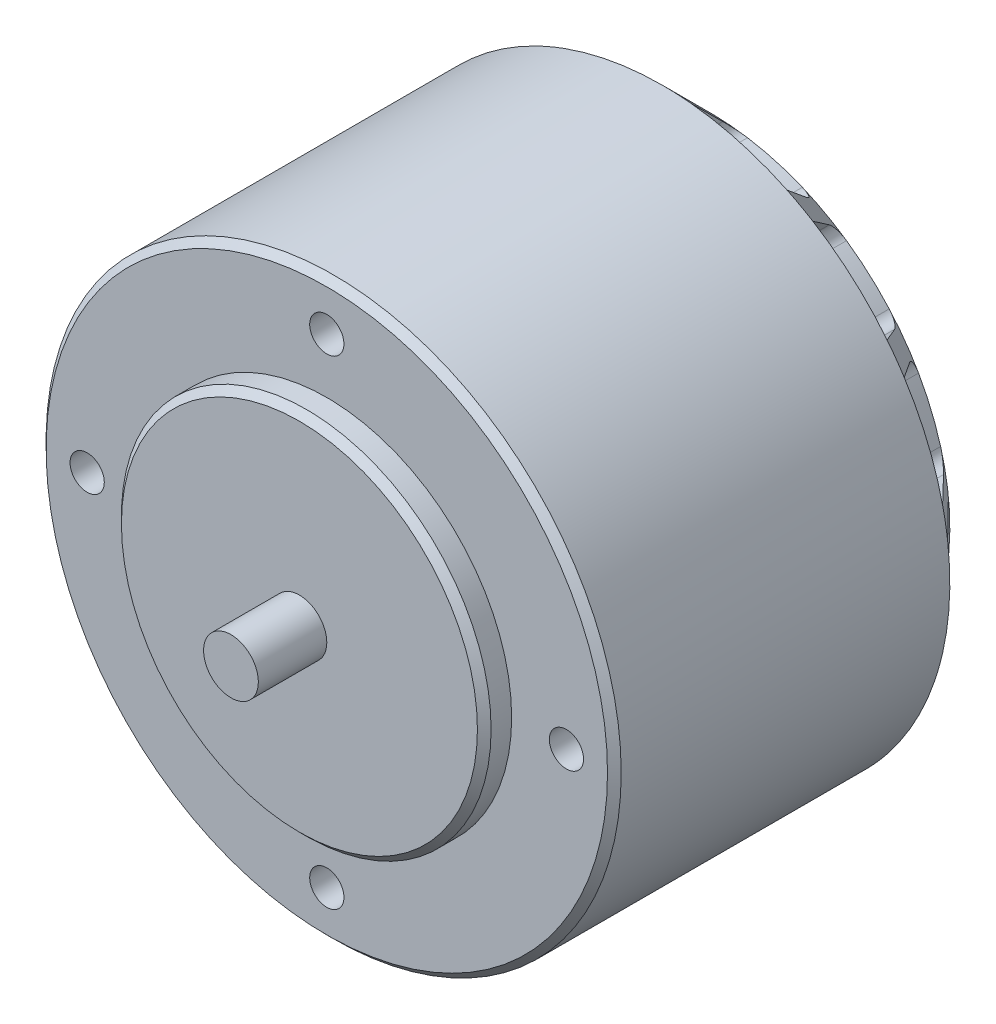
ISO-10303-21;
HEADER;
FILE_DESCRIPTION(('STEP AP214'),'2;1');
FILE_NAME('part.step','',(''),(''),'','','');
FILE_SCHEMA(('AUTOMOTIVE_DESIGN { 1 0 10303 214 1 1 1 1 }'));
ENDSEC;
DATA;
#1=APPLICATION_CONTEXT('core data for automotive mechanical design processes');
#2=APPLICATION_PROTOCOL_DEFINITION('international standard','automotive_design',2000,#1);
#3=PRODUCT_CONTEXT('',#1,'mechanical');
#4=PRODUCT('Part','Part','',(#3));
#5=PRODUCT_RELATED_PRODUCT_CATEGORY('part','',(#4));
#6=PRODUCT_DEFINITION_FORMATION('','',#4);
#7=PRODUCT_DEFINITION_CONTEXT('part definition',#1,'design');
#8=PRODUCT_DEFINITION('design','',#6,#7);
#9=PRODUCT_DEFINITION_SHAPE('','',#8);
#10=(LENGTH_UNIT() NAMED_UNIT(*) SI_UNIT(.MILLI.,.METRE.));
#11=(NAMED_UNIT(*) PLANE_ANGLE_UNIT() SI_UNIT($,.RADIAN.));
#12=(NAMED_UNIT(*) SI_UNIT($,.STERADIAN.) SOLID_ANGLE_UNIT());
#13=UNCERTAINTY_MEASURE_WITH_UNIT(LENGTH_MEASURE(1.E-05),#10,'distance_accuracy_value','');
#14=(GEOMETRIC_REPRESENTATION_CONTEXT(3) GLOBAL_UNCERTAINTY_ASSIGNED_CONTEXT((#13)) GLOBAL_UNIT_ASSIGNED_CONTEXT((#10,
#11,#12)) REPRESENTATION_CONTEXT('',''));
#15=CARTESIAN_POINT('',(0.,0.,0.));
#16=DIRECTION('',(0.,0.,1.));
#17=DIRECTION('',(1.,0.,0.));
#18=AXIS2_PLACEMENT_3D('',#15,#16,#17);
#19=CARTESIAN_POINT('',(0.,0.,30.));
#20=DIRECTION('',(0.,0.,-1.));
#21=DIRECTION('',(-1.,0.,0.));
#22=AXIS2_PLACEMENT_3D('',#19,#20,#21);
#23=CYLINDRICAL_SURFACE('',#22,21.);
#24=CARTESIAN_POINT('',(0.,0.,27.5));
#25=DIRECTION('',(0.,0.,1.));
#26=DIRECTION('',(1.,0.,0.));
#27=AXIS2_PLACEMENT_3D('',#24,#25,#26);
#28=CIRCLE('',#27,21.);
#29=CARTESIAN_POINT('',(21.,0.,27.5));
#30=VERTEX_POINT('',#29);
#31=EDGE_CURVE('E1483',#30,#30,#28,.F.);
#32=ORIENTED_EDGE('',*,*,#31,.T.);
#33=EDGE_LOOP('',(#32));
#34=FACE_BOUND('',#33,.T.);
#35=CARTESIAN_POINT('',(0.,0.,3.50000000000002));
#36=DIRECTION('',(0.,0.,1.));
#37=DIRECTION('',(1.,0.,0.));
#38=AXIS2_PLACEMENT_3D('',#35,#36,#37);
#39=CIRCLE('',#38,21.);
#40=CARTESIAN_POINT('',(0.,21.,3.5));
#41=VERTEX_POINT('',#40);
#42=CARTESIAN_POINT('',(-7.13253373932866,19.7516318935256,3.5));
#43=VERTEX_POINT('',#42);
#44=EDGE_CURVE('E975',#41,#43,#39,.T.);
#45=ORIENTED_EDGE('',*,*,#44,.T.);
#46=CARTESIAN_POINT('',(-9.11155852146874,18.9203462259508,3.5));
#47=VERTEX_POINT('',#46);
#48=EDGE_CURVE('E979',#43,#47,#39,.T.);
#49=ORIENTED_EDGE('',*,*,#48,.T.);
#50=CARTESIAN_POINT('',(0.,0.,3.5));
#51=DIRECTION('',(0.,0.,-1.));
#52=DIRECTION('',(-1.,0.,0.));
#53=AXIS2_PLACEMENT_3D('',#50,#51,#52);
#54=CIRCLE('',#53,21.);
#55=CARTESIAN_POINT('',(-14.9961027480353,14.700915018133,3.5));
#56=VERTEX_POINT('',#55);
#57=EDGE_CURVE('E930',#56,#47,#54,.T.);
#58=ORIENTED_EDGE('',*,*,#57,.F.);
#59=CARTESIAN_POINT('',(-16.4184611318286,13.0932858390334,3.5));
#60=VERTEX_POINT('',#59);
#61=EDGE_CURVE('E1735',#56,#60,#39,.T.);
#62=ORIENTED_EDGE('',*,*,#61,.T.);
#63=CARTESIAN_POINT('',(0.,0.,3.5));
#64=DIRECTION('',(0.,0.,-1.));
#65=DIRECTION('',(-1.,0.,0.));
#66=AXIS2_PLACEMENT_3D('',#63,#64,#65);
#67=CIRCLE('',#66,21.);
#68=CARTESIAN_POINT('',(-19.8895096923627,6.73850162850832,3.5));
#69=VERTEX_POINT('',#68);
#70=EDGE_CURVE('E899',#69,#60,#67,.T.);
#71=ORIENTED_EDGE('',*,*,#70,.F.);
#72=CARTESIAN_POINT('',(-20.4734861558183,4.67293961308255,3.5));
#73=VERTEX_POINT('',#72);
#74=EDGE_CURVE('E1736',#69,#73,#39,.T.);
#75=ORIENTED_EDGE('',*,*,#74,.T.);
#76=CARTESIAN_POINT('',(0.,0.,3.5));
#77=DIRECTION('',(0.,0.,-1.));
#78=DIRECTION('',(-1.,0.,0.));
#79=AXIS2_PLACEMENT_3D('',#76,#77,#78);
#80=CIRCLE('',#79,21.);
#81=CARTESIAN_POINT('',(-20.8435553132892,-2.55855465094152,3.5));
#82=VERTEX_POINT('',#81);
#83=EDGE_CURVE('E868',#82,#73,#80,.T.);
#84=ORIENTED_EDGE('',*,*,#83,.F.);
#85=CARTESIAN_POINT('',(-20.4734861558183,-4.67293961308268,3.5));
#86=VERTEX_POINT('',#85);
#87=EDGE_CURVE('E1739',#82,#86,#39,.T.);
#88=ORIENTED_EDGE('',*,*,#87,.T.);
#89=CARTESIAN_POINT('',(0.,0.,3.5));
#90=DIRECTION('',(0.,0.,-1.));
#91=DIRECTION('',(-1.,0.,0.));
#92=AXIS2_PLACEMENT_3D('',#89,#90,#91);
#93=CIRCLE('',#92,21.);
#94=CARTESIAN_POINT('',(-17.6692791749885,-11.3488578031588,3.5));
#95=VERTEX_POINT('',#94);
#96=EDGE_CURVE('E837',#95,#86,#93,.T.);
#97=ORIENTED_EDGE('',*,*,#96,.F.);
#98=CARTESIAN_POINT('',(-16.4184611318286,-13.0932858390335,3.5));
#99=VERTEX_POINT('',#98);
#100=EDGE_CURVE('E1742',#95,#99,#39,.T.);
#101=ORIENTED_EDGE('',*,*,#100,.T.);
#102=CARTESIAN_POINT('',(0.,0.,3.5));
#103=DIRECTION('',(0.,0.,-1.));
#104=DIRECTION('',(-1.,0.,0.));
#105=AXIS2_PLACEMENT_3D('',#102,#103,#104);
#106=CIRCLE('',#105,21.);
#107=CARTESIAN_POINT('',(-10.9953855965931,-17.8913804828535,3.5));
#108=VERTEX_POINT('',#107);
#109=EDGE_CURVE('E806',#108,#99,#106,.T.);
#110=ORIENTED_EDGE('',*,*,#109,.F.);
#111=CARTESIAN_POINT('',(-9.1115585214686,-18.9203462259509,3.5));
#112=VERTEX_POINT('',#111);
#113=EDGE_CURVE('E1745',#108,#112,#39,.T.);
#114=ORIENTED_EDGE('',*,*,#113,.T.);
#115=CARTESIAN_POINT('',(0.,0.,3.5));
#116=DIRECTION('',(0.,0.,-1.));
#117=DIRECTION('',(-1.,0.,0.));
#118=AXIS2_PLACEMENT_3D('',#115,#116,#117);
#119=CIRCLE('',#118,21.);
#120=CARTESIAN_POINT('',(-2.14372105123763,-20.8902958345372,3.5));
#121=VERTEX_POINT('',#120);
#122=EDGE_CURVE('E775',#121,#112,#119,.T.);
#123=ORIENTED_EDGE('',*,*,#122,.F.);
#124=CARTESIAN_POINT('',(1.53071611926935E-13,-21.,3.5));
#125=VERTEX_POINT('',#124);
#126=EDGE_CURVE('E1748',#121,#125,#39,.T.);
#127=ORIENTED_EDGE('',*,*,#126,.T.);
#128=CARTESIAN_POINT('',(0.,0.,3.5));
#129=DIRECTION('',(0.,0.,-1.));
#130=DIRECTION('',(-1.,0.,0.));
#131=AXIS2_PLACEMENT_3D('',#128,#129,#130);
#132=CIRCLE('',#131,21.);
#133=CARTESIAN_POINT('',(7.1325337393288,-19.7516318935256,3.5));
#134=VERTEX_POINT('',#133);
#135=EDGE_CURVE('E744',#134,#125,#132,.T.);
#136=ORIENTED_EDGE('',*,*,#135,.F.);
#137=CARTESIAN_POINT('',(9.11155852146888,-18.9203462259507,3.5));
#138=VERTEX_POINT('',#137);
#139=EDGE_CURVE('E1751',#134,#138,#39,.T.);
#140=ORIENTED_EDGE('',*,*,#139,.T.);
#141=CARTESIAN_POINT('',(0.,0.,3.5));
#142=DIRECTION('',(0.,0.,-1.));
#143=DIRECTION('',(-1.,0.,0.));
#144=AXIS2_PLACEMENT_3D('',#141,#142,#143);
#145=CIRCLE('',#144,21.);
#146=CARTESIAN_POINT('',(14.9961027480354,-14.7009150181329,3.5));
#147=VERTEX_POINT('',#146);
#148=EDGE_CURVE('E713',#147,#138,#145,.T.);
#149=ORIENTED_EDGE('',*,*,#148,.F.);
#150=CARTESIAN_POINT('',(16.4184611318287,-13.0932858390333,3.5));
#151=VERTEX_POINT('',#150);
#152=EDGE_CURVE('E1754',#147,#151,#39,.T.);
#153=ORIENTED_EDGE('',*,*,#152,.T.);
#154=CARTESIAN_POINT('',(0.,0.,3.5));
#155=DIRECTION('',(0.,0.,-1.));
#156=DIRECTION('',(-1.,0.,0.));
#157=AXIS2_PLACEMENT_3D('',#154,#155,#156);
#158=CIRCLE('',#157,21.);
#159=CARTESIAN_POINT('',(19.8895096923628,-6.73850162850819,3.5));
#160=VERTEX_POINT('',#159);
#161=EDGE_CURVE('E682',#160,#151,#158,.T.);
#162=ORIENTED_EDGE('',*,*,#161,.F.);
#163=CARTESIAN_POINT('',(20.4734861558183,-4.6729396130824,3.5));
#164=VERTEX_POINT('',#163);
#165=EDGE_CURVE('E1757',#160,#164,#39,.T.);
#166=ORIENTED_EDGE('',*,*,#165,.T.);
#167=CARTESIAN_POINT('',(0.,0.,3.5));
#168=DIRECTION('',(0.,0.,-1.));
#169=DIRECTION('',(-1.,0.,0.));
#170=AXIS2_PLACEMENT_3D('',#167,#168,#169);
#171=CIRCLE('',#170,21.);
#172=CARTESIAN_POINT('',(20.8435553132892,2.55855465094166,3.5));
#173=VERTEX_POINT('',#172);
#174=EDGE_CURVE('E651',#173,#164,#171,.T.);
#175=ORIENTED_EDGE('',*,*,#174,.F.);
#176=CARTESIAN_POINT('',(20.4734861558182,4.67293961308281,3.5));
#177=VERTEX_POINT('',#176);
#178=EDGE_CURVE('E1760',#173,#177,#39,.T.);
#179=ORIENTED_EDGE('',*,*,#178,.T.);
#180=CARTESIAN_POINT('',(0.,0.,3.5));
#181=DIRECTION('',(0.,0.,-1.));
#182=DIRECTION('',(-1.,0.,0.));
#183=AXIS2_PLACEMENT_3D('',#180,#181,#182);
#184=CIRCLE('',#183,21.);
#185=CARTESIAN_POINT('',(17.6692791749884,11.3488578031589,3.5));
#186=VERTEX_POINT('',#185);
#187=EDGE_CURVE('E620',#186,#177,#184,.T.);
#188=ORIENTED_EDGE('',*,*,#187,.F.);
#189=CARTESIAN_POINT('',(16.4184611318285,13.0932858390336,3.5));
#190=VERTEX_POINT('',#189);
#191=EDGE_CURVE('E1592',#186,#190,#39,.T.);
#192=ORIENTED_EDGE('',*,*,#191,.T.);
#193=CARTESIAN_POINT('',(0.,0.,3.5));
#194=DIRECTION('',(0.,0.,-1.));
#195=DIRECTION('',(-1.,0.,0.));
#196=AXIS2_PLACEMENT_3D('',#193,#194,#195);
#197=CIRCLE('',#196,21.);
#198=CARTESIAN_POINT('',(10.995385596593,17.8913804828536,3.5));
#199=VERTEX_POINT('',#198);
#200=EDGE_CURVE('E591',#199,#190,#197,.T.);
#201=ORIENTED_EDGE('',*,*,#200,.F.);
#202=CARTESIAN_POINT('',(9.11155852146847,18.9203462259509,3.5));
#203=VERTEX_POINT('',#202);
#204=EDGE_CURVE('E1762',#199,#203,#39,.T.);
#205=ORIENTED_EDGE('',*,*,#204,.T.);
#206=CARTESIAN_POINT('',(0.,0.,3.5));
#207=DIRECTION('',(0.,0.,-1.));
#208=DIRECTION('',(-1.,0.,0.));
#209=AXIS2_PLACEMENT_3D('',#206,#207,#208);
#210=CIRCLE('',#209,21.);
#211=CARTESIAN_POINT('',(2.14372105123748,20.8902958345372,3.5));
#212=VERTEX_POINT('',#211);
#213=EDGE_CURVE('E563',#212,#203,#210,.T.);
#214=ORIENTED_EDGE('',*,*,#213,.F.);
#215=EDGE_CURVE('E967',#212,#41,#39,.T.);
#216=ORIENTED_EDGE('',*,*,#215,.T.);
#217=EDGE_LOOP('',(#45,#49,#58,#62,#71,#75,#84,#88,#97,#101,#110,#114,#123,#127,#136,#140,#149,
#153,#162,#166,#175,#179,#188,#192,#201,#205,#214,#216));
#218=FACE_BOUND('',#217,.T.);
#219=ADVANCED_FACE('F39',(#34,#218),#23,.T.);
#220=CARTESIAN_POINT('',(0.,0.,3.50000000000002));
#221=DIRECTION('',(0.,0.,1.));
#222=DIRECTION('',(1.,0.,0.));
#223=AXIS2_PLACEMENT_3D('',#220,#221,#222);
#224=CONICAL_SURFACE('',#223,21.,0.78539816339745);
#225=CARTESIAN_POINT('',(8.01521029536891,16.6437557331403,0.97317517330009));
#226=CARTESIAN_POINT('',(7.9986191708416,16.6093099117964,0.934943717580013));
#227=CARTESIAN_POINT('',(7.98007026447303,16.5758029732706,0.896705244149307));
#228=CARTESIAN_POINT('',(7.93906919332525,16.5108863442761,0.820429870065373));
#229=CARTESIAN_POINT('',(7.9166112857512,16.4794798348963,0.782393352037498));
#230=CARTESIAN_POINT('',(7.86760315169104,16.4187765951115,0.706463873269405));
#231=CARTESIAN_POINT('',(7.84101320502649,16.3895048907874,0.668576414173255));
#232=CARTESIAN_POINT('',(7.7839247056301,16.3338100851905,0.593718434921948));
#233=CARTESIAN_POINT('',(7.7534289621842,16.3073849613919,0.5567472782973));
#234=CARTESIAN_POINT('',(7.67677905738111,16.2488659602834,0.471030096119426));
#235=CARTESIAN_POINT('',(7.62893607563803,16.2181474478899,0.422827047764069));
#236=CARTESIAN_POINT('',(7.5259164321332,16.164308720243,0.330396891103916));
#237=CARTESIAN_POINT('',(7.47076603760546,16.1411622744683,0.286156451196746));
#238=CARTESIAN_POINT('',(7.368738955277,16.1093316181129,0.214619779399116));
#239=CARTESIAN_POINT('',(7.32353120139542,16.0984415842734,0.185936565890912));
#240=CARTESIAN_POINT('',(7.22948232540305,16.0829747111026,0.133091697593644));
#241=CARTESIAN_POINT('',(7.18064494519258,16.0783914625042,0.108925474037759));
#242=CARTESIAN_POINT('',(7.09057258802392,16.0769217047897,0.0710649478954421));
#243=CARTESIAN_POINT('',(7.04983953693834,16.0786462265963,0.0562391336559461));
#244=CARTESIAN_POINT('',(6.96752218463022,16.087386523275,0.0313668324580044));
#245=CARTESIAN_POINT('',(6.92594002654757,16.0943902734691,0.0213095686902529));
#246=CARTESIAN_POINT('',(6.85833465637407,16.1103368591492,0.00939757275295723));
#247=CARTESIAN_POINT('',(6.83219937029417,16.1176259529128,0.00588725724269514));
#248=CARTESIAN_POINT('',(6.78036755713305,16.1343907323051,0.00117715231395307));
#249=CARTESIAN_POINT('',(6.75467206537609,16.1438709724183,-1.77751419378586E-05));
#250=CARTESIAN_POINT('',(6.72939675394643,16.1544179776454,2.48142258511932E-08));
#251=B_SPLINE_CURVE_WITH_KNOTS('',3,(#225,#226,#227,#228,#229,#230,#231,#232,#233,#234,#235,
#236,#237,#238,#239,#240,#241,#242,#243,#244,#245,#246,#247,#248,#249,#250),.UNSPECIFIED.,.F.,
.F.,(4,2,2,2,2,2,2,2,2,2,2,2,4),(0.,0.162173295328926,0.324586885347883,0.488671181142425,
0.652638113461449,0.875527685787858,1.09763675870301,1.26100867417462,1.42421444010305,
1.55385781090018,1.68320677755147,1.76510716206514,1.84717933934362),.UNSPECIFIED.);
#252=CARTESIAN_POINT('',(8.01511400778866,16.6435557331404,0.97295320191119));
#253=VERTEX_POINT('',#252);
#254=CARTESIAN_POINT('',(6.72959675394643,16.1543346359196,0.));
#255=VERTEX_POINT('',#254);
#256=EDGE_CURVE('E1471',#253,#255,#251,.T.);
#257=ORIENTED_EDGE('',*,*,#256,.F.);
#258=DIRECTION('',(0.306802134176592,0.637081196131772,0.707106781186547));
#259=VECTOR('',#258,1.);
#260=CARTESIAN_POINT('',(0.,0.,-17.4999999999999));
#261=LINE('',#260,#259);
#262=EDGE_CURVE('E1477',#203,#253,#261,.F.);
#263=ORIENTED_EDGE('',*,*,#262,.F.);
#264=ORIENTED_EDGE('',*,*,#204,.F.);
#265=DIRECTION('',(-0.370233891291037,-0.602434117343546,-0.707106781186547));
#266=VECTOR('',#265,1.);
#267=CARTESIAN_POINT('',(0.,0.,-17.4999999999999));
#268=LINE('',#267,#266);
#269=CARTESIAN_POINT('',(9.67224969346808,15.7384111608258,0.972953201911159));
#270=VERTEX_POINT('',#269);
#271=EDGE_CURVE('E1417',#270,#199,#268,.F.);
#272=ORIENTED_EDGE('',*,*,#271,.F.);
#273=CARTESIAN_POINT('',(9.95554342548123,14.3922602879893,3.12536177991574E-08));
#274=CARTESIAN_POINT('',(9.93733897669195,14.4048419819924,-9.25050994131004E-06));
#275=CARTESIAN_POINT('',(9.9195677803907,14.4180258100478,0.000765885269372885));
#276=CARTESIAN_POINT('',(9.88503054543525,14.4454569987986,0.00384459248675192));
#277=CARTESIAN_POINT('',(9.86826363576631,14.4597034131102,0.00614681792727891));
#278=CARTESIAN_POINT('',(9.81995703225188,14.5035637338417,0.0152242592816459));
#279=CARTESIAN_POINT('',(9.79003970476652,14.5345577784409,0.0241719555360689));
#280=CARTESIAN_POINT('',(9.73533630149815,14.5988307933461,0.0471074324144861));
#281=CARTESIAN_POINT('',(9.71053436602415,14.6321022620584,0.0610792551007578));
#282=CARTESIAN_POINT('',(9.6659304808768,14.7000443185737,0.0931838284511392));
#283=CARTESIAN_POINT('',(9.64614110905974,14.7347181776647,0.111326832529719));
#284=CARTESIAN_POINT('',(9.60373303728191,14.8200207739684,0.159624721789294));
#285=CARTESIAN_POINT('',(9.58371784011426,14.870939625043,0.191547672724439));
#286=CARTESIAN_POINT('',(9.55261706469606,14.9723135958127,0.260096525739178));
#287=CARTESIAN_POINT('',(9.54154923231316,15.0227675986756,0.296731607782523));
#288=CARTESIAN_POINT('',(9.52431562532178,15.142645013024,0.388827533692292));
#289=CARTESIAN_POINT('',(9.52199678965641,15.2114019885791,0.445867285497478));
#290=CARTESIAN_POINT('',(9.53045614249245,15.3448665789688,0.563596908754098));
#291=CARTESIAN_POINT('',(9.54125677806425,15.4095670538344,0.624292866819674));
#292=CARTESIAN_POINT('',(9.5704969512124,15.5195432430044,0.733223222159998));
#293=CARTESIAN_POINT('',(9.58658296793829,15.5658430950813,0.781081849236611));
#294=CARTESIAN_POINT('',(9.62496096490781,15.6548822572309,0.877029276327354));
#295=CARTESIAN_POINT('',(9.64721418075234,15.6976417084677,0.925114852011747));
#296=CARTESIAN_POINT('',(9.67237263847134,15.7386111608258,0.97318796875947));
#297=B_SPLINE_CURVE_WITH_KNOTS('',3,(#273,#274,#275,#276,#277,#278,#279,#280,#281,#282,#283,
#284,#285,#286,#287,#288,#289,#290,#291,#292,#293,#294,#295,#296),.UNSPECIFIED.,.F.,.F.,(4,2,2,
2,2,2,2,2,2,2,2,4),(0.,0.0663348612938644,0.132611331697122,0.263826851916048,0.394629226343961,
0.52575663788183,0.71473436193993,0.904085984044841,1.17075425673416,1.43787943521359,
1.64303237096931,1.8469239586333),.UNSPECIFIED.);
#298=CARTESIAN_POINT('',(9.95534342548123,14.3923985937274,0.));
#299=VERTEX_POINT('',#298);
#300=EDGE_CURVE('E1410',#299,#270,#297,.T.);
#301=ORIENTED_EDGE('',*,*,#300,.F.);
#302=CARTESIAN_POINT('',(0.,0.,0.));
#303=DIRECTION('',(0.,0.,1.));
#304=DIRECTION('',(1.,0.,0.));
#305=AXIS2_PLACEMENT_3D('',#302,#303,#304);
#306=CIRCLE('',#305,17.5);
#307=EDGE_CURVE('E985',#255,#299,#306,.F.);
#308=ORIENTED_EDGE('',*,*,#307,.F.);
#309=EDGE_LOOP('',(#257,#263,#264,#272,#301,#308));
#310=FACE_BOUND('',#309,.T.);
#311=ADVANCED_FACE('F1503',(#310),#224,.T.);
#312=CARTESIAN_POINT('',(14.4429363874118,11.5178574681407,0.973209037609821));
#313=CARTESIAN_POINT('',(14.4130433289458,11.4940202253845,0.934977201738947));
#314=CARTESIAN_POINT('',(14.3817936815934,11.4718783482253,0.896738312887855));
#315=CARTESIAN_POINT('',(14.316687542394,11.4311777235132,0.820462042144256));
#316=CARTESIAN_POINT('',(14.2828272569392,11.4126243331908,0.782425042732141));
#317=CARTESIAN_POINT('',(14.2123349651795,11.3791939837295,0.706494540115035));
#318=CARTESIAN_POINT('',(14.175678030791,11.3643568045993,0.668606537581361));
#319=CARTESIAN_POINT('',(14.1000785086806,11.3389448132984,0.593747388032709));
#320=CARTESIAN_POINT('',(14.0611375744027,11.3283669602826,0.556775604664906));
#321=CARTESIAN_POINT('',(13.9666871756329,11.3088970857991,0.47105575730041));
#322=CARTESIAN_POINT('',(13.910252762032,11.3019771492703,0.422850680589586));
#323=CARTESIAN_POINT('',(13.7940729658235,11.2981654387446,0.330416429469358));
#324=CARTESIAN_POINT('',(13.7343398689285,11.301238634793,0.286173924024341));
#325=CARTESIAN_POINT('',(13.6286035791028,11.3168259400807,0.214634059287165));
#326=CARTESIAN_POINT('',(13.5831470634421,11.3266283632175,0.185949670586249));
#327=CARTESIAN_POINT('',(13.4916995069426,11.3534978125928,0.13310241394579));
#328=CARTESIAN_POINT('',(13.4457090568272,11.3705574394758,0.108934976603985));
#329=CARTESIAN_POINT('',(13.3639174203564,11.4083129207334,0.0710723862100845));
#330=CARTESIAN_POINT('',(13.3279658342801,11.4275395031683,0.0562456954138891));
#331=CARTESIAN_POINT('',(13.2575913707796,11.4711294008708,0.0313716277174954));
#332=CARTESIAN_POINT('',(13.2231652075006,11.4954809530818,0.0213134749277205));
#333=CARTESIAN_POINT('',(13.169164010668,11.5391875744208,0.009398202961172));
#334=CARTESIAN_POINT('',(13.1487709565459,11.5571020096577,0.00588638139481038));
#335=CARTESIAN_POINT('',(13.1093300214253,11.5947120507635,0.00117520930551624));
#336=CARTESIAN_POINT('',(13.0902850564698,11.6144113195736,-1.92675145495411E-05));
#337=CARTESIAN_POINT('',(13.0720823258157,11.6348899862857,3.78821712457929E-08));
#338=B_SPLINE_CURVE_WITH_KNOTS('',3,(#312,#313,#314,#315,#316,#317,#318,#319,#320,#321,#322,
#323,#324,#325,#326,#327,#328,#329,#330,#331,#332,#333,#334,#335,#336,#337),.UNSPECIFIED.,.F.,
.F.,(4,2,2,2,2,2,2,2,2,2,2,2,4),(0.,0.162174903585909,0.324590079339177,0.488675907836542,
0.652644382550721,0.875540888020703,1.09765689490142,1.26103198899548,1.42424090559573,
1.55388594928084,1.68323660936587,1.76517130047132,1.84727812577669),.UNSPECIFIED.);
#339=CARTESIAN_POINT('',(14.4427363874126,11.5176979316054,0.97295320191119));
#340=VERTEX_POINT('',#339);
#341=CARTESIAN_POINT('',(13.072260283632,11.6346899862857,0.));
#342=VERTEX_POINT('',#341);
#343=EDGE_CURVE('E1438',#340,#342,#338,.T.);
#344=ORIENTED_EDGE('',*,*,#343,.F.);
#345=DIRECTION('',(0.552838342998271,0.440873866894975,0.707106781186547));
#346=VECTOR('',#345,1.);
#347=CARTESIAN_POINT('',(0.,0.,-17.4999999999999));
#348=LINE('',#347,#346);
#349=EDGE_CURVE('E1444',#190,#340,#348,.F.);
#350=ORIENTED_EDGE('',*,*,#349,.F.);
#351=ORIENTED_EDGE('',*,*,#191,.F.);
#352=DIRECTION('',(-0.594955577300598,-0.382135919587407,-0.707106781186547));
#353=VECTOR('',#352,1.);
#354=CARTESIAN_POINT('',(0.,0.,-17.4999999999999));
#355=LINE('',#354,#353);
#356=CARTESIAN_POINT('',(15.5430365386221,9.98318662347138,0.972953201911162));
#357=VERTEX_POINT('',#356);
#358=EDGE_CURVE('E1382',#357,#186,#355,.F.);
#359=ORIENTED_EDGE('',*,*,#358,.F.);
#360=CARTESIAN_POINT('',(15.2141959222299,8.64744143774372,2.7977247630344E-08));
#361=CARTESIAN_POINT('',(15.2032534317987,8.66667607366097,-8.94751752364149E-06));
#362=CARTESIAN_POINT('',(15.1929625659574,8.68626522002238,0.000766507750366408));
#363=CARTESIAN_POINT('',(15.1737479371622,8.72596556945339,0.00384587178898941));
#364=CARTESIAN_POINT('',(15.1648229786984,8.74607629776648,0.00614843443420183));
#365=CARTESIAN_POINT('',(15.1403312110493,8.80655325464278,0.0152268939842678));
#366=CARTESIAN_POINT('',(15.1268249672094,8.84745897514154,0.0241752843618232));
#367=CARTESIAN_POINT('',(15.1054270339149,8.92910254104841,0.0471121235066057));
#368=CARTESIAN_POINT('',(15.0975177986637,8.96984050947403,0.0610846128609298));
#369=CARTESIAN_POINT('',(15.0868112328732,9.05040748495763,0.0931904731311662));
#370=CARTESIAN_POINT('',(15.0840266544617,9.0902339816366,0.111334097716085));
#371=CARTESIAN_POINT('',(15.0828311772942,9.18548997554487,0.159633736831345));
#372=CARTESIAN_POINT('',(15.0868919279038,9.24005115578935,0.191557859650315));
#373=CARTESIAN_POINT('',(15.1028576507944,9.34488107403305,0.260109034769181));
#374=CARTESIAN_POINT('',(15.1147781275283,9.39514110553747,0.296745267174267));
#375=CARTESIAN_POINT('',(15.1512667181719,9.51062494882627,0.388843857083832));
#376=CARTESIAN_POINT('',(15.1790116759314,9.5735791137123,0.445885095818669));
#377=CARTESIAN_POINT('',(15.2445447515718,9.69015616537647,0.563617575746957));
#378=CARTESIAN_POINT('',(15.2823499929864,9.74376288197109,0.624314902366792));
#379=CARTESIAN_POINT('',(15.356411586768,9.83015716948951,0.733243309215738));
#380=CARTESIAN_POINT('',(15.3909913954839,9.86488918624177,0.781098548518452));
#381=CARTESIAN_POINT('',(15.4641968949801,9.92845346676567,0.877039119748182));
#382=CARTESIAN_POINT('',(15.5027964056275,9.95732068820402,0.925121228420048));
#383=CARTESIAN_POINT('',(15.5432365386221,9.98331504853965,0.97319088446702));
#384=B_SPLINE_CURVE_WITH_KNOTS('',3,(#360,#361,#362,#363,#364,#365,#366,#367,#368,#369,#370,
#371,#372,#373,#374,#375,#376,#377,#378,#379,#380,#381,#382,#383),.UNSPECIFIED.,.F.,.F.,(4,2,2,
2,2,2,2,2,2,2,2,4),(0.,0.0663354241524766,0.132612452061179,0.263829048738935,0.394632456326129,
0.52576091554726,0.714742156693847,0.904097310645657,1.17077027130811,1.43790006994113,
1.64303810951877,1.84691500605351),.UNSPECIFIED.);
#385=CARTESIAN_POINT('',(15.2140822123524,8.64764143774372,0.));
#386=VERTEX_POINT('',#385);
#387=EDGE_CURVE('E1375',#386,#357,#384,.T.);
#388=ORIENTED_EDGE('',*,*,#387,.F.);
#389=EDGE_CURVE('E1550',#342,#386,#306,.F.);
#390=ORIENTED_EDGE('',*,*,#389,.F.);
#391=EDGE_LOOP('',(#344,#350,#351,#359,#388,#390));
#392=FACE_BOUND('',#391,.T.);
#393=ADVANCED_FACE('F1508',(#392),#224,.T.);
#394=CARTESIAN_POINT('',(18.0099976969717,4.11066446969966,0.973158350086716));
#395=CARTESIAN_POINT('',(17.972722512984,4.10215998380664,0.934927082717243));
#396=CARTESIAN_POINT('',(17.934960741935,4.09577152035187,0.896688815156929));
#397=CARTESIAN_POINT('',(17.858643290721,4.08735387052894,0.820413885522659));
#398=CARTESIAN_POINT('',(17.8200865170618,4.08533115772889,0.782377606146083));
#399=CARTESIAN_POINT('',(17.7420709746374,4.08580064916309,0.706448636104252));
#400=CARTESIAN_POINT('',(17.7026070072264,4.08833951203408,0.668561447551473));
#401=CARTESIAN_POINT('',(17.6234692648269,4.09824917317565,0.593704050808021));
#402=CARTESIAN_POINT('',(17.5837956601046,4.10561651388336,0.556733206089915));
#403=CARTESIAN_POINT('',(17.4902542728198,4.12905909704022,0.471017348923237));
#404=CARTESIAN_POINT('',(17.4364088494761,4.14731213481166,0.422815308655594));
#405=CARTESIAN_POINT('',(17.3300861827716,4.19428913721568,0.330387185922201));
#406=CARTESIAN_POINT('',(17.277604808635,4.22297621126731,0.286147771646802));
#407=CARTESIAN_POINT('',(17.1891072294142,4.28289858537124,0.214612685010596));
#408=CARTESIAN_POINT('',(17.1524070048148,4.3114538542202,0.185930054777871));
#409=CARTESIAN_POINT('',(17.0816770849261,4.37534118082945,0.133086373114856));
#410=CARTESIAN_POINT('',(17.0476447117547,4.41066631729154,0.10892075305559));
#411=CARTESIAN_POINT('',(16.9903373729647,4.48017156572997,0.0710612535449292));
#412=CARTESIAN_POINT('',(16.9662894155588,4.51309328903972,0.0562358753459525));
#413=CARTESIAN_POINT('',(16.9217996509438,4.58290122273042,0.0313644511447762));
#414=CARTESIAN_POINT('',(16.9013497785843,4.6197782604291,0.0213076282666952));
#415=CARTESIAN_POINT('',(16.8716679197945,4.68257430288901,0.00939679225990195));
#416=CARTESIAN_POINT('',(16.86107292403,4.70754975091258,0.00588698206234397));
#417=CARTESIAN_POINT('',(16.8418656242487,4.75852069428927,0.00117739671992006));
#418=CARTESIAN_POINT('',(16.8332575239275,4.78451821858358,-1.75195351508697E-05));
#419=CARTESIAN_POINT('',(16.8257451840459,4.81085229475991,2.28697952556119E-08));
#420=B_SPLINE_CURVE_WITH_KNOTS('',3,(#394,#395,#396,#397,#398,#399,#400,#401,#402,#403,#404,
#405,#406,#407,#408,#409,#410,#411,#412,#413,#414,#415,#416,#417,#418,#419),.UNSPECIFIED.,.F.,
.F.,(4,2,2,2,2,2,2,2,2,2,2,2,4),(0.,0.162172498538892,0.324585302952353,0.488668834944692,
0.652634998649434,0.875521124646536,1.097626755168,1.26099709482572,1.42420129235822,
1.55384382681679,1.68319195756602,1.76508359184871,1.84714692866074),.UNSPECIFIED.);
#421=CARTESIAN_POINT('',(18.0097976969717,4.11061879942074,0.97295320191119));
#422=VERTEX_POINT('',#421);
#423=CARTESIAN_POINT('',(16.8258023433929,4.81065229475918,0.));
#424=VERTEX_POINT('',#423);
#425=EDGE_CURVE('E1404',#422,#424,#420,.T.);
#426=ORIENTED_EDGE('',*,*,#425,.F.);
#427=DIRECTION('',(0.68937813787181,0.157346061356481,0.707106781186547));
#428=VECTOR('',#427,1.);
#429=CARTESIAN_POINT('',(0.,0.,-17.4999999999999));
#430=LINE('',#429,#428);
#431=EDGE_CURVE('E1411',#177,#422,#430,.F.);
#432=ORIENTED_EDGE('',*,*,#431,.F.);
#433=ORIENTED_EDGE('',*,*,#178,.F.);
#434=DIRECTION('',(-0.701839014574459,-0.0861510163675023,-0.707106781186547));
#435=VECTOR('',#434,1.);
#436=CARTESIAN_POINT('',(0.,-4.50681208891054E-13,-17.4999999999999));
#437=LINE('',#436,#435);
#438=CARTESIAN_POINT('',(18.3353343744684,2.25066953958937,0.972953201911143));
#439=VERTEX_POINT('',#438);
#440=EDGE_CURVE('E1347',#439,#173,#437,.F.);
#441=ORIENTED_EDGE('',*,*,#440,.F.);
#442=CARTESIAN_POINT('',(17.4594990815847,1.18991283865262,2.12414044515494E-08));
#443=CARTESIAN_POINT('',(17.4579864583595,1.21199088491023,-8.26213219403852E-06));
#444=CARTESIAN_POINT('',(17.4572147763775,1.23410555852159,0.000767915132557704));
#445=CARTESIAN_POINT('',(17.4571296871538,1.2782119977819,0.00384876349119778));
#446=CARTESIAN_POINT('',(17.4578149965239,1.30020385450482,0.0061520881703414));
#447=CARTESIAN_POINT('',(17.4619907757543,1.36531907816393,0.0152328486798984));
#448=CARTESIAN_POINT('',(17.4675718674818,1.40803431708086,0.0241828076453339));
#449=CARTESIAN_POINT('',(17.4837197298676,1.49087710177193,0.0471227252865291));
#450=CARTESIAN_POINT('',(17.4942707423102,1.53101237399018,0.061096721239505));
#451=CARTESIAN_POINT('',(17.5195839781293,1.60824575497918,0.0932054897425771));
#452=CARTESIAN_POINT('',(17.5343566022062,1.64533606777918,0.111350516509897));
#453=CARTESIAN_POINT('',(17.574613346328,1.73167771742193,0.159654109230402));
#454=CARTESIAN_POINT('',(17.6019477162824,1.77907405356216,0.191580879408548));
#455=CARTESIAN_POINT('',(17.6618214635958,1.86659533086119,0.260137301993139));
#456=CARTESIAN_POINT('',(17.6943710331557,1.90670569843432,0.296776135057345));
#457=CARTESIAN_POINT('',(17.7773587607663,1.99491993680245,0.388880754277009));
#458=CARTESIAN_POINT('',(17.8296743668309,2.03960034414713,0.445925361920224));
#459=CARTESIAN_POINT('',(17.9393053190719,2.11619559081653,0.563664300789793));
#460=CARTESIAN_POINT('',(17.9966290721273,2.14808844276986,0.624364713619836));
#461=CARTESIAN_POINT('',(18.1008311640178,2.19378157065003,0.733281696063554));
#462=CARTESIAN_POINT('',(18.1470420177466,2.21006382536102,0.781122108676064));
#463=CARTESIAN_POINT('',(18.2405484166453,2.23556183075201,0.877032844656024));
#464=CARTESIAN_POINT('',(18.2878355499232,2.24482039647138,0.925099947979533));
#465=CARTESIAN_POINT('',(18.3355343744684,2.25069406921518,0.973154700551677));
#466=B_SPLINE_CURVE_WITH_KNOTS('',3,(#442,#443,#444,#445,#446,#447,#448,#449,#450,#451,#452,
#453,#454,#455,#456,#457,#458,#459,#460,#461,#462,#463,#464,#465),.UNSPECIFIED.,.F.,.F.,(4,2,2,
2,2,2,2,2,2,2,2,4),(0.,0.0663366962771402,0.132614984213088,0.263834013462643,0.394639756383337,
0.525770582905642,0.714759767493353,0.904122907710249,1.17080650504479,1.43794670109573,
1.64302071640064,1.84683436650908),.UNSPECIFIED.);
#467=CARTESIAN_POINT('',(17.4594854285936,1.19011283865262,0.));
#468=VERTEX_POINT('',#467);
#469=EDGE_CURVE('E1340',#468,#439,#466,.T.);
#470=ORIENTED_EDGE('',*,*,#469,.F.);
#471=EDGE_CURVE('E1576',#424,#468,#306,.F.);
#472=ORIENTED_EDGE('',*,*,#471,.F.);
#473=EDGE_LOOP('',(#426,#432,#433,#441,#470,#472));
#474=FACE_BOUND('',#473,.T.);
#475=ADVANCED_FACE('F1604',(#474),#224,.T.);
#476=CARTESIAN_POINT('',(18.009997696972,-4.11066442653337,0.973158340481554));
#477=CARTESIAN_POINT('',(17.9727239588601,-4.10215360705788,0.934927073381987));
#478=CARTESIAN_POINT('',(17.9359299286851,-4.09152519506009,0.896688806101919));
#479=CARTESIAN_POINT('',(17.8635180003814,-4.06599633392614,0.820413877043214));
#480=CARTESIAN_POINT('',(17.8279019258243,-4.05108957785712,0.782377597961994));
#481=CARTESIAN_POINT('',(17.7578160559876,-4.01681690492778,0.706448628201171));
#482=CARTESIAN_POINT('',(17.7233618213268,-3.99740669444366,0.668561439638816));
#483=CARTESIAN_POINT('',(17.6563608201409,-3.95414181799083,0.593704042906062));
#484=CARTESIAN_POINT('',(17.62381270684,-3.93029034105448,0.556733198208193));
#485=CARTESIAN_POINT('',(17.5497061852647,-3.86858321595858,0.471017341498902));
#486=CARTESIAN_POINT('',(17.509112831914,-3.82877514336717,0.422815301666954));
#487=CARTESIAN_POINT('',(17.4337019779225,-3.74031865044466,0.330387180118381));
#488=CARTESIAN_POINT('',(17.3988647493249,-3.69170167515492,0.286147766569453));
#489=CARTESIAN_POINT('',(17.3451305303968,-3.59931582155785,0.214612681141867));
#490=CARTESIAN_POINT('',(17.3244544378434,-3.55766478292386,0.185930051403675));
#491=CARTESIAN_POINT('',(17.2884486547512,-3.46941572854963,0.133086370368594));
#492=CARTESIAN_POINT('',(17.2731135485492,-3.42282278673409,0.108920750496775));
#493=CARTESIAN_POINT('',(17.2516386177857,-3.33533599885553,0.071061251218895));
#494=CARTESIAN_POINT('',(17.2442563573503,-3.29524053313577,0.0562358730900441));
#495=CARTESIAN_POINT('',(17.2344609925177,-3.21304237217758,0.0313644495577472));
#496=CARTESIAN_POINT('',(17.2320366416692,-3.17094444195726,0.0213076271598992));
#497=CARTESIAN_POINT('',(17.2325403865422,-3.10148951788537,0.00939693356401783));
#498=CARTESIAN_POINT('',(17.2338309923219,-3.07439126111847,0.00588719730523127));
#499=CARTESIAN_POINT('',(17.2386409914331,-3.0201359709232,0.00117761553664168));
#500=CARTESIAN_POINT('',(17.2421650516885,-2.99297893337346,-1.73719199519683E-05));
#501=CARTESIAN_POINT('',(17.2468223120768,-2.96599408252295,2.17689027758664E-08));
#502=B_SPLINE_CURVE_WITH_KNOTS('',3,(#476,#477,#478,#479,#480,#481,#482,#483,#484,#485,#486,
#487,#488,#489,#490,#491,#492,#493,#494,#495,#496,#497,#498,#499,#500,#501),.UNSPECIFIED.,.F.,
.F.,(4,2,2,2,2,2,2,2,2,2,2,2,4),(0.,0.162172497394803,0.32458530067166,0.488668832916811,
0.652634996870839,0.875521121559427,1.09762674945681,1.26099708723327,1.42420128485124,
1.55384382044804,1.68319194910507,1.76508106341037,1.84714185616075),.UNSPECIFIED.);
#503=CARTESIAN_POINT('',(18.0097976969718,-4.11061879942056,0.972953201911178));
#504=VERTEX_POINT('',#503);
#505=CARTESIAN_POINT('',(17.2467878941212,-2.96619408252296,0.));
#506=VERTEX_POINT('',#505);
#507=EDGE_CURVE('E1369',#504,#506,#502,.T.);
#508=ORIENTED_EDGE('',*,*,#507,.F.);
#509=DIRECTION('',(0.689378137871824,-0.157346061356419,0.707106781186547));
#510=VECTOR('',#509,1.);
#511=CARTESIAN_POINT('',(-3.28496457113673E-13,-1.43923701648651E-12,-17.4999999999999));
#512=LINE('',#511,#510);
#513=EDGE_CURVE('E1376',#164,#504,#512,.F.);
#514=ORIENTED_EDGE('',*,*,#513,.F.);
#515=ORIENTED_EDGE('',*,*,#165,.F.);
#516=DIRECTION('',(-0.669714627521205,0.226897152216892,-0.707106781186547));
#517=VECTOR('',#516,1.);
#518=CARTESIAN_POINT('',(0.,0.,-17.4999999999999));
#519=LINE('',#518,#517);
#520=CARTESIAN_POINT('',(17.4960943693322,-5.92762024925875,0.97295320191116));
#521=VERTEX_POINT('',#520);
#522=EDGE_CURVE('E1312',#521,#160,#519,.F.);
#523=ORIENTED_EDGE('',*,*,#522,.F.);
#524=CARTESIAN_POINT('',(16.2467433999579,-6.50333220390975,2.45281807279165E-08));
#525=CARTESIAN_POINT('',(16.2549594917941,-6.48278434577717,-8.60846755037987E-06));
#526=CARTESIAN_POINT('',(16.2638590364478,-6.46252494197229,0.000767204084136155));
#527=CARTESIAN_POINT('',(16.2829186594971,-6.42274953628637,0.00384730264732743));
#528=CARTESIAN_POINT('',(16.2930776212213,-6.40323289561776,0.00615024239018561));
#529=CARTESIAN_POINT('',(16.3250911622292,-6.34637780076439,0.0152298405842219));
#530=CARTESIAN_POINT('',(16.3486522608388,-6.31031406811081,0.0241790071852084));
#531=CARTESIAN_POINT('',(16.3991437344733,-6.24268107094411,0.0471173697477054));
#532=CARTESIAN_POINT('',(16.4260632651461,-6.21109800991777,0.061090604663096));
#533=CARTESIAN_POINT('',(16.48237880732,-6.15249535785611,0.0931979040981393));
#534=CARTESIAN_POINT('',(16.5117808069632,-6.12548730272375,0.111342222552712));
#535=CARTESIAN_POINT('',(16.5855113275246,-6.06516219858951,0.159643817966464));
#536=CARTESIAN_POINT('',(16.6307020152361,-6.03431909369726,0.191569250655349));
#537=CARTESIAN_POINT('',(16.7226181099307,-5.98144229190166,0.260123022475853));
#538=CARTESIAN_POINT('',(16.7693463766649,-5.95942614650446,0.296760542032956));
#539=CARTESIAN_POINT('',(16.8823879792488,-5.91595296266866,0.388862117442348));
#540=CARTESIAN_POINT('',(16.9489075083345,-5.89839486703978,0.445905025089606));
#541=CARTESIAN_POINT('',(17.0809126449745,-5.87694902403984,0.563640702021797));
#542=CARTESIAN_POINT('',(17.1463962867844,-5.87308473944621,0.624339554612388));
#543=CARTESIAN_POINT('',(17.2601102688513,-5.87712527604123,0.733260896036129));
#544=CARTESIAN_POINT('',(17.3088158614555,-5.88250543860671,0.781107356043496));
#545=CARTESIAN_POINT('',(17.4041377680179,-5.90010486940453,0.877030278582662));
#546=CARTESIAN_POINT('',(17.4507650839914,-5.91228189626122,0.925103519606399));
#547=CARTESIAN_POINT('',(17.496294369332,-5.92768803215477,0.973164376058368));
#548=B_SPLINE_CURVE_WITH_KNOTS('',3,(#524,#525,#526,#527,#528,#529,#530,#531,#532,#533,#534,
#535,#536,#537,#538,#539,#540,#541,#542,#543,#544,#545,#546,#547),.UNSPECIFIED.,.F.,.F.,(4,2,2,
2,2,2,2,2,2,2,2,4),(0.,0.0663360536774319,0.132613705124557,0.263831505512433,0.394636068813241,
0.525765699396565,0.714750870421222,0.904109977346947,1.17078821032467,1.43792314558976,
1.64302339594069,1.84686295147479),.UNSPECIFIED.);
#549=CARTESIAN_POINT('',(16.2468234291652,-6.50313220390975,0.));
#550=VERTEX_POINT('',#549);
#551=EDGE_CURVE('E1305',#550,#521,#548,.T.);
#552=ORIENTED_EDGE('',*,*,#551,.F.);
#553=EDGE_CURVE('E1573',#506,#550,#306,.F.);
#554=ORIENTED_EDGE('',*,*,#553,.F.);
#555=EDGE_LOOP('',(#508,#514,#515,#523,#552,#554));
#556=FACE_BOUND('',#555,.T.);
#557=ADVANCED_FACE('F1617',(#556),#224,.T.);
#558=CARTESIAN_POINT('',(14.4429363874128,-11.5178573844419,0.97320898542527));
#559=CARTESIAN_POINT('',(14.4130449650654,-11.4940180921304,0.934977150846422));
#560=CARTESIAN_POINT('',(14.3845045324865,-11.4684789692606,0.89673826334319));
#561=CARTESIAN_POINT('',(14.3303368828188,-11.4140619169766,0.82046199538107));
#562=CARTESIAN_POINT('',(14.3047140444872,-11.3851790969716,0.782424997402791));
#563=CARTESIAN_POINT('',(14.2564358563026,-11.323893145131,0.706494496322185));
#564=CARTESIAN_POINT('',(14.2338137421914,-11.2914568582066,0.668606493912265));
#565=CARTESIAN_POINT('',(14.1922164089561,-11.2234074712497,0.593747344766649));
#566=CARTESIAN_POINT('',(14.1732385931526,-11.1877966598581,0.556775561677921));
#567=CARTESIAN_POINT('',(14.133239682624,-11.1000467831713,0.471055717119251));
#568=CARTESIAN_POINT('',(14.1139354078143,-11.0465671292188,0.422850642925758));
#569=CARTESIAN_POINT('',(14.0843668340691,-10.9341483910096,0.330416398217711));
#570=CARTESIAN_POINT('',(14.0740711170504,-10.8752290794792,0.286173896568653));
#571=CARTESIAN_POINT('',(14.0657390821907,-10.768675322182,0.214634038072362));
#572=CARTESIAN_POINT('',(14.0651807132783,-10.7221772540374,0.185949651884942));
#573=CARTESIAN_POINT('',(14.0710274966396,-10.6270434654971,0.133102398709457));
#574=CARTESIAN_POINT('',(14.0774255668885,-10.578409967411,0.10893496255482));
#575=CARTESIAN_POINT('',(14.096034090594,-10.4902676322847,0.0710723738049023));
#576=CARTESIAN_POINT('',(14.1067786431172,-10.4509391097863,0.0562456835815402));
#577=CARTESIAN_POINT('',(14.1336158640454,-10.3726294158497,0.0313716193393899));
#578=CARTESIAN_POINT('',(14.1496963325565,-10.3336476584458,0.0213134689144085));
#579=CARTESIAN_POINT('',(14.1802891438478,-10.2712780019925,0.00939881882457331));
#580=CARTESIAN_POINT('',(14.1932146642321,-10.2474130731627,0.00588731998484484));
#581=CARTESIAN_POINT('',(14.2211010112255,-10.2005980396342,0.00117616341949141));
#582=CARTESIAN_POINT('',(14.2360660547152,-10.1776499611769,-1.86242605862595E-05));
#583=CARTESIAN_POINT('',(14.2519781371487,-10.1553493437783,3.1884099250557E-08));
#584=B_SPLINE_CURVE_WITH_KNOTS('',3,(#558,#559,#560,#561,#562,#563,#564,#565,#566,#567,#568,
#569,#570,#571,#572,#573,#574,#575,#576,#577,#578,#579,#580,#581,#582,#583),.UNSPECIFIED.,.F.,
.F.,(4,2,2,2,2,2,2,2,2,2,2,2,4),(0.,0.162174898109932,0.324590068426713,0.488675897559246,
0.652644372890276,0.875540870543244,1.09765686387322,1.26103194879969,1.42424086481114,
1.55388591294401,1.68323656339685,1.7651602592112,1.84725598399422),.UNSPECIFIED.);
#585=CARTESIAN_POINT('',(14.4427363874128,-11.5176979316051,0.97295320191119));
#586=VERTEX_POINT('',#585);
#587=CARTESIAN_POINT('',(14.2518355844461,-10.1555493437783,0.));
#588=VERTEX_POINT('',#587);
#589=EDGE_CURVE('E1334',#586,#588,#584,.T.);
#590=ORIENTED_EDGE('',*,*,#589,.F.);
#591=DIRECTION('',(0.55283834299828,-0.440873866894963,0.707106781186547));
#592=VECTOR('',#591,1.);
#593=CARTESIAN_POINT('',(0.,0.,-17.4999999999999));
#594=LINE('',#593,#592);
#595=EDGE_CURVE('E1341',#151,#586,#594,.F.);
#596=ORIENTED_EDGE('',*,*,#595,.F.);
#597=ORIENTED_EDGE('',*,*,#152,.F.);
#598=DIRECTION('',(-0.504945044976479,0.495005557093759,-0.707106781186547));
#599=VECTOR('',#598,1.);
#600=CARTESIAN_POINT('',(0.,0.,-17.4999999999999));
#601=LINE('',#600,#599);
#602=CARTESIAN_POINT('',(13.1915382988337,-12.9318721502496,0.972953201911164));
#603=VERTEX_POINT('',#602);
#604=EDGE_CURVE('E1277',#603,#147,#601,.F.);
#605=ORIENTED_EDGE('',*,*,#604,.F.);
#606=CARTESIAN_POINT('',(11.8160787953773,-12.9085352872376,3.88692337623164E-08));
#607=CARTESIAN_POINT('',(11.8323951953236,-12.8935867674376,-9.89786793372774E-06));
#608=CARTESIAN_POINT('',(11.8492022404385,-12.8791945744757,0.000764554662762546));
#609=CARTESIAN_POINT('',(11.8836295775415,-12.8516267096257,0.00384185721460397));
#610=CARTESIAN_POINT('',(11.9012491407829,-12.8384499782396,0.00614336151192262));
#611=CARTESIAN_POINT('',(11.9547571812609,-12.8011132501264,0.015218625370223));
#612=CARTESIAN_POINT('',(11.9916302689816,-12.7788419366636,0.024164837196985));
#613=CARTESIAN_POINT('',(12.0664625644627,-12.7398101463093,0.0470974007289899));
#614=CARTESIAN_POINT('',(12.1044179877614,-12.7230325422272,0.0610677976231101));
#615=CARTESIAN_POINT('',(12.1805804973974,-12.6946632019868,0.0931696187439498));
#616=CARTESIAN_POINT('',(12.2187879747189,-12.6830844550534,0.111311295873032));
#617=CARTESIAN_POINT('',(12.3113860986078,-12.6607185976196,0.159605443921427));
#618=CARTESIAN_POINT('',(12.365480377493,-12.6525340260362,0.191525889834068));
#619=CARTESIAN_POINT('',(12.4712301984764,-12.644767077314,0.26006977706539));
#620=CARTESIAN_POINT('',(12.5228807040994,-12.6452017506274,0.296702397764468));
#621=CARTESIAN_POINT('',(12.6435847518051,-12.6550701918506,0.388792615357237));
#622=CARTESIAN_POINT('',(12.7111327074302,-12.6681060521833,0.445829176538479));
#623=CARTESIAN_POINT('',(12.8393671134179,-12.7060449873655,0.563552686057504));
#624=CARTESIAN_POINT('',(12.9000416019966,-12.7309683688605,0.624245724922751));
#625=CARTESIAN_POINT('',(13.0007699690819,-12.7839491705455,0.73318871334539));
#626=CARTESIAN_POINT('',(13.0423442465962,-12.8099422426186,0.78106323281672));
#627=CARTESIAN_POINT('',(13.1206373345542,-12.8671899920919,0.877042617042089));
#628=CARTESIAN_POINT('',(13.1573844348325,-12.8984113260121,0.925144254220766));
#629=CARTESIAN_POINT('',(13.1917382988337,-12.9320682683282,0.973233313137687));
#630=B_SPLINE_CURVE_WITH_KNOTS('',3,(#606,#607,#608,#609,#610,#611,#612,#613,#614,#615,#616,
#617,#618,#619,#620,#621,#622,#623,#624,#625,#626,#627,#628,#629),.UNSPECIFIED.,.F.,.F.,(4,2,2,
2,2,2,2,2,2,2,2,4),(0.,0.0663336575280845,0.132608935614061,0.263822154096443,0.394622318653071,
0.525747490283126,0.714717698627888,0.904061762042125,1.17071995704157,1.4378353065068,
1.64305671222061,1.84701595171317),.UNSPECIFIED.);
#631=CARTESIAN_POINT('',(11.8162787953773,-12.9083521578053,0.));
#632=VERTEX_POINT('',#631);
#633=EDGE_CURVE('E1270',#632,#603,#630,.T.);
#634=ORIENTED_EDGE('',*,*,#633,.F.);
#635=EDGE_CURVE('E1570',#588,#632,#306,.F.);
#636=ORIENTED_EDGE('',*,*,#635,.F.);
#637=EDGE_LOOP('',(#590,#596,#597,#605,#634,#636));
#638=FACE_BOUND('',#637,.T.);
#639=ADVANCED_FACE('F1630',(#638),#224,.T.);
#640=CARTESIAN_POINT('',(8.01521035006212,-16.6437557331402,0.973175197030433));
#641=CARTESIAN_POINT('',(7.99862391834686,-16.6093076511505,0.934943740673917));
#642=CARTESIAN_POINT('',(7.98399219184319,-16.5739142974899,0.896705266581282));
#643=CARTESIAN_POINT('',(7.95880207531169,-16.5013835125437,0.82042989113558));
#644=CARTESIAN_POINT('',(7.94824975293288,-16.4642435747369,0.782393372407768));
#645=CARTESIAN_POINT('',(7.93134611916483,-16.3880796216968,0.706463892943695));
#646=CARTESIAN_POINT('',(7.92503913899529,-16.3490401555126,0.668576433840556));
#647=CARTESIAN_POINT('',(7.91708928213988,-16.2696814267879,0.593718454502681));
#648=CARTESIAN_POINT('',(7.91544307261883,-16.2293630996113,0.556747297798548));
#649=CARTESIAN_POINT('',(7.91748150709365,-16.1329497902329,0.471030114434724));
#650=CARTESIAN_POINT('',(7.92329441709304,-16.0763919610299,0.422827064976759));
#651=CARTESIAN_POINT('',(7.94543329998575,-15.962280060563,0.33039690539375));
#652=CARTESIAN_POINT('',(7.96172238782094,-15.9047301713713,0.286156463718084));
#653=CARTESIAN_POINT('',(8.00044902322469,-15.805116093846,0.214619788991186));
#654=CARTESIAN_POINT('',(8.0201214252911,-15.7629814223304,0.185936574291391));
#655=CARTESIAN_POINT('',(8.06666745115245,-15.6798076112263,0.133091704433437));
#656=CARTESIAN_POINT('',(8.09353373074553,-15.6387674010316,0.108925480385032));
#657=CARTESIAN_POINT('',(8.14854382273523,-15.5674296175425,0.0710649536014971));
#658=CARTESIAN_POINT('',(8.1752887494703,-15.5366584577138,0.056239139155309));
#659=CARTESIAN_POINT('',(8.23344621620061,-15.4777496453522,0.0313668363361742));
#660=CARTESIAN_POINT('',(8.26484801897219,-15.4496061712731,0.0213095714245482));
#661=CARTESIAN_POINT('',(8.31946831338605,-15.4066915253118,0.00939725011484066));
#662=CARTESIAN_POINT('',(8.34146384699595,-15.3908017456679,0.00588676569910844));
#663=CARTESIAN_POINT('',(8.38689108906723,-15.3607287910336,0.00117665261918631));
#664=CARTESIAN_POINT('',(8.41032571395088,-15.3465492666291,-1.81121703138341E-05));
#665=CARTESIAN_POINT('',(8.43433244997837,-15.3333635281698,2.75362051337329E-08));
#666=B_SPLINE_CURVE_WITH_KNOTS('',3,(#640,#641,#642,#643,#644,#645,#646,#647,#648,#649,#650,
#651,#652,#653,#654,#655,#656,#657,#658,#659,#660,#661,#662,#663,#664,#665),.UNSPECIFIED.,.F.,
.F.,(4,2,2,2,2,2,2,2,2,2,2,2,4),(0.,0.162173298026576,0.324586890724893,0.48867118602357,
0.652638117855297,0.875527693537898,1.09763677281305,1.26100869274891,1.42421445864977,
1.55385782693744,1.68320679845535,1.76511293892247,1.84719092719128),.UNSPECIFIED.);
#667=CARTESIAN_POINT('',(8.01511400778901,-16.6435557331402,0.97295320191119));
#668=VERTEX_POINT('',#667);
#669=CARTESIAN_POINT('',(8.43413244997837,-15.3334735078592,0.));
#670=VERTEX_POINT('',#669);
#671=EDGE_CURVE('E1299',#668,#670,#666,.T.);
#672=ORIENTED_EDGE('',*,*,#671,.F.);
#673=DIRECTION('',(0.306802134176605,-0.637081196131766,0.707106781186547));
#674=VECTOR('',#673,1.);
#675=CARTESIAN_POINT('',(0.,0.,-17.4999999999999));
#676=LINE('',#675,#674);
#677=EDGE_CURVE('E1306',#138,#668,#676,.F.);
#678=ORIENTED_EDGE('',*,*,#677,.F.);
#679=ORIENTED_EDGE('',*,*,#139,.F.);
#680=DIRECTION('',(-0.240164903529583,0.665072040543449,-0.707106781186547));
#681=VECTOR('',#680,1.);
#682=CARTESIAN_POINT('',(0.,0.,-17.4999999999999));
#683=LINE('',#682,#681);
#684=CARTESIAN_POINT('',(6.27423628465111,-17.3748081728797,0.972953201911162));
#685=VERTEX_POINT('',#684);
#686=EDGE_CURVE('E1242',#685,#134,#683,.F.);
#687=ORIENTED_EDGE('',*,*,#686,.F.);
#688=CARTESIAN_POINT('',(5.04517522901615,-16.7569748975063,2.30610398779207E-08));
#689=CARTESIAN_POINT('',(5.06636297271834,-16.7505872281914,-8.4569668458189E-06));
#690=CARTESIAN_POINT('',(5.08775131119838,-16.7449137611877,0.000767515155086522));
#691=CARTESIAN_POINT('',(5.13073268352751,-16.7350158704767,0.00384794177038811));
#692=CARTESIAN_POINT('',(5.15232552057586,-16.7307901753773,0.0061510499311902));
#693=CARTESIAN_POINT('',(5.21673701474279,-16.7203712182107,0.0152311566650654));
#694=CARTESIAN_POINT('',(5.25962302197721,-16.7163069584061,0.0241806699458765));
#695=CARTESIAN_POINT('',(5.34398174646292,-16.7136149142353,0.0471197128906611));
#696=CARTESIAN_POINT('',(5.38545848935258,-16.7149700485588,0.0610932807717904));
#697=CARTESIAN_POINT('',(5.46638811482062,-16.7224617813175,0.0932012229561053));
#698=CARTESIAN_POINT('',(5.50583571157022,-16.7286102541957,0.111345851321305));
#699=CARTESIAN_POINT('',(5.59897024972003,-16.7486438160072,0.15964832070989));
#700=CARTESIAN_POINT('',(5.6512604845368,-16.7647454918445,0.191574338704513));
#701=CARTESIAN_POINT('',(5.74991024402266,-16.8036413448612,0.260129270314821));
#702=CARTESIAN_POINT('',(5.79625782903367,-16.8264487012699,0.296767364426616));
#703=CARTESIAN_POINT('',(5.900726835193,-16.8877244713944,0.388870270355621));
#704=CARTESIAN_POINT('',(5.955928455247,-16.9287850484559,0.445913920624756));
#705=CARTESIAN_POINT('',(6.05499896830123,-17.0186211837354,0.563651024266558));
#706=CARTESIAN_POINT('',(6.09884829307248,-17.0674098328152,0.624350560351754));
#707=CARTESIAN_POINT('',(6.166586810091,-17.1588339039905,0.733270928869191));
#708=CARTESIAN_POINT('',(6.19274650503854,-17.2002666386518,0.781115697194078));
#709=CARTESIAN_POINT('',(6.238416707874,-17.2857625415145,0.877035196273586));
#710=CARTESIAN_POINT('',(6.25796709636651,-17.3298079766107,0.925106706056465));
#711=CARTESIAN_POINT('',(6.27430848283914,-17.3750081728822,0.973165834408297));
#712=B_SPLINE_CURVE_WITH_KNOTS('',3,(#688,#689,#690,#691,#692,#693,#694,#695,#696,#697,#698,
#699,#700,#701,#702,#703,#704,#705,#706,#707,#708,#709,#710,#711),.UNSPECIFIED.,.F.,.F.,(4,2,2,
2,2,2,2,2,2,2,2,4),(0.,0.0663363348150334,0.132614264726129,0.263832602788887,0.394637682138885,
0.525767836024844,0.714754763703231,0.904115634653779,1.17079620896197,1.43793345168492,
1.64302626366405,1.8468584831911),.UNSPECIFIED.);
#713=CARTESIAN_POINT('',(5.04537522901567,-16.7569146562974,0.));
#714=VERTEX_POINT('',#713);
#715=EDGE_CURVE('E1235',#714,#685,#712,.T.);
#716=ORIENTED_EDGE('',*,*,#715,.F.);
#717=EDGE_CURVE('E1567',#670,#714,#306,.F.);
#718=ORIENTED_EDGE('',*,*,#717,.F.);
#719=EDGE_LOOP('',(#672,#678,#679,#687,#716,#718));
#720=FACE_BOUND('',#719,.T.);
#721=ADVANCED_FACE('F1643',(#720),#224,.T.);
#722=CARTESIAN_POINT('',(2.00001291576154E-08,-18.4731532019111,0.973153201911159));
#723=CARTESIAN_POINT('',(3.46489377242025E-06,-18.4349202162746,0.934921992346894));
#724=CARTESIAN_POINT('',(0.00217814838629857,-18.3966837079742,0.896683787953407));
#725=CARTESIAN_POINT('',(0.0109541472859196,-18.3204067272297,0.820408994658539));
#726=CARTESIAN_POINT('',(0.0175620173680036,-18.2823666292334,0.782372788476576));
#727=CARTESIAN_POINT('',(0.0353801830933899,-18.2064117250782,0.706443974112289));
#728=CARTESIAN_POINT('',(0.0466371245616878,-18.1685022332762,0.668556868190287));
#729=CARTESIAN_POINT('',(0.0739084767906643,-18.0935539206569,0.593699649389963));
#730=CARTESIAN_POINT('',(0.0899194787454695,-18.0565144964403,0.55672889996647));
#731=CARTESIAN_POINT('',(0.133589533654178,-17.9705352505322,0.471013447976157));
#732=CARTESIAN_POINT('',(0.163366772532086,-17.9221018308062,0.422811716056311));
#733=CARTESIAN_POINT('',(0.232825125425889,-17.8288988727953,0.330384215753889));
#734=CARTESIAN_POINT('',(0.272471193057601,-17.7841170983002,0.286145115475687));
#735=CARTESIAN_POINT('',(0.350583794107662,-17.711172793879,0.214610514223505));
#736=CARTESIAN_POINT('',(0.386589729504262,-17.6817470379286,0.185928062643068));
#737=CARTESIAN_POINT('',(0.464614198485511,-17.6270070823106,0.133084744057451));
#738=CARTESIAN_POINT('',(0.50662658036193,-17.6016887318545,0.108919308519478));
#739=CARTESIAN_POINT('',(0.587141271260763,-17.5612848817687,0.0710601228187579));
#740=CARTESIAN_POINT('',(0.624588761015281,-17.5451657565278,0.0562348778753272));
#741=CARTESIAN_POINT('',(0.702546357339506,-17.5173254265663,0.0313637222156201));
#742=CARTESIAN_POINT('',(0.743049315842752,-17.5055943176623,0.0213070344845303));
#743=CARTESIAN_POINT('',(0.810874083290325,-17.4906306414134,0.00939669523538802));
#744=CARTESIAN_POINT('',(0.837579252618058,-17.4858591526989,0.00588711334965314));
#745=CARTESIAN_POINT('',(0.891542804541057,-17.4784758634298,0.00117769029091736));
#746=CARTESIAN_POINT('',(0.918802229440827,-17.4758686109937,-1.7293767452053E-05));
#747=CARTESIAN_POINT('',(0.946145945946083,-17.4744043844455,2.12045787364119E-08));
#748=B_SPLINE_CURVE_WITH_KNOTS('',3,(#722,#723,#724,#725,#726,#727,#728,#729,#730,#731,#732,
#733,#734,#735,#736,#737,#738,#739,#740,#741,#742,#743,#744,#745,#746,#747),.UNSPECIFIED.,.F.,
.F.,(4,2,2,2,2,2,2,2,2,2,2,2,4),(0.,0.162172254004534,0.324584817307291,0.488668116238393,
0.652634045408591,0.875519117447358,1.09762369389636,1.26099355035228,1.42419726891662,
1.553839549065,1.68318742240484,1.76507386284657,1.8471319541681),.UNSPECIFIED.);
#749=CARTESIAN_POINT('',(1.30730666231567E-13,-18.4729532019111,0.972953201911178));
#750=VERTEX_POINT('',#749);
#751=CARTESIAN_POINT('',(0.94594594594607,-17.474415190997,0.));
#752=VERTEX_POINT('',#751);
#753=EDGE_CURVE('E1264',#750,#752,#748,.T.);
#754=ORIENTED_EDGE('',*,*,#753,.F.);
#755=DIRECTION('',(0.,-0.707106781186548,0.707106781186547));
#756=VECTOR('',#755,1.);
#757=CARTESIAN_POINT('',(0.,0.,-17.4999999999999));
#758=LINE('',#757,#756);
#759=EDGE_CURVE('E1271',#125,#750,#758,.F.);
#760=ORIENTED_EDGE('',*,*,#759,.F.);
#761=ORIENTED_EDGE('',*,*,#126,.F.);
#762=DIRECTION('',(0.0721828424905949,0.703412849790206,-0.707106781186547));
#763=VECTOR('',#762,1.);
#764=CARTESIAN_POINT('',(0.,0.,-17.4999999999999));
#765=LINE('',#764,#763);
#766=CARTESIAN_POINT('',(-1.88575517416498,-18.3764503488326,0.972953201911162));
#767=VERTEX_POINT('',#766);
#768=EDGE_CURVE('E1207',#767,#121,#765,.F.);
#769=ORIENTED_EDGE('',*,*,#768,.F.);
#770=CARTESIAN_POINT('',(-2.72502677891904,-17.286533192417,2.16674838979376E-08));
#771=CARTESIAN_POINT('',(-2.7031657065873,-17.2899712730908,-8.30848842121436E-06));
#772=CARTESIAN_POINT('',(-2.68143379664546,-17.2941398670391,0.000767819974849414));
#773=CARTESIAN_POINT('',(-2.63841429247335,-17.3038714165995,0.00384856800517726));
#774=CARTESIAN_POINT('',(-2.61712632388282,-17.3094331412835,0.00615184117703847));
#775=CARTESIAN_POINT('',(-2.55457289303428,-17.327993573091,0.0152324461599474));
#776=CARTESIAN_POINT('',(-2.51417052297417,-17.3429396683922,0.0241822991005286));
#777=CARTESIAN_POINT('',(-2.43699799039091,-17.3771167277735,0.0471220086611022));
#778=CARTESIAN_POINT('',(-2.40021678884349,-17.396334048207,0.0610959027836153));
#779=CARTESIAN_POINT('',(-2.33055246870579,-17.4381984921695,0.0932044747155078));
#780=CARTESIAN_POINT('',(-2.29767926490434,-17.4608540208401,0.111349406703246));
#781=CARTESIAN_POINT('',(-2.22246030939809,-17.5193140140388,0.159652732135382));
#782=CARTESIAN_POINT('',(-2.18233474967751,-17.5565095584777,0.191579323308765));
#783=CARTESIAN_POINT('',(-2.1103309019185,-17.6343571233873,0.260135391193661));
#784=CARTESIAN_POINT('',(-2.07846908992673,-17.6750158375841,0.296774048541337));
#785=CARTESIAN_POINT('',(-2.01093289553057,-17.7755520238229,0.38887826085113));
#786=CARTESIAN_POINT('',(-1.97901390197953,-17.8364980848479,0.445922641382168));
#787=CARTESIAN_POINT('',(-1.92873391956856,-17.9604240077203,0.563661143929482));
#788=CARTESIAN_POINT('',(-1.91039623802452,-18.0234071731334,0.624361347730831));
#789=CARTESIAN_POINT('',(-1.88903537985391,-18.1351647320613,0.733278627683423));
#790=CARTESIAN_POINT('',(-1.88344403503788,-18.1838406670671,0.781119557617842));
#791=CARTESIAN_POINT('',(-1.87939220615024,-18.280677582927,0.877031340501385));
#792=CARTESIAN_POINT('',(-1.88088810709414,-18.3288398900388,0.925098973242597));
#793=CARTESIAN_POINT('',(-1.88577571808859,-18.3766503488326,0.973154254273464));
#794=B_SPLINE_CURVE_WITH_KNOTS('',3,(#770,#771,#772,#773,#774,#775,#776,#777,#778,#779,#780,
#781,#782,#783,#784,#785,#786,#787,#788,#789,#790,#791,#792,#793),.UNSPECIFIED.,.F.,.F.,(4,2,2,
2,2,2,2,2,2,2,2,4),(0.,0.0663366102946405,0.132614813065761,0.263833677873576,0.394639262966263,
0.525769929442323,0.714758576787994,0.904121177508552,1.170804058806,1.43794354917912,
1.64301983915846,1.84683573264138),.UNSPECIFIED.);
#795=CARTESIAN_POINT('',(-2.72482677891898,-17.2865646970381,0.));
#796=VERTEX_POINT('',#795);
#797=EDGE_CURVE('E1200',#796,#767,#794,.T.);
#798=ORIENTED_EDGE('',*,*,#797,.F.);
#799=EDGE_CURVE('E1564',#752,#796,#306,.F.);
#800=ORIENTED_EDGE('',*,*,#799,.F.);
#801=EDGE_LOOP('',(#754,#760,#761,#769,#798,#800));
#802=FACE_BOUND('',#801,.T.);
#803=ADVANCED_FACE('F1656',(#802),#224,.T.);
#804=CARTESIAN_POINT('',(-8.01521029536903,-16.6437557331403,0.973175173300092));
#805=CARTESIAN_POINT('',(-7.99861917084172,-16.6093099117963,0.934943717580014));
#806=CARTESIAN_POINT('',(-7.98007026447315,-16.5758029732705,0.896705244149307));
#807=CARTESIAN_POINT('',(-7.93906919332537,-16.5108863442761,0.820429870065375));
#808=CARTESIAN_POINT('',(-7.91661128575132,-16.4794798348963,0.782393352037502));
#809=CARTESIAN_POINT('',(-7.86760315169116,-16.4187765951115,0.706463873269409));
#810=CARTESIAN_POINT('',(-7.84101320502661,-16.3895048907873,0.668576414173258));
#811=CARTESIAN_POINT('',(-7.78392470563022,-16.3338100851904,0.59371843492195));
#812=CARTESIAN_POINT('',(-7.75342896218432,-16.3073849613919,0.556747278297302));
#813=CARTESIAN_POINT('',(-7.67677905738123,-16.2488659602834,0.471030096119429));
#814=CARTESIAN_POINT('',(-7.62893607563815,-16.2181474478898,0.422827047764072));
#815=CARTESIAN_POINT('',(-7.52591643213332,-16.1643087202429,0.33039689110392));
#816=CARTESIAN_POINT('',(-7.47076603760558,-16.1411622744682,0.286156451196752));
#817=CARTESIAN_POINT('',(-7.36873895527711,-16.1093316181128,0.21461977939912));
#818=CARTESIAN_POINT('',(-7.32353120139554,-16.0984415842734,0.185936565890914));
#819=CARTESIAN_POINT('',(-7.22948232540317,-16.0829747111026,0.133091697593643));
#820=CARTESIAN_POINT('',(-7.1806449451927,-16.0783914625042,0.108925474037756));
#821=CARTESIAN_POINT('',(-7.09057258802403,-16.0769217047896,0.0710649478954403));
#822=CARTESIAN_POINT('',(-7.04983953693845,-16.0786462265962,0.0562391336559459));
#823=CARTESIAN_POINT('',(-6.96752218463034,-16.0873865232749,0.0313668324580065));
#824=CARTESIAN_POINT('',(-6.92594002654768,-16.094390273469,0.021309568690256));
#825=CARTESIAN_POINT('',(-6.85833465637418,-16.1103368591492,0.00939757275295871));
#826=CARTESIAN_POINT('',(-6.83219937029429,-16.1176259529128,0.00588725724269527));
#827=CARTESIAN_POINT('',(-6.78036755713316,-16.134390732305,0.00117715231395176));
#828=CARTESIAN_POINT('',(-6.75467206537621,-16.1438709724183,-1.77751419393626E-05));
#829=CARTESIAN_POINT('',(-6.72939675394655,-16.1544179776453,2.48142259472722E-08));
#830=B_SPLINE_CURVE_WITH_KNOTS('',3,(#804,#805,#806,#807,#808,#809,#810,#811,#812,#813,#814,
#815,#816,#817,#818,#819,#820,#821,#822,#823,#824,#825,#826,#827,#828,#829),.UNSPECIFIED.,.F.,
.F.,(4,2,2,2,2,2,2,2,2,2,2,2,4),(0.,0.162173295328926,0.324586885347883,0.488671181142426,
0.652638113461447,0.875527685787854,1.097636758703,1.26100867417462,1.42421444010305,
1.55385781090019,1.68320677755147,1.76510716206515,1.84717933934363),.UNSPECIFIED.);
#831=CARTESIAN_POINT('',(-8.01511400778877,-16.6435557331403,0.97295320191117));
#832=VERTEX_POINT('',#831);
#833=CARTESIAN_POINT('',(-6.72959675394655,-16.1543346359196,0.));
#834=VERTEX_POINT('',#833);
#835=EDGE_CURVE('E1229',#832,#834,#830,.T.);
#836=ORIENTED_EDGE('',*,*,#835,.F.);
#837=DIRECTION('',(-0.306802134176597,-0.63708119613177,0.707106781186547));
#838=VECTOR('',#837,1.);
#839=CARTESIAN_POINT('',(0.,0.,-17.4999999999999));
#840=LINE('',#839,#838);
#841=EDGE_CURVE('E1236',#112,#832,#840,.F.);
#842=ORIENTED_EDGE('',*,*,#841,.F.);
#843=ORIENTED_EDGE('',*,*,#113,.F.);
#844=DIRECTION('',(0.370233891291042,0.602434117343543,-0.707106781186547));
#845=VECTOR('',#844,1.);
#846=CARTESIAN_POINT('',(0.,0.,-17.4999999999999));
#847=LINE('',#846,#845);
#848=CARTESIAN_POINT('',(-9.6722496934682,-15.7384111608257,0.972953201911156));
#849=VERTEX_POINT('',#848);
#850=EDGE_CURVE('E1172',#849,#108,#847,.F.);
#851=ORIENTED_EDGE('',*,*,#850,.F.);
#852=CARTESIAN_POINT('',(-9.95554342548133,-14.3922602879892,3.12536130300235E-08));
#853=CARTESIAN_POINT('',(-9.93733897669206,-14.4048419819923,-9.25050994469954E-06));
#854=CARTESIAN_POINT('',(-9.91956778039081,-14.4180258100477,0.000765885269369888));
#855=CARTESIAN_POINT('',(-9.88503054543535,-14.4454569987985,0.00384459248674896));
#856=CARTESIAN_POINT('',(-9.86826363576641,-14.4597034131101,0.00614681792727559));
#857=CARTESIAN_POINT('',(-9.81995703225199,-14.5035637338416,0.0152242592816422));
#858=CARTESIAN_POINT('',(-9.79003970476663,-14.5345577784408,0.024171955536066));
#859=CARTESIAN_POINT('',(-9.73533630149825,-14.598830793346,0.0471074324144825));
#860=CARTESIAN_POINT('',(-9.71053436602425,-14.6321022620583,0.0610792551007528));
#861=CARTESIAN_POINT('',(-9.66593048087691,-14.7000443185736,0.0931838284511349));
#862=CARTESIAN_POINT('',(-9.64614110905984,-14.7347181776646,0.111326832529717));
#863=CARTESIAN_POINT('',(-9.60373303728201,-14.8200207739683,0.159624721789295));
#864=CARTESIAN_POINT('',(-9.58371784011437,-14.8709396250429,0.191547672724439));
#865=CARTESIAN_POINT('',(-9.55261706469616,-14.9723135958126,0.260096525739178));
#866=CARTESIAN_POINT('',(-9.54154923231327,-15.0227675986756,0.296731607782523));
#867=CARTESIAN_POINT('',(-9.52431562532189,-15.1426450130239,0.388827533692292));
#868=CARTESIAN_POINT('',(-9.52199678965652,-15.2114019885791,0.445867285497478));
#869=CARTESIAN_POINT('',(-9.53045614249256,-15.3448665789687,0.563596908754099));
#870=CARTESIAN_POINT('',(-9.54125677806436,-15.4095670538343,0.624292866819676));
#871=CARTESIAN_POINT('',(-9.57049695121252,-15.5195432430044,0.73322322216));
#872=CARTESIAN_POINT('',(-9.5865829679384,-15.5658430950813,0.781081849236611));
#873=CARTESIAN_POINT('',(-9.62496096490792,-15.6548822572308,0.877029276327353));
#874=CARTESIAN_POINT('',(-9.64721418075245,-15.6976417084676,0.925114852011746));
#875=CARTESIAN_POINT('',(-9.67237263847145,-15.7386111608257,0.973187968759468));
#876=B_SPLINE_CURVE_WITH_KNOTS('',3,(#852,#853,#854,#855,#856,#857,#858,#859,#860,#861,#862,
#863,#864,#865,#866,#867,#868,#869,#870,#871,#872,#873,#874,#875),.UNSPECIFIED.,.F.,.F.,(4,2,2,
2,2,2,2,2,2,2,2,4),(0.,0.0663348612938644,0.132611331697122,0.263826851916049,0.394629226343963,
0.525756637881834,0.714734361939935,0.904085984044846,1.17075425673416,1.4378794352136,
1.64303237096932,1.8469239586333),.UNSPECIFIED.);
#877=CARTESIAN_POINT('',(-9.95534342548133,-14.3923985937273,0.));
#878=VERTEX_POINT('',#877);
#879=EDGE_CURVE('E1165',#878,#849,#876,.T.);
#880=ORIENTED_EDGE('',*,*,#879,.F.);
#881=EDGE_CURVE('E1561',#834,#878,#306,.F.);
#882=ORIENTED_EDGE('',*,*,#881,.F.);
#883=EDGE_LOOP('',(#836,#842,#843,#851,#880,#882));
#884=FACE_BOUND('',#883,.T.);
#885=ADVANCED_FACE('F1669',(#884),#224,.T.);
#886=CARTESIAN_POINT('',(-14.4429363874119,-11.5178574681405,0.973209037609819));
#887=CARTESIAN_POINT('',(-14.4130433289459,-11.4940202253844,0.934977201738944));
#888=CARTESIAN_POINT('',(-14.3817936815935,-11.4718783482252,0.896738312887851));
#889=CARTESIAN_POINT('',(-14.3166875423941,-11.4311777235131,0.820462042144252));
#890=CARTESIAN_POINT('',(-14.2828272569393,-11.4126243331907,0.782425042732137));
#891=CARTESIAN_POINT('',(-14.2123349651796,-11.3791939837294,0.706494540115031));
#892=CARTESIAN_POINT('',(-14.1756780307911,-11.3643568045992,0.668606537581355));
#893=CARTESIAN_POINT('',(-14.1000785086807,-11.3389448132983,0.593747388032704));
#894=CARTESIAN_POINT('',(-14.0611375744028,-11.3283669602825,0.556775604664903));
#895=CARTESIAN_POINT('',(-13.966687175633,-11.308897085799,0.471055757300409));
#896=CARTESIAN_POINT('',(-13.910252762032,-11.3019771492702,0.422850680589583));
#897=CARTESIAN_POINT('',(-13.7940729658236,-11.2981654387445,0.330416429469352));
#898=CARTESIAN_POINT('',(-13.7343398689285,-11.3012386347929,0.286173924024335));
#899=CARTESIAN_POINT('',(-13.6286035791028,-11.3168259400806,0.214634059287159));
#900=CARTESIAN_POINT('',(-13.5831470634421,-11.3266283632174,0.185949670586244));
#901=CARTESIAN_POINT('',(-13.4916995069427,-11.3534978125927,0.133102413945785));
#902=CARTESIAN_POINT('',(-13.4457090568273,-11.3705574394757,0.10893497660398));
#903=CARTESIAN_POINT('',(-13.3639174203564,-11.4083129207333,0.071072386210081));
#904=CARTESIAN_POINT('',(-13.3279658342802,-11.4275395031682,0.0562456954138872));
#905=CARTESIAN_POINT('',(-13.2575913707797,-11.4711294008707,0.0313716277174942));
#906=CARTESIAN_POINT('',(-13.2231652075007,-11.4954809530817,0.0213134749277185));
#907=CARTESIAN_POINT('',(-13.1691640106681,-11.5391875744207,0.00939820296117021));
#908=CARTESIAN_POINT('',(-13.148770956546,-11.5571020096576,0.00588638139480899));
#909=CARTESIAN_POINT('',(-13.1093300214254,-11.5947120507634,0.00117520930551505));
#910=CARTESIAN_POINT('',(-13.0902850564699,-11.6144113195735,-1.92675145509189E-05));
#911=CARTESIAN_POINT('',(-13.0720823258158,-11.6348899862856,3.78821688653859E-08));
#912=B_SPLINE_CURVE_WITH_KNOTS('',3,(#886,#887,#888,#889,#890,#891,#892,#893,#894,#895,#896,
#897,#898,#899,#900,#901,#902,#903,#904,#905,#906,#907,#908,#909,#910,#911),.UNSPECIFIED.,.F.,
.F.,(4,2,2,2,2,2,2,2,2,2,2,2,4),(0.,0.162174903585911,0.324590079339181,0.488675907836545,
0.652644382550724,0.875540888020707,1.09765689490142,1.26103198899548,1.42424090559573,
1.55388594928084,1.68323660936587,1.76517130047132,1.84727812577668),.UNSPECIFIED.);
#913=CARTESIAN_POINT('',(-14.4427363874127,-11.5176979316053,0.972953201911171));
#914=VERTEX_POINT('',#913);
#915=CARTESIAN_POINT('',(-13.0722602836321,-11.6346899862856,0.));
#916=VERTEX_POINT('',#915);
#917=EDGE_CURVE('E1194',#914,#916,#912,.T.);
#918=ORIENTED_EDGE('',*,*,#917,.F.);
#919=DIRECTION('',(-0.552838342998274,-0.440873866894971,0.707106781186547));
#920=VECTOR('',#919,1.);
#921=CARTESIAN_POINT('',(0.,0.,-17.4999999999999));
#922=LINE('',#921,#920);
#923=EDGE_CURVE('E1201',#99,#914,#922,.F.);
#924=ORIENTED_EDGE('',*,*,#923,.F.);
#925=ORIENTED_EDGE('',*,*,#100,.F.);
#926=DIRECTION('',(0.5949555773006,0.382135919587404,-0.707106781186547));
#927=VECTOR('',#926,1.);
#928=CARTESIAN_POINT('',(0.,0.,-17.4999999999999));
#929=LINE('',#928,#927);
#930=CARTESIAN_POINT('',(-15.5430365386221,-9.98318662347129,0.97295320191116));
#931=VERTEX_POINT('',#930);
#932=EDGE_CURVE('E1137',#931,#95,#929,.F.);
#933=ORIENTED_EDGE('',*,*,#932,.F.);
#934=CARTESIAN_POINT('',(-15.2141959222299,-8.64744143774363,2.79772479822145E-08));
#935=CARTESIAN_POINT('',(-15.2032534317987,-8.66667607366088,-8.94751752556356E-06));
#936=CARTESIAN_POINT('',(-15.1929625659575,-8.68626522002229,0.000766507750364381));
#937=CARTESIAN_POINT('',(-15.1737479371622,-8.7259655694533,0.00384587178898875));
#938=CARTESIAN_POINT('',(-15.1648229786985,-8.74607629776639,0.00614843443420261));
#939=CARTESIAN_POINT('',(-15.1403312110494,-8.80655325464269,0.0152268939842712));
#940=CARTESIAN_POINT('',(-15.1268249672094,-8.84745897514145,0.0241752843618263));
#941=CARTESIAN_POINT('',(-15.1054270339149,-8.92910254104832,0.0471121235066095));
#942=CARTESIAN_POINT('',(-15.0975177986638,-8.96984050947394,0.0610846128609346));
#943=CARTESIAN_POINT('',(-15.0868112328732,-9.05040748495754,0.0931904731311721));
#944=CARTESIAN_POINT('',(-15.0840266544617,-9.09023398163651,0.111334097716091));
#945=CARTESIAN_POINT('',(-15.0828311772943,-9.18548997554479,0.15963373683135));
#946=CARTESIAN_POINT('',(-15.0868919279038,-9.24005115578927,0.191557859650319));
#947=CARTESIAN_POINT('',(-15.1028576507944,-9.34488107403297,0.260109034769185));
#948=CARTESIAN_POINT('',(-15.1147781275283,-9.39514110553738,0.296745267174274));
#949=CARTESIAN_POINT('',(-15.151266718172,-9.51062494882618,0.38884385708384));
#950=CARTESIAN_POINT('',(-15.1790116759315,-9.57357911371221,0.445885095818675));
#951=CARTESIAN_POINT('',(-15.2445447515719,-9.69015616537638,0.563617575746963));
#952=CARTESIAN_POINT('',(-15.2823499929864,-9.743762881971,0.6243149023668));
#953=CARTESIAN_POINT('',(-15.3564115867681,-9.83015716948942,0.733243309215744));
#954=CARTESIAN_POINT('',(-15.390991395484,-9.86488918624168,0.781098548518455));
#955=CARTESIAN_POINT('',(-15.4641968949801,-9.92845346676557,0.877039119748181));
#956=CARTESIAN_POINT('',(-15.5027964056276,-9.95732068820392,0.925121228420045));
#957=CARTESIAN_POINT('',(-15.5432365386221,-9.98331504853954,0.973190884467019));
#958=B_SPLINE_CURVE_WITH_KNOTS('',3,(#934,#935,#936,#937,#938,#939,#940,#941,#942,#943,#944,
#945,#946,#947,#948,#949,#950,#951,#952,#953,#954,#955,#956,#957),.UNSPECIFIED.,.F.,.F.,(4,2,2,
2,2,2,2,2,2,2,2,4),(0.,0.0663354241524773,0.132612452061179,0.263829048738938,0.394632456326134,
0.525760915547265,0.714742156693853,0.904097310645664,1.17077027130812,1.43790006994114,
1.64303810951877,1.84691500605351),.UNSPECIFIED.);
#959=CARTESIAN_POINT('',(-15.2140822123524,-8.64764143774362,0.));
#960=VERTEX_POINT('',#959);
#961=EDGE_CURVE('E1130',#960,#931,#958,.T.);
#962=ORIENTED_EDGE('',*,*,#961,.F.);
#963=EDGE_CURVE('E1558',#916,#960,#306,.F.);
#964=ORIENTED_EDGE('',*,*,#963,.F.);
#965=EDGE_LOOP('',(#918,#924,#925,#933,#962,#964));
#966=FACE_BOUND('',#965,.T.);
#967=ADVANCED_FACE('F1682',(#966),#224,.T.);
#968=CARTESIAN_POINT('',(-18.0099976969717,-4.11066446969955,0.973158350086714));
#969=CARTESIAN_POINT('',(-17.9727225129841,-4.10215998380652,0.934927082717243));
#970=CARTESIAN_POINT('',(-17.9349607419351,-4.09577152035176,0.896688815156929));
#971=CARTESIAN_POINT('',(-17.858643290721,-4.08735387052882,0.820413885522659));
#972=CARTESIAN_POINT('',(-17.8200865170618,-4.08533115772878,0.782377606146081));
#973=CARTESIAN_POINT('',(-17.7420709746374,-4.08580064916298,0.70644863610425));
#974=CARTESIAN_POINT('',(-17.7026070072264,-4.08833951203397,0.668561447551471));
#975=CARTESIAN_POINT('',(-17.6234692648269,-4.09824917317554,0.593704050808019));
#976=CARTESIAN_POINT('',(-17.5837956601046,-4.10561651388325,0.556733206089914));
#977=CARTESIAN_POINT('',(-17.4902542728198,-4.12905909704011,0.471017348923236));
#978=CARTESIAN_POINT('',(-17.4364088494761,-4.14731213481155,0.422815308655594));
#979=CARTESIAN_POINT('',(-17.3300861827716,-4.19428913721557,0.330387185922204));
#980=CARTESIAN_POINT('',(-17.277604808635,-4.22297621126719,0.286147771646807));
#981=CARTESIAN_POINT('',(-17.1891072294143,-4.28289858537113,0.2146126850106));
#982=CARTESIAN_POINT('',(-17.1524070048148,-4.31145385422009,0.185930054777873));
#983=CARTESIAN_POINT('',(-17.0816770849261,-4.37534118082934,0.133086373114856));
#984=CARTESIAN_POINT('',(-17.0476447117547,-4.41066631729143,0.108920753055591));
#985=CARTESIAN_POINT('',(-16.9903373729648,-4.48017156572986,0.0710612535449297));
#986=CARTESIAN_POINT('',(-16.9662894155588,-4.51309328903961,0.0562358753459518));
#987=CARTESIAN_POINT('',(-16.9217996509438,-4.58290122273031,0.0313644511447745));
#988=CARTESIAN_POINT('',(-16.9013497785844,-4.61977826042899,0.0213076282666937));
#989=CARTESIAN_POINT('',(-16.8716679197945,-4.6825743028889,0.00939679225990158));
#990=CARTESIAN_POINT('',(-16.86107292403,-4.70754975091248,0.00588698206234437));
#991=CARTESIAN_POINT('',(-16.8418656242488,-4.75852069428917,0.00117739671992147));
#992=CARTESIAN_POINT('',(-16.8332575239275,-4.78451821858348,-1.7519535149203E-05));
#993=CARTESIAN_POINT('',(-16.825745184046,-4.81085229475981,2.2869796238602E-08));
#994=B_SPLINE_CURVE_WITH_KNOTS('',3,(#968,#969,#970,#971,#972,#973,#974,#975,#976,#977,#978,
#979,#980,#981,#982,#983,#984,#985,#986,#987,#988,#989,#990,#991,#992,#993),.UNSPECIFIED.,.F.,
.F.,(4,2,2,2,2,2,2,2,2,2,2,2,4),(0.,0.16217249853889,0.324585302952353,0.488668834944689,
0.652634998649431,0.875521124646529,1.09762675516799,1.26099709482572,1.42420129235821,
1.55384382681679,1.68319195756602,1.76508359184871,1.84714692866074),.UNSPECIFIED.);
#995=CARTESIAN_POINT('',(-18.0097976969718,-4.11061879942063,0.97295320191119));
#996=VERTEX_POINT('',#995);
#997=CARTESIAN_POINT('',(-16.825802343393,-4.81065229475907,0.));
#998=VERTEX_POINT('',#997);
#999=EDGE_CURVE('E1159',#996,#998,#994,.T.);
#1000=ORIENTED_EDGE('',*,*,#999,.F.);
#1001=DIRECTION('',(-0.689378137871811,-0.157346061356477,0.707106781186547));
#1002=VECTOR('',#1001,1.);
#1003=CARTESIAN_POINT('',(0.,0.,-17.4999999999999));
#1004=LINE('',#1003,#1002);
#1005=EDGE_CURVE('E1166',#86,#996,#1004,.F.);
#1006=ORIENTED_EDGE('',*,*,#1005,.F.);
#1007=ORIENTED_EDGE('',*,*,#87,.F.);
#1008=DIRECTION('',(0.701839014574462,0.0861510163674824,-0.707106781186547));
#1009=VECTOR('',#1008,1.);
#1010=CARTESIAN_POINT('',(0.,0.,-17.4999999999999));
#1011=LINE('',#1010,#1009);
#1012=CARTESIAN_POINT('',(-18.3353343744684,-2.25066953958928,0.972953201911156));
#1013=VERTEX_POINT('',#1012);
#1014=EDGE_CURVE('E1102',#1013,#82,#1011,.F.);
#1015=ORIENTED_EDGE('',*,*,#1014,.F.);
#1016=CARTESIAN_POINT('',(-17.4594990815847,-1.18991283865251,2.12413765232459E-08));
#1017=CARTESIAN_POINT('',(-17.4579864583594,-1.21199088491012,-8.26213222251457E-06));
#1018=CARTESIAN_POINT('',(-17.4572147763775,-1.23410555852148,0.000767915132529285));
#1019=CARTESIAN_POINT('',(-17.4571296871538,-1.27821199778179,0.00384876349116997));
#1020=CARTESIAN_POINT('',(-17.4578149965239,-1.30020385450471,0.00615208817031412));
#1021=CARTESIAN_POINT('',(-17.4619907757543,-1.36531907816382,0.0152328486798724));
#1022=CARTESIAN_POINT('',(-17.4675718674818,-1.40803431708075,0.0241828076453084));
#1023=CARTESIAN_POINT('',(-17.4837197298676,-1.49087710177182,0.047122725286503));
#1024=CARTESIAN_POINT('',(-17.4942707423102,-1.53101237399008,0.0610967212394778));
#1025=CARTESIAN_POINT('',(-17.5195839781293,-1.60824575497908,0.0932054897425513));
#1026=CARTESIAN_POINT('',(-17.5343566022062,-1.64533606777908,0.111350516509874));
#1027=CARTESIAN_POINT('',(-17.574613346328,-1.73167771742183,0.159654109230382));
#1028=CARTESIAN_POINT('',(-17.6019477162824,-1.77907405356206,0.191580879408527));
#1029=CARTESIAN_POINT('',(-17.6618214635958,-1.86659533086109,0.260137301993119));
#1030=CARTESIAN_POINT('',(-17.6943710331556,-1.90670569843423,0.296776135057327));
#1031=CARTESIAN_POINT('',(-17.7773587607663,-1.99491993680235,0.388880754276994));
#1032=CARTESIAN_POINT('',(-17.8296743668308,-2.03960034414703,0.44592536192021));
#1033=CARTESIAN_POINT('',(-17.9393053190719,-2.11619559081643,0.563664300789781));
#1034=CARTESIAN_POINT('',(-17.9966290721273,-2.14808844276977,0.624364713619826));
#1035=CARTESIAN_POINT('',(-18.1008311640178,-2.19378157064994,0.733281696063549));
#1036=CARTESIAN_POINT('',(-18.1470420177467,-2.21006382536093,0.781122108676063));
#1037=CARTESIAN_POINT('',(-18.2405484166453,-2.23556183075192,0.877032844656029));
#1038=CARTESIAN_POINT('',(-18.2878355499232,-2.24482039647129,0.925099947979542));
#1039=CARTESIAN_POINT('',(-18.3355343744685,-2.25069406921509,0.973154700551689));
#1040=B_SPLINE_CURVE_WITH_KNOTS('',3,(#1016,#1017,#1018,#1019,#1020,#1021,#1022,#1023,#1024,
#1025,#1026,#1027,#1028,#1029,#1030,#1031,#1032,#1033,#1034,#1035,#1036,#1037,#1038,#1039),
.UNSPECIFIED.,.F.,.F.,(4,2,2,2,2,2,2,2,2,2,2,4),(0.,0.0663366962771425,0.132614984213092,
0.263834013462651,0.394639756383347,0.525770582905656,0.714759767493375,0.904122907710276,
1.17080650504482,1.43794670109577,1.6430207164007,1.84683436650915),.UNSPECIFIED.);
#1041=CARTESIAN_POINT('',(-17.4594854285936,-1.19011283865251,0.));
#1042=VERTEX_POINT('',#1041);
#1043=EDGE_CURVE('E1095',#1042,#1013,#1040,.T.);
#1044=ORIENTED_EDGE('',*,*,#1043,.F.);
#1045=EDGE_CURVE('E1555',#998,#1042,#306,.F.);
#1046=ORIENTED_EDGE('',*,*,#1045,.F.);
#1047=EDGE_LOOP('',(#1000,#1006,#1007,#1015,#1044,#1046));
#1048=FACE_BOUND('',#1047,.T.);
#1049=ADVANCED_FACE('F1695',(#1048),#224,.T.);
#1050=CARTESIAN_POINT('',(-18.009997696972,4.11066442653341,0.973158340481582));
#1051=CARTESIAN_POINT('',(-17.9727239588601,4.10215360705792,0.934927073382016));
#1052=CARTESIAN_POINT('',(-17.9359299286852,4.09152519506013,0.896688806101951));
#1053=CARTESIAN_POINT('',(-17.8635180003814,4.06599633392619,0.820413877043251));
#1054=CARTESIAN_POINT('',(-17.8279019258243,4.05108957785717,0.782377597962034));
#1055=CARTESIAN_POINT('',(-17.7578160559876,4.01681690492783,0.706448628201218));
#1056=CARTESIAN_POINT('',(-17.7233618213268,3.99740669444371,0.668561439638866));
#1057=CARTESIAN_POINT('',(-17.6563608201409,3.95414181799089,0.593704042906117));
#1058=CARTESIAN_POINT('',(-17.6238127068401,3.93029034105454,0.556733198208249));
#1059=CARTESIAN_POINT('',(-17.5497061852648,3.86858321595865,0.471017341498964));
#1060=CARTESIAN_POINT('',(-17.509112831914,3.82877514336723,0.422815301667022));
#1061=CARTESIAN_POINT('',(-17.4337019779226,3.74031865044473,0.330387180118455));
#1062=CARTESIAN_POINT('',(-17.398864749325,3.69170167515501,0.286147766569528));
#1063=CARTESIAN_POINT('',(-17.3451305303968,3.59931582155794,0.214612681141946));
#1064=CARTESIAN_POINT('',(-17.3244544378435,3.55766478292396,0.185930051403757));
#1065=CARTESIAN_POINT('',(-17.2884486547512,3.46941572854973,0.133086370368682));
#1066=CARTESIAN_POINT('',(-17.2731135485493,3.42282278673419,0.108920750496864));
#1067=CARTESIAN_POINT('',(-17.2516386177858,3.33533599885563,0.071061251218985));
#1068=CARTESIAN_POINT('',(-17.2442563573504,3.29524053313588,0.0562358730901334));
#1069=CARTESIAN_POINT('',(-17.2344609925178,3.2130423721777,0.0313644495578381));
#1070=CARTESIAN_POINT('',(-17.2320366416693,3.17094444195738,0.0213076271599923));
#1071=CARTESIAN_POINT('',(-17.2325403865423,3.10148951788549,0.00939693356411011));
#1072=CARTESIAN_POINT('',(-17.233830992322,3.07439126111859,0.00588719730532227));
#1073=CARTESIAN_POINT('',(-17.2386409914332,3.02013597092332,0.00117761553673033));
#1074=CARTESIAN_POINT('',(-17.2421650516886,2.99297893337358,-1.73719198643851E-05));
#1075=CARTESIAN_POINT('',(-17.2468223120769,2.96599408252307,2.17689901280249E-08));
#1076=B_SPLINE_CURVE_WITH_KNOTS('',3,(#1050,#1051,#1052,#1053,#1054,#1055,#1056,#1057,#1058,
#1059,#1060,#1061,#1062,#1063,#1064,#1065,#1066,#1067,#1068,#1069,#1070,#1071,#1072,#1073,#1074,
#1075),.UNSPECIFIED.,.F.,.F.,(4,2,2,2,2,2,2,2,2,2,2,2,4),(0.,0.162172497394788,
0.324585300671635,0.488668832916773,0.652634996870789,0.875521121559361,1.09762674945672,
1.26099708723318,1.42420128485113,1.55384382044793,1.68319194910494,1.76508106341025,
1.84714185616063),.UNSPECIFIED.);
#1077=CARTESIAN_POINT('',(-18.0097976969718,4.1106187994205,0.972953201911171));
#1078=VERTEX_POINT('',#1077);
#1079=CARTESIAN_POINT('',(-17.2467878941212,2.96619408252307,0.));
#1080=VERTEX_POINT('',#1079);
#1081=EDGE_CURVE('E1124',#1078,#1080,#1076,.T.);
#1082=ORIENTED_EDGE('',*,*,#1081,.F.);
#1083=DIRECTION('',(-0.689378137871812,0.157346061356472,0.707106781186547));
#1084=VECTOR('',#1083,1.);
#1085=CARTESIAN_POINT('',(0.,0.,-17.4999999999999));
#1086=LINE('',#1085,#1084);
#1087=EDGE_CURVE('E1131',#73,#1078,#1086,.F.);
#1088=ORIENTED_EDGE('',*,*,#1087,.F.);
#1089=ORIENTED_EDGE('',*,*,#74,.F.);
#1090=DIRECTION('',(0.669714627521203,-0.226897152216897,-0.707106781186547));
#1091=VECTOR('',#1090,1.);
#1092=CARTESIAN_POINT('',(0.,0.,-17.4999999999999));
#1093=LINE('',#1092,#1091);
#1094=CARTESIAN_POINT('',(-17.4960943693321,5.92762024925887,0.972953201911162));
#1095=VERTEX_POINT('',#1094);
#1096=EDGE_CURVE('E1067',#1095,#69,#1093,.F.);
#1097=ORIENTED_EDGE('',*,*,#1096,.F.);
#1098=CARTESIAN_POINT('',(-16.2467433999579,6.50333220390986,2.45281805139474E-08));
#1099=CARTESIAN_POINT('',(-16.2549594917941,6.48278434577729,-8.6084675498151E-06));
#1100=CARTESIAN_POINT('',(-16.2638590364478,6.46252494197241,0.000767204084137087));
#1101=CARTESIAN_POINT('',(-16.282918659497,6.42274953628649,0.00384730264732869));
#1102=CARTESIAN_POINT('',(-16.2930776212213,6.40323289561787,0.00615024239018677));
#1103=CARTESIAN_POINT('',(-16.3250911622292,6.3463778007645,0.015229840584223));
#1104=CARTESIAN_POINT('',(-16.3486522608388,6.31031406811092,0.0241790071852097));
#1105=CARTESIAN_POINT('',(-16.3991437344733,6.24268107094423,0.0471173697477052));
#1106=CARTESIAN_POINT('',(-16.426063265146,6.21109800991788,0.061090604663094));
#1107=CARTESIAN_POINT('',(-16.4823788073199,6.15249535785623,0.0931979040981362));
#1108=CARTESIAN_POINT('',(-16.5117808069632,6.12548730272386,0.111342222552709));
#1109=CARTESIAN_POINT('',(-16.5855113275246,6.06516219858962,0.159643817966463));
#1110=CARTESIAN_POINT('',(-16.6307020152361,6.03431909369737,0.191569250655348));
#1111=CARTESIAN_POINT('',(-16.7226181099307,5.98144229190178,0.260123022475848));
#1112=CARTESIAN_POINT('',(-16.7693463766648,5.95942614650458,0.296760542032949));
#1113=CARTESIAN_POINT('',(-16.8823879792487,5.91595296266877,0.388862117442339));
#1114=CARTESIAN_POINT('',(-16.9489075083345,5.8983948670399,0.4459050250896));
#1115=CARTESIAN_POINT('',(-17.0809126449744,5.87694902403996,0.563640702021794));
#1116=CARTESIAN_POINT('',(-17.1463962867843,5.87308473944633,0.624339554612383));
#1117=CARTESIAN_POINT('',(-17.2601102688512,5.87712527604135,0.733260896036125));
#1118=CARTESIAN_POINT('',(-17.3088158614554,5.88250543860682,0.781107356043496));
#1119=CARTESIAN_POINT('',(-17.4041377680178,5.90010486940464,0.877030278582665));
#1120=CARTESIAN_POINT('',(-17.4507650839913,5.91228189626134,0.925103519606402));
#1121=CARTESIAN_POINT('',(-17.496294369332,5.92768803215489,0.973164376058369));
#1122=B_SPLINE_CURVE_WITH_KNOTS('',3,(#1098,#1099,#1100,#1101,#1102,#1103,#1104,#1105,#1106,
#1107,#1108,#1109,#1110,#1111,#1112,#1113,#1114,#1115,#1116,#1117,#1118,#1119,#1120,#1121),
.UNSPECIFIED.,.F.,.F.,(4,2,2,2,2,2,2,2,2,2,2,4),(0.,0.0663360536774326,0.132613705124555,
0.26383150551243,0.394636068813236,0.525765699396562,0.714750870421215,0.904109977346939,
1.17078821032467,1.43792314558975,1.64302339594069,1.8468629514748),.UNSPECIFIED.);
#1123=CARTESIAN_POINT('',(-16.2468234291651,6.50313220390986,0.));
#1124=VERTEX_POINT('',#1123);
#1125=EDGE_CURVE('E1060',#1124,#1095,#1122,.T.);
#1126=ORIENTED_EDGE('',*,*,#1125,.F.);
#1127=EDGE_CURVE('E1552',#1080,#1124,#306,.F.);
#1128=ORIENTED_EDGE('',*,*,#1127,.F.);
#1129=EDGE_LOOP('',(#1082,#1088,#1089,#1097,#1126,#1128));
#1130=FACE_BOUND('',#1129,.T.);
#1131=ADVANCED_FACE('F1708',(#1130),#224,.T.);
#1132=CARTESIAN_POINT('',(-14.4429363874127,11.517857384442,0.97320898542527));
#1133=CARTESIAN_POINT('',(-14.4130449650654,11.4940180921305,0.934977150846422));
#1134=CARTESIAN_POINT('',(-14.3845045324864,11.4684789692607,0.89673826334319));
#1135=CARTESIAN_POINT('',(-14.3303368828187,11.4140619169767,0.820461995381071));
#1136=CARTESIAN_POINT('',(-14.3047140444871,11.3851790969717,0.782424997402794));
#1137=CARTESIAN_POINT('',(-14.2564358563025,11.3238931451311,0.706494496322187));
#1138=CARTESIAN_POINT('',(-14.2338137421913,11.2914568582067,0.668606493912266));
#1139=CARTESIAN_POINT('',(-14.192216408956,11.2234074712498,0.593747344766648));
#1140=CARTESIAN_POINT('',(-14.1732385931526,11.1877966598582,0.556775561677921));
#1141=CARTESIAN_POINT('',(-14.1332396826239,11.1000467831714,0.471055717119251));
#1142=CARTESIAN_POINT('',(-14.1139354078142,11.0465671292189,0.422850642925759));
#1143=CARTESIAN_POINT('',(-14.084366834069,10.9341483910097,0.330416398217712));
#1144=CARTESIAN_POINT('',(-14.0740711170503,10.8752290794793,0.286173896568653));
#1145=CARTESIAN_POINT('',(-14.0657390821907,10.7686753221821,0.214634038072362));
#1146=CARTESIAN_POINT('',(-14.0651807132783,10.7221772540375,0.185949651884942));
#1147=CARTESIAN_POINT('',(-14.0710274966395,10.6270434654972,0.133102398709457));
#1148=CARTESIAN_POINT('',(-14.0774255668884,10.5784099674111,0.108934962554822));
#1149=CARTESIAN_POINT('',(-14.0960340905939,10.4902676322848,0.0710723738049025));
#1150=CARTESIAN_POINT('',(-14.1067786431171,10.4509391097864,0.0562456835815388));
#1151=CARTESIAN_POINT('',(-14.1336158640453,10.3726294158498,0.0313716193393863));
#1152=CARTESIAN_POINT('',(-14.1496963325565,10.3336476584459,0.0213134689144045));
#1153=CARTESIAN_POINT('',(-14.1802891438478,10.2712780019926,0.00939881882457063));
#1154=CARTESIAN_POINT('',(-14.193214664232,10.2474130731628,0.0058873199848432));
#1155=CARTESIAN_POINT('',(-14.2211010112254,10.2005980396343,0.00117616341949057));
#1156=CARTESIAN_POINT('',(-14.2360660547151,10.177649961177,-1.86242605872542E-05));
#1157=CARTESIAN_POINT('',(-14.2519781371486,10.1553493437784,3.18840966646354E-08));
#1158=B_SPLINE_CURVE_WITH_KNOTS('',3,(#1132,#1133,#1134,#1135,#1136,#1137,#1138,#1139,#1140,
#1141,#1142,#1143,#1144,#1145,#1146,#1147,#1148,#1149,#1150,#1151,#1152,#1153,#1154,#1155,#1156,
#1157),.UNSPECIFIED.,.F.,.F.,(4,2,2,2,2,2,2,2,2,2,2,2,4),(0.,0.162174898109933,
0.324590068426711,0.488675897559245,0.652644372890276,0.875540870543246,1.09765686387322,
1.26103194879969,1.42424086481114,1.553885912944,1.68323656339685,1.7651602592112,
1.84725598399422),.UNSPECIFIED.);
#1159=CARTESIAN_POINT('',(-14.4427363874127,11.5176979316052,0.97295320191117));
#1160=VERTEX_POINT('',#1159);
#1161=CARTESIAN_POINT('',(-14.251835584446,10.1555493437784,0.));
#1162=VERTEX_POINT('',#1161);
#1163=EDGE_CURVE('E1089',#1160,#1162,#1158,.T.);
#1164=ORIENTED_EDGE('',*,*,#1163,.F.);
#1165=DIRECTION('',(-0.552838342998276,0.440873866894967,0.707106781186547));
#1166=VECTOR('',#1165,1.);
#1167=CARTESIAN_POINT('',(0.,0.,-17.4999999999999));
#1168=LINE('',#1167,#1166);
#1169=EDGE_CURVE('E1096',#60,#1160,#1168,.F.);
#1170=ORIENTED_EDGE('',*,*,#1169,.F.);
#1171=ORIENTED_EDGE('',*,*,#61,.F.);
#1172=DIRECTION('',(0.504945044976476,-0.495005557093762,-0.707106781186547));
#1173=VECTOR('',#1172,1.);
#1174=CARTESIAN_POINT('',(0.,0.,-17.4999999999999));
#1175=LINE('',#1174,#1173);
#1176=CARTESIAN_POINT('',(-13.1915382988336,12.9318721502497,0.972953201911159));
#1177=VERTEX_POINT('',#1176);
#1178=EDGE_CURVE('E1032',#1177,#56,#1175,.F.);
#1179=ORIENTED_EDGE('',*,*,#1178,.F.);
#1180=CARTESIAN_POINT('',(-11.8160787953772,12.9085352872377,3.88692294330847E-08));
#1181=CARTESIAN_POINT('',(-11.8323951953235,12.8935867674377,-9.89786793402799E-06));
#1182=CARTESIAN_POINT('',(-11.8492022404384,12.8791945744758,0.000764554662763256));
#1183=CARTESIAN_POINT('',(-11.8836295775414,12.8516267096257,0.00384185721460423));
#1184=CARTESIAN_POINT('',(-11.9012491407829,12.8384499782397,0.00614336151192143));
#1185=CARTESIAN_POINT('',(-11.9547571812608,12.8011132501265,0.0152186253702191));
#1186=CARTESIAN_POINT('',(-11.9916302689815,12.7788419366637,0.0241648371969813));
#1187=CARTESIAN_POINT('',(-12.0664625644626,12.7398101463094,0.0470974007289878));
#1188=CARTESIAN_POINT('',(-12.1044179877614,12.7230325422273,0.0610677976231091));
#1189=CARTESIAN_POINT('',(-12.1805804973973,12.6946632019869,0.0931696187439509));
#1190=CARTESIAN_POINT('',(-12.2187879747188,12.6830844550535,0.111311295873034));
#1191=CARTESIAN_POINT('',(-12.3113860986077,12.6607185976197,0.15960544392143));
#1192=CARTESIAN_POINT('',(-12.3654803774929,12.6525340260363,0.191525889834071));
#1193=CARTESIAN_POINT('',(-12.4712301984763,12.6447670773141,0.26006977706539));
#1194=CARTESIAN_POINT('',(-12.5228807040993,12.6452017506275,0.296702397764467));
#1195=CARTESIAN_POINT('',(-12.643584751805,12.6550701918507,0.388792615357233));
#1196=CARTESIAN_POINT('',(-12.7111327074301,12.6681060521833,0.445829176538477));
#1197=CARTESIAN_POINT('',(-12.8393671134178,12.7060449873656,0.563552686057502));
#1198=CARTESIAN_POINT('',(-12.9000416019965,12.7309683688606,0.624245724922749));
#1199=CARTESIAN_POINT('',(-13.0007699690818,12.7839491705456,0.73318871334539));
#1200=CARTESIAN_POINT('',(-13.0423442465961,12.8099422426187,0.78106323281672));
#1201=CARTESIAN_POINT('',(-13.1206373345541,12.867189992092,0.877042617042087));
#1202=CARTESIAN_POINT('',(-13.1573844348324,12.8984113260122,0.925144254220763));
#1203=CARTESIAN_POINT('',(-13.1917382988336,12.9320682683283,0.973233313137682));
#1204=B_SPLINE_CURVE_WITH_KNOTS('',3,(#1180,#1181,#1182,#1183,#1184,#1185,#1186,#1187,#1188,
#1189,#1190,#1191,#1192,#1193,#1194,#1195,#1196,#1197,#1198,#1199,#1200,#1201,#1202,#1203),
.UNSPECIFIED.,.F.,.F.,(4,2,2,2,2,2,2,2,2,2,2,4),(0.,0.0663336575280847,0.132608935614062,
0.263822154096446,0.394622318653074,0.525747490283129,0.714717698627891,0.904061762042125,
1.17071995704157,1.43783530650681,1.64305671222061,1.84701595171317),.UNSPECIFIED.);
#1205=CARTESIAN_POINT('',(-11.8162787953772,12.9083521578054,0.));
#1206=VERTEX_POINT('',#1205);
#1207=EDGE_CURVE('E1025',#1206,#1177,#1204,.T.);
#1208=ORIENTED_EDGE('',*,*,#1207,.F.);
#1209=EDGE_CURVE('E1551',#1162,#1206,#306,.F.);
#1210=ORIENTED_EDGE('',*,*,#1209,.F.);
#1211=EDGE_LOOP('',(#1164,#1170,#1171,#1179,#1208,#1210));
#1212=FACE_BOUND('',#1211,.T.);
#1213=ADVANCED_FACE('F1520',(#1212),#224,.T.);
#1214=CARTESIAN_POINT('',(-8.015210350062,16.6437557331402,0.973175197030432));
#1215=CARTESIAN_POINT('',(-7.99862391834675,16.6093076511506,0.934943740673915));
#1216=CARTESIAN_POINT('',(-7.98399219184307,16.57391429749,0.89670526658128));
#1217=CARTESIAN_POINT('',(-7.95880207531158,16.5013835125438,0.820429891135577));
#1218=CARTESIAN_POINT('',(-7.94824975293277,16.4642435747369,0.782393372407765));
#1219=CARTESIAN_POINT('',(-7.93134611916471,16.3880796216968,0.706463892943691));
#1220=CARTESIAN_POINT('',(-7.92503913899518,16.3490401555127,0.66857643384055));
#1221=CARTESIAN_POINT('',(-7.91708928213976,16.269681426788,0.593718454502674));
#1222=CARTESIAN_POINT('',(-7.91544307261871,16.2293630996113,0.556747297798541));
#1223=CARTESIAN_POINT('',(-7.91748150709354,16.1329497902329,0.471030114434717));
#1224=CARTESIAN_POINT('',(-7.92329441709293,16.0763919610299,0.422827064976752));
#1225=CARTESIAN_POINT('',(-7.94543329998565,15.962280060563,0.33039690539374));
#1226=CARTESIAN_POINT('',(-7.96172238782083,15.9047301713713,0.28615646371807));
#1227=CARTESIAN_POINT('',(-8.00044902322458,15.805116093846,0.214619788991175));
#1228=CARTESIAN_POINT('',(-8.020121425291,15.7629814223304,0.185936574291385));
#1229=CARTESIAN_POINT('',(-8.06666745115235,15.6798076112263,0.133091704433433));
#1230=CARTESIAN_POINT('',(-8.09353373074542,15.6387674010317,0.108925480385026));
#1231=CARTESIAN_POINT('',(-8.14854382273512,15.5674296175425,0.0710649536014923));
#1232=CARTESIAN_POINT('',(-8.1752887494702,15.5366584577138,0.0562391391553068));
#1233=CARTESIAN_POINT('',(-8.23344621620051,15.4777496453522,0.0313668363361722));
#1234=CARTESIAN_POINT('',(-8.26484801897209,15.4496061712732,0.0213095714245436));
#1235=CARTESIAN_POINT('',(-8.31946831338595,15.4066915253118,0.00939725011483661));
#1236=CARTESIAN_POINT('',(-8.34146384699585,15.3908017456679,0.00588676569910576));
#1237=CARTESIAN_POINT('',(-8.38689108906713,15.3607287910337,0.0011766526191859));
#1238=CARTESIAN_POINT('',(-8.41032571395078,15.3465492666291,-1.81121703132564E-05));
#1239=CARTESIAN_POINT('',(-8.43433244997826,15.3333635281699,2.75362053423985E-08));
#1240=B_SPLINE_CURVE_WITH_KNOTS('',3,(#1214,#1215,#1216,#1217,#1218,#1219,#1220,#1221,#1222,
#1223,#1224,#1225,#1226,#1227,#1228,#1229,#1230,#1231,#1232,#1233,#1234,#1235,#1236,#1237,#1238,
#1239),.UNSPECIFIED.,.F.,.F.,(4,2,2,2,2,2,2,2,2,2,2,2,4),(0.,0.162173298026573,
0.324586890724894,0.488671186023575,0.652638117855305,0.875527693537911,1.09763677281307,
1.26100869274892,1.42421445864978,1.55385782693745,1.68320679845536,1.76511293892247,
1.84719092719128),.UNSPECIFIED.);
#1241=CARTESIAN_POINT('',(-8.01511400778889,16.6435557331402,0.97295320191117));
#1242=VERTEX_POINT('',#1241);
#1243=CARTESIAN_POINT('',(-8.43413244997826,15.3334735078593,0.));
#1244=VERTEX_POINT('',#1243);
#1245=EDGE_CURVE('E1054',#1242,#1244,#1240,.T.);
#1246=ORIENTED_EDGE('',*,*,#1245,.F.);
#1247=DIRECTION('',(-0.306802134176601,0.637081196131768,0.707106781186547));
#1248=VECTOR('',#1247,1.);
#1249=CARTESIAN_POINT('',(0.,0.,-17.4999999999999));
#1250=LINE('',#1249,#1248);
#1251=EDGE_CURVE('E1061',#47,#1242,#1250,.F.);
#1252=ORIENTED_EDGE('',*,*,#1251,.F.);
#1253=ORIENTED_EDGE('',*,*,#48,.F.);
#1254=DIRECTION('',(0.240164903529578,-0.665072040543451,-0.707106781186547));
#1255=VECTOR('',#1254,1.);
#1256=CARTESIAN_POINT('',(0.,0.,-17.4999999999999));
#1257=LINE('',#1256,#1255);
#1258=CARTESIAN_POINT('',(-6.27423628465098,17.3748081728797,0.972953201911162));
#1259=VERTEX_POINT('',#1258);
#1260=EDGE_CURVE('E992',#1259,#43,#1257,.F.);
#1261=ORIENTED_EDGE('',*,*,#1260,.F.);
#1262=CARTESIAN_POINT('',(-5.04517522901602,16.7569748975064,2.30610396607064E-08));
#1263=CARTESIAN_POINT('',(-5.06636297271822,16.7505872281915,-8.45696684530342E-06));
#1264=CARTESIAN_POINT('',(-5.08775131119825,16.7449137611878,0.000767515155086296));
#1265=CARTESIAN_POINT('',(-5.13073268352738,16.7350158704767,0.00384794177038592));
#1266=CARTESIAN_POINT('',(-5.15232552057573,16.7307901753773,0.00615104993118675));
#1267=CARTESIAN_POINT('',(-5.21673701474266,16.7203712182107,0.0152311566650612));
#1268=CARTESIAN_POINT('',(-5.25962302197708,16.7163069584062,0.024180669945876));
#1269=CARTESIAN_POINT('',(-5.34398174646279,16.7136149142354,0.0471197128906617));
#1270=CARTESIAN_POINT('',(-5.38545848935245,16.7149700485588,0.0610932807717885));
#1271=CARTESIAN_POINT('',(-5.4663881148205,16.7224617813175,0.0932012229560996));
#1272=CARTESIAN_POINT('',(-5.50583571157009,16.7286102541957,0.111345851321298));
#1273=CARTESIAN_POINT('',(-5.59897024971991,16.7486438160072,0.159648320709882));
#1274=CARTESIAN_POINT('',(-5.65126048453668,16.7647454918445,0.191574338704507));
#1275=CARTESIAN_POINT('',(-5.74991024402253,16.8036413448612,0.260129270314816));
#1276=CARTESIAN_POINT('',(-5.79625782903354,16.8264487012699,0.29676736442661));
#1277=CARTESIAN_POINT('',(-5.90072683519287,16.8877244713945,0.388870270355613));
#1278=CARTESIAN_POINT('',(-5.95592845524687,16.928785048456,0.445913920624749));
#1279=CARTESIAN_POINT('',(-6.05499896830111,17.0186211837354,0.563651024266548));
#1280=CARTESIAN_POINT('',(-6.09884829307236,17.0674098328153,0.624350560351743));
#1281=CARTESIAN_POINT('',(-6.16658681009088,17.1588339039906,0.733270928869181));
#1282=CARTESIAN_POINT('',(-6.19274650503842,17.2002666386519,0.781115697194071));
#1283=CARTESIAN_POINT('',(-6.23841670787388,17.2857625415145,0.877035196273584));
#1284=CARTESIAN_POINT('',(-6.25796709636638,17.3298079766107,0.925106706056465));
#1285=CARTESIAN_POINT('',(-6.27430848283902,17.3750081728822,0.973165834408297));
#1286=B_SPLINE_CURVE_WITH_KNOTS('',3,(#1262,#1263,#1264,#1265,#1266,#1267,#1268,#1269,#1270,
#1271,#1272,#1273,#1274,#1275,#1276,#1277,#1278,#1279,#1280,#1281,#1282,#1283,#1284,#1285),
.UNSPECIFIED.,.F.,.F.,(4,2,2,2,2,2,2,2,2,2,2,4),(0.,0.0663363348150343,0.132614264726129,
0.263832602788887,0.394637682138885,0.525767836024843,0.71475476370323,0.904115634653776,
1.17079620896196,1.43793345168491,1.64302626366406,1.84685848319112),.UNSPECIFIED.);
#1287=CARTESIAN_POINT('',(-5.04537522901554,16.7569146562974,0.));
#1288=VERTEX_POINT('',#1287);
#1289=EDGE_CURVE('E983',#1288,#1259,#1286,.T.);
#1290=ORIENTED_EDGE('',*,*,#1289,.F.);
#1291=EDGE_CURVE('E978',#1244,#1288,#306,.F.);
#1292=ORIENTED_EDGE('',*,*,#1291,.F.);
#1293=EDGE_LOOP('',(#1246,#1252,#1253,#1261,#1290,#1292));
#1294=FACE_BOUND('',#1293,.T.);
#1295=ADVANCED_FACE('F1513',(#1294),#224,.T.);
#1296=CARTESIAN_POINT('',(0.,0.,0.));
#1297=DIRECTION('',(0.,0.,1.));
#1298=DIRECTION('',(1.,0.,0.));
#1299=AXIS2_PLACEMENT_3D('',#1296,#1297,#1298);
#1300=PLANE('',#1299);
#1301=CARTESIAN_POINT('',(6.,0.,0.));
#1302=DIRECTION('',(0.,0.,-1.));
#1303=DIRECTION('',(-1.,0.,0.));
#1304=AXIS2_PLACEMENT_3D('',#1301,#1302,#1303);
#1305=CIRCLE('',#1304,1.25);
#1306=CARTESIAN_POINT('',(4.75,0.,0.));
#1307=VERTEX_POINT('',#1306);
#1308=EDGE_CURVE('E541',#1307,#1307,#1305,.T.);
#1309=ORIENTED_EDGE('',*,*,#1308,.F.);
#1310=EDGE_LOOP('',(#1309));
#1311=FACE_BOUND('',#1310,.T.);
#1312=CARTESIAN_POINT('',(-6.,0.,0.));
#1313=DIRECTION('',(0.,0.,-1.));
#1314=DIRECTION('',(-1.,0.,0.));
#1315=AXIS2_PLACEMENT_3D('',#1312,#1313,#1314);
#1316=CIRCLE('',#1315,1.25);
#1317=CARTESIAN_POINT('',(-7.25,0.,0.));
#1318=VERTEX_POINT('',#1317);
#1319=EDGE_CURVE('E544',#1318,#1318,#1316,.T.);
#1320=ORIENTED_EDGE('',*,*,#1319,.F.);
#1321=EDGE_LOOP('',(#1320));
#1322=FACE_BOUND('',#1321,.T.);
#1323=CARTESIAN_POINT('',(0.,0.,0.));
#1324=DIRECTION('',(0.,0.,1.));
#1325=DIRECTION('',(1.,0.,0.));
#1326=AXIS2_PLACEMENT_3D('',#1323,#1324,#1325);
#1327=CIRCLE('',#1326,3.);
#1328=CARTESIAN_POINT('',(3.,0.,0.));
#1329=VERTEX_POINT('',#1328);
#1330=EDGE_CURVE('E1476',#1329,#1329,#1327,.F.);
#1331=ORIENTED_EDGE('',*,*,#1330,.F.);
#1332=EDGE_LOOP('',(#1331));
#1333=FACE_BOUND('',#1332,.T.);
#1334=CARTESIAN_POINT('',(-0.945945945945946,17.474415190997,0.));
#1335=VERTEX_POINT('',#1334);
#1336=EDGE_CURVE('E980',#1288,#1335,#306,.F.);
#1337=ORIENTED_EDGE('',*,*,#1336,.T.);
#1338=CARTESIAN_POINT('',(2.72482677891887,17.2865646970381,0.));
#1339=VERTEX_POINT('',#1338);
#1340=EDGE_CURVE('E984',#1335,#1339,#306,.F.);
#1341=ORIENTED_EDGE('',*,*,#1340,.T.);
#1342=CARTESIAN_POINT('',(0.,0.,0.));
#1343=DIRECTION('',(0.,0.,1.));
#1344=DIRECTION('',(-1.,0.,0.));
#1345=AXIS2_PLACEMENT_3D('',#1342,#1343,#1344);
#1346=CIRCLE('',#1345,17.5);
#1347=EDGE_CURVE('E550',#255,#1339,#1346,.T.);
#1348=ORIENTED_EDGE('',*,*,#1347,.F.);
#1349=ORIENTED_EDGE('',*,*,#307,.T.);
#1350=CARTESIAN_POINT('',(0.,0.,0.));
#1351=DIRECTION('',(0.,0.,1.));
#1352=DIRECTION('',(-1.,0.,0.));
#1353=AXIS2_PLACEMENT_3D('',#1350,#1351,#1352);
#1354=CIRCLE('',#1353,17.5);
#1355=EDGE_CURVE('E572',#342,#299,#1354,.T.);
#1356=ORIENTED_EDGE('',*,*,#1355,.F.);
#1357=ORIENTED_EDGE('',*,*,#389,.T.);
#1358=CARTESIAN_POINT('',(0.,0.,0.));
#1359=DIRECTION('',(0.,0.,1.));
#1360=DIRECTION('',(-1.,0.,0.));
#1361=AXIS2_PLACEMENT_3D('',#1358,#1359,#1360);
#1362=CIRCLE('',#1361,17.5);
#1363=EDGE_CURVE('E600',#424,#386,#1362,.T.);
#1364=ORIENTED_EDGE('',*,*,#1363,.F.);
#1365=ORIENTED_EDGE('',*,*,#471,.T.);
#1366=CARTESIAN_POINT('',(0.,0.,0.));
#1367=DIRECTION('',(0.,0.,1.));
#1368=DIRECTION('',(-1.,0.,0.));
#1369=AXIS2_PLACEMENT_3D('',#1366,#1367,#1368);
#1370=CIRCLE('',#1369,17.5);
#1371=EDGE_CURVE('E631',#506,#468,#1370,.T.);
#1372=ORIENTED_EDGE('',*,*,#1371,.F.);
#1373=ORIENTED_EDGE('',*,*,#553,.T.);
#1374=CARTESIAN_POINT('',(0.,0.,0.));
#1375=DIRECTION('',(0.,0.,1.));
#1376=DIRECTION('',(-1.,0.,0.));
#1377=AXIS2_PLACEMENT_3D('',#1374,#1375,#1376);
#1378=CIRCLE('',#1377,17.5);
#1379=EDGE_CURVE('E662',#588,#550,#1378,.T.);
#1380=ORIENTED_EDGE('',*,*,#1379,.F.);
#1381=ORIENTED_EDGE('',*,*,#635,.T.);
#1382=CARTESIAN_POINT('',(0.,0.,0.));
#1383=DIRECTION('',(0.,0.,1.));
#1384=DIRECTION('',(-1.,0.,0.));
#1385=AXIS2_PLACEMENT_3D('',#1382,#1383,#1384);
#1386=CIRCLE('',#1385,17.5);
#1387=EDGE_CURVE('E693',#670,#632,#1386,.T.);
#1388=ORIENTED_EDGE('',*,*,#1387,.F.);
#1389=ORIENTED_EDGE('',*,*,#717,.T.);
#1390=CARTESIAN_POINT('',(0.,0.,0.));
#1391=DIRECTION('',(0.,0.,1.));
#1392=DIRECTION('',(-1.,0.,0.));
#1393=AXIS2_PLACEMENT_3D('',#1390,#1391,#1392);
#1394=CIRCLE('',#1393,17.5);
#1395=EDGE_CURVE('E724',#752,#714,#1394,.T.);
#1396=ORIENTED_EDGE('',*,*,#1395,.F.);
#1397=ORIENTED_EDGE('',*,*,#799,.T.);
#1398=CARTESIAN_POINT('',(0.,0.,0.));
#1399=DIRECTION('',(0.,0.,1.));
#1400=DIRECTION('',(-1.,0.,0.));
#1401=AXIS2_PLACEMENT_3D('',#1398,#1399,#1400);
#1402=CIRCLE('',#1401,17.5);
#1403=EDGE_CURVE('E755',#834,#796,#1402,.T.);
#1404=ORIENTED_EDGE('',*,*,#1403,.F.);
#1405=ORIENTED_EDGE('',*,*,#881,.T.);
#1406=CARTESIAN_POINT('',(0.,0.,0.));
#1407=DIRECTION('',(0.,0.,1.));
#1408=DIRECTION('',(-1.,0.,0.));
#1409=AXIS2_PLACEMENT_3D('',#1406,#1407,#1408);
#1410=CIRCLE('',#1409,17.5);
#1411=EDGE_CURVE('E786',#916,#878,#1410,.T.);
#1412=ORIENTED_EDGE('',*,*,#1411,.F.);
#1413=ORIENTED_EDGE('',*,*,#963,.T.);
#1414=CARTESIAN_POINT('',(0.,0.,0.));
#1415=DIRECTION('',(0.,0.,1.));
#1416=DIRECTION('',(-1.,0.,0.));
#1417=AXIS2_PLACEMENT_3D('',#1414,#1415,#1416);
#1418=CIRCLE('',#1417,17.5);
#1419=EDGE_CURVE('E817',#998,#960,#1418,.T.);
#1420=ORIENTED_EDGE('',*,*,#1419,.F.);
#1421=ORIENTED_EDGE('',*,*,#1045,.T.);
#1422=CARTESIAN_POINT('',(0.,0.,0.));
#1423=DIRECTION('',(0.,0.,1.));
#1424=DIRECTION('',(-1.,0.,0.));
#1425=AXIS2_PLACEMENT_3D('',#1422,#1423,#1424);
#1426=CIRCLE('',#1425,17.5);
#1427=EDGE_CURVE('E848',#1080,#1042,#1426,.T.);
#1428=ORIENTED_EDGE('',*,*,#1427,.F.);
#1429=ORIENTED_EDGE('',*,*,#1127,.T.);
#1430=CARTESIAN_POINT('',(0.,0.,0.));
#1431=DIRECTION('',(0.,0.,1.));
#1432=DIRECTION('',(-1.,0.,0.));
#1433=AXIS2_PLACEMENT_3D('',#1430,#1431,#1432);
#1434=CIRCLE('',#1433,17.5);
#1435=EDGE_CURVE('E879',#1162,#1124,#1434,.T.);
#1436=ORIENTED_EDGE('',*,*,#1435,.F.);
#1437=ORIENTED_EDGE('',*,*,#1209,.T.);
#1438=CARTESIAN_POINT('',(0.,0.,0.));
#1439=DIRECTION('',(0.,0.,1.));
#1440=DIRECTION('',(-1.,0.,0.));
#1441=AXIS2_PLACEMENT_3D('',#1438,#1439,#1440);
#1442=CIRCLE('',#1441,17.5);
#1443=EDGE_CURVE('E910',#1244,#1206,#1442,.T.);
#1444=ORIENTED_EDGE('',*,*,#1443,.F.);
#1445=ORIENTED_EDGE('',*,*,#1291,.T.);
#1446=EDGE_LOOP('',(#1337,#1341,#1348,#1349,#1356,#1357,#1364,#1365,#1372,#1373,#1380,#1381,
#1388,#1389,#1396,#1397,#1404,#1405,#1412,#1413,#1420,#1421,#1428,#1429,#1436,#1437,#1444,#1445));
#1447=FACE_BOUND('',#1446,.T.);
#1448=ADVANCED_FACE('F1511',(#1311,#1322,#1333,#1447),#1300,.F.);
#1449=DIRECTION('',(-0.0721828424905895,-0.703412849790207,-0.707106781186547));
#1450=VECTOR('',#1449,1.);
#1451=CARTESIAN_POINT('',(0.,0.,-17.4999999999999));
#1452=LINE('',#1451,#1450);
#1453=CARTESIAN_POINT('',(1.88575517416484,18.3764503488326,0.972953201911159));
#1454=VERTEX_POINT('',#1453);
#1455=EDGE_CURVE('E1450',#1454,#212,#1452,.F.);
#1456=ORIENTED_EDGE('',*,*,#1455,.F.);
#1457=CARTESIAN_POINT('',(2.72502677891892,17.286533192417,2.16674823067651E-08));
#1458=CARTESIAN_POINT('',(2.70316570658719,17.2899712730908,-8.30848841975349E-06));
#1459=CARTESIAN_POINT('',(2.68143379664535,17.2941398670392,0.000767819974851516));
#1460=CARTESIAN_POINT('',(2.63841429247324,17.3038714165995,0.00384856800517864));
#1461=CARTESIAN_POINT('',(2.6171263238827,17.3094331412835,0.00615184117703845));
#1462=CARTESIAN_POINT('',(2.55457289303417,17.327993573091,0.0152324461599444));
#1463=CARTESIAN_POINT('',(2.51417052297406,17.3429396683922,0.0241822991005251));
#1464=CARTESIAN_POINT('',(2.43699799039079,17.3771167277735,0.0471220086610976));
#1465=CARTESIAN_POINT('',(2.40021678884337,17.396334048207,0.0610959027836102));
#1466=CARTESIAN_POINT('',(2.33055246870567,17.4381984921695,0.0932044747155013));
#1467=CARTESIAN_POINT('',(2.29767926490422,17.4608540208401,0.111349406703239));
#1468=CARTESIAN_POINT('',(2.22246030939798,17.5193140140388,0.159652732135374));
#1469=CARTESIAN_POINT('',(2.18233474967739,17.5565095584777,0.191579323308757));
#1470=CARTESIAN_POINT('',(2.11033090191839,17.6343571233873,0.260135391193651));
#1471=CARTESIAN_POINT('',(2.07846908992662,17.6750158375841,0.296774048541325));
#1472=CARTESIAN_POINT('',(2.01093289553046,17.7755520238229,0.388878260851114));
#1473=CARTESIAN_POINT('',(1.97901390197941,17.8364980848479,0.445922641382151));
#1474=CARTESIAN_POINT('',(1.92873391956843,17.9604240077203,0.563661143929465));
#1475=CARTESIAN_POINT('',(1.9103962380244,18.0234071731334,0.624361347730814));
#1476=CARTESIAN_POINT('',(1.88903537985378,18.1351647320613,0.733278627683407));
#1477=CARTESIAN_POINT('',(1.88344403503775,18.1838406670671,0.781119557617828));
#1478=CARTESIAN_POINT('',(1.87939220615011,18.280677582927,0.877031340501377));
#1479=CARTESIAN_POINT('',(1.88088810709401,18.3288398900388,0.925098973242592));
#1480=CARTESIAN_POINT('',(1.88577571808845,18.3766503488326,0.973154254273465));
#1481=B_SPLINE_CURVE_WITH_KNOTS('',3,(#1457,#1458,#1459,#1460,#1461,#1462,#1463,#1464,#1465,
#1466,#1467,#1468,#1469,#1470,#1471,#1472,#1473,#1474,#1475,#1476,#1477,#1478,#1479,#1480),
.UNSPECIFIED.,.F.,.F.,(4,2,2,2,2,2,2,2,2,2,2,4),(0.,0.066336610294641,0.132614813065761,
0.263833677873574,0.394639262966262,0.525769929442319,0.714758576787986,0.90412117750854,
1.17080405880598,1.4379435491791,1.64301983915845,1.84683573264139),.UNSPECIFIED.);
#1482=EDGE_CURVE('E1443',#1339,#1454,#1481,.T.);
#1483=ORIENTED_EDGE('',*,*,#1482,.F.);
#1484=ORIENTED_EDGE('',*,*,#1340,.F.);
#1485=CARTESIAN_POINT('',(-1.99999983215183E-08,18.4731532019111,0.973153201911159));
#1486=CARTESIAN_POINT('',(-3.46489364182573E-06,18.4349202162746,0.934921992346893));
#1487=CARTESIAN_POINT('',(-0.00217814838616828,18.3966837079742,0.896683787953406));
#1488=CARTESIAN_POINT('',(-0.0109541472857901,18.3204067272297,0.820408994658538));
#1489=CARTESIAN_POINT('',(-0.0175620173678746,18.2823666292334,0.782372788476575));
#1490=CARTESIAN_POINT('',(-0.0353801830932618,18.2064117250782,0.706443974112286));
#1491=CARTESIAN_POINT('',(-0.0466371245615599,18.1685022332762,0.668556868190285));
#1492=CARTESIAN_POINT('',(-0.0739084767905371,18.0935539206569,0.593699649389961));
#1493=CARTESIAN_POINT('',(-0.0899194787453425,18.0565144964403,0.556728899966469));
#1494=CARTESIAN_POINT('',(-0.133589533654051,17.9705352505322,0.471013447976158));
#1495=CARTESIAN_POINT('',(-0.163366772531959,17.9221018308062,0.422811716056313));
#1496=CARTESIAN_POINT('',(-0.232825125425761,17.8288988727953,0.330384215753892));
#1497=CARTESIAN_POINT('',(-0.272471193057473,17.7841170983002,0.286145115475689));
#1498=CARTESIAN_POINT('',(-0.350583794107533,17.711172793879,0.214610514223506));
#1499=CARTESIAN_POINT('',(-0.386589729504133,17.6817470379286,0.185928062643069));
#1500=CARTESIAN_POINT('',(-0.464614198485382,17.6270070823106,0.133084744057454));
#1501=CARTESIAN_POINT('',(-0.506626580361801,17.6016887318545,0.108919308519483));
#1502=CARTESIAN_POINT('',(-0.587141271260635,17.5612848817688,0.0710601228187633));
#1503=CARTESIAN_POINT('',(-0.624588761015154,17.5451657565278,0.0562348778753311));
#1504=CARTESIAN_POINT('',(-0.702546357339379,17.5173254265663,0.0313637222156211));
#1505=CARTESIAN_POINT('',(-0.743049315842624,17.5055943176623,0.0213070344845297));
#1506=CARTESIAN_POINT('',(-0.810874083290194,17.4906306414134,0.00939669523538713));
#1507=CARTESIAN_POINT('',(-0.837579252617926,17.4858591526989,0.0058871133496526));
#1508=CARTESIAN_POINT('',(-0.891542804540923,17.4784758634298,0.00117769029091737));
#1509=CARTESIAN_POINT('',(-0.918802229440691,17.4758686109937,-1.72937674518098E-05));
#1510=CARTESIAN_POINT('',(-0.946145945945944,17.4744043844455,2.12045788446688E-08));
#1511=B_SPLINE_CURVE_WITH_KNOTS('',3,(#1485,#1486,#1487,#1488,#1489,#1490,#1491,#1492,#1493,
#1494,#1495,#1496,#1497,#1498,#1499,#1500,#1501,#1502,#1503,#1504,#1505,#1506,#1507,#1508,#1509,
#1510),.UNSPECIFIED.,.F.,.F.,(4,2,2,2,2,2,2,2,2,2,2,2,4),(0.,0.162172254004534,
0.324584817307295,0.488668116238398,0.652634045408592,0.875519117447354,1.09762369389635,
1.26099355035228,1.42419726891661,1.55383954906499,1.68318742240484,1.76507386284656,
1.84713195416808),.UNSPECIFIED.);
#1512=CARTESIAN_POINT('',(0.,18.4729532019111,0.972953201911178));
#1513=VERTEX_POINT('',#1512);
#1514=EDGE_CURVE('E1019',#1513,#1335,#1511,.T.);
#1515=ORIENTED_EDGE('',*,*,#1514,.F.);
#1516=DIRECTION('',(0.,0.707106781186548,0.707106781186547));
#1517=VECTOR('',#1516,1.);
#1518=CARTESIAN_POINT('',(0.,0.,-17.4999999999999));
#1519=LINE('',#1518,#1517);
#1520=EDGE_CURVE('E1026',#41,#1513,#1519,.F.);
#1521=ORIENTED_EDGE('',*,*,#1520,.F.);
#1522=ORIENTED_EDGE('',*,*,#215,.F.);
#1523=EDGE_LOOP('',(#1456,#1483,#1484,#1515,#1521,#1522));
#1524=FACE_BOUND('',#1523,.T.);
#1525=ADVANCED_FACE('F994',(#1524),#224,.T.);
#1526=CARTESIAN_POINT('',(-1.,18.4729532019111,3.5));
#1527=DIRECTION('',(0.,0.,-1.));
#1528=DIRECTION('',(-1.,0.,0.));
#1529=AXIS2_PLACEMENT_3D('',#1526,#1527,#1528);
#1530=CYLINDRICAL_SURFACE('',#1529,1.);
#1531=ORIENTED_EDGE('',*,*,#1514,.T.);
#1532=DIRECTION('',(0.,0.,-1.));
#1533=VECTOR('',#1532,1.);
#1534=CARTESIAN_POINT('',(-0.945945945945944,17.474415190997,3.5));
#1535=LINE('',#1534,#1533);
#1536=CARTESIAN_POINT('',(-0.945945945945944,17.474415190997,3.5));
#1537=VERTEX_POINT('',#1536);
#1538=EDGE_CURVE('E963',#1537,#1335,#1535,.T.);
#1539=ORIENTED_EDGE('',*,*,#1538,.F.);
#1540=CARTESIAN_POINT('',(-1.,18.4729532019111,3.5));
#1541=DIRECTION('',(0.,0.,-1.));
#1542=DIRECTION('',(1.,0.,0.));
#1543=AXIS2_PLACEMENT_3D('',#1540,#1541,#1542);
#1544=CIRCLE('',#1543,1.);
#1545=CARTESIAN_POINT('',(0.,18.4729532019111,3.5));
#1546=VERTEX_POINT('',#1545);
#1547=EDGE_CURVE('E941',#1546,#1537,#1544,.T.);
#1548=ORIENTED_EDGE('',*,*,#1547,.F.);
#1549=DIRECTION('',(0.,0.,-1.));
#1550=VECTOR('',#1549,1.);
#1551=CARTESIAN_POINT('',(0.,18.4729532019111,3.5));
#1552=LINE('',#1551,#1550);
#1553=EDGE_CURVE('E964',#1546,#1513,#1552,.T.);
#1554=ORIENTED_EDGE('',*,*,#1553,.T.);
#1555=EDGE_LOOP('',(#1531,#1539,#1548,#1554));
#1556=FACE_BOUND('',#1555,.T.);
#1557=ADVANCED_FACE('F1010',(#1556),#1530,.F.);
#1558=CARTESIAN_POINT('',(0.,18.4729532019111,3.5));
#1559=DIRECTION('',(1.,0.,0.));
#1560=DIRECTION('',(0.,0.,-1.));
#1561=AXIS2_PLACEMENT_3D('',#1558,#1559,#1560);
#1562=PLANE('',#1561);
#1563=ORIENTED_EDGE('',*,*,#1520,.T.);
#1564=ORIENTED_EDGE('',*,*,#1553,.F.);
#1565=DIRECTION('',(0.,-1.,0.));
#1566=VECTOR('',#1565,1.);
#1567=CARTESIAN_POINT('',(0.,18.4729532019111,3.5));
#1568=LINE('',#1567,#1566);
#1569=EDGE_CURVE('E960',#41,#1546,#1568,.T.);
#1570=ORIENTED_EDGE('',*,*,#1569,.F.);
#1571=EDGE_LOOP('',(#1563,#1564,#1570));
#1572=FACE_BOUND('',#1571,.T.);
#1573=ADVANCED_FACE('F1014',(#1572),#1562,.F.);
#1574=CARTESIAN_POINT('',(-6.27423628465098,17.3748081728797,3.5));
#1575=DIRECTION('',(-0.940553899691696,-0.339644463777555,0.));
#1576=DIRECTION('',(0.339644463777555,-0.940553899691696,0.));
#1577=AXIS2_PLACEMENT_3D('',#1574,#1575,#1576);
#1578=PLANE('',#1577);
#1579=ORIENTED_EDGE('',*,*,#1260,.T.);
#1580=DIRECTION('',(-0.339644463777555,0.940553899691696,0.));
#1581=VECTOR('',#1580,1.);
#1582=CARTESIAN_POINT('',(-6.27423628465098,17.3748081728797,3.5));
#1583=LINE('',#1582,#1581);
#1584=CARTESIAN_POINT('',(-6.27423628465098,17.3748081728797,3.5));
#1585=VERTEX_POINT('',#1584);
#1586=EDGE_CURVE('E957',#1585,#43,#1583,.T.);
#1587=ORIENTED_EDGE('',*,*,#1586,.F.);
#1588=DIRECTION('',(0.,0.,-1.));
#1589=VECTOR('',#1588,1.);
#1590=CARTESIAN_POINT('',(-6.27423628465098,17.3748081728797,3.5));
#1591=LINE('',#1590,#1589);
#1592=EDGE_CURVE('E968',#1585,#1259,#1591,.T.);
#1593=ORIENTED_EDGE('',*,*,#1592,.T.);
#1594=EDGE_LOOP('',(#1579,#1587,#1593));
#1595=FACE_BOUND('',#1594,.T.);
#1596=ADVANCED_FACE('F1003',(#1595),#1578,.F.);
#1597=CARTESIAN_POINT('',(-5.33368238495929,17.7144526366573,3.5));
#1598=DIRECTION('',(0.,0.,-1.));
#1599=DIRECTION('',(-1.,0.,0.));
#1600=AXIS2_PLACEMENT_3D('',#1597,#1598,#1599);
#1601=CYLINDRICAL_SURFACE('',#1600,1.);
#1602=ORIENTED_EDGE('',*,*,#1289,.T.);
#1603=ORIENTED_EDGE('',*,*,#1592,.F.);
#1604=CARTESIAN_POINT('',(-5.33368238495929,17.7144526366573,3.5));
#1605=DIRECTION('',(0.,0.,-1.));
#1606=DIRECTION('',(-1.,0.,0.));
#1607=AXIS2_PLACEMENT_3D('',#1604,#1605,#1606);
#1608=CIRCLE('',#1607,1.);
#1609=CARTESIAN_POINT('',(-5.04537522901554,16.7569146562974,3.5));
#1610=VERTEX_POINT('',#1609);
#1611=EDGE_CURVE('E954',#1610,#1585,#1608,.T.);
#1612=ORIENTED_EDGE('',*,*,#1611,.F.);
#1613=DIRECTION('',(0.,0.,-1.));
#1614=VECTOR('',#1613,1.);
#1615=CARTESIAN_POINT('',(-5.04537522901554,16.7569146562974,3.5));
#1616=LINE('',#1615,#1614);
#1617=EDGE_CURVE('E971',#1610,#1288,#1616,.T.);
#1618=ORIENTED_EDGE('',*,*,#1617,.T.);
#1619=EDGE_LOOP('',(#1602,#1603,#1612,#1618));
#1620=FACE_BOUND('',#1619,.T.);
#1621=ADVANCED_FACE('F997',(#1620),#1601,.F.);
#1622=CARTESIAN_POINT('',(0.,0.,3.5));
#1623=DIRECTION('',(0.,0.,-1.));
#1624=DIRECTION('',(-1.,0.,0.));
#1625=AXIS2_PLACEMENT_3D('',#1622,#1623,#1624);
#1626=CYLINDRICAL_SURFACE('',#1625,17.5);
#1627=ORIENTED_EDGE('',*,*,#1336,.F.);
#1628=ORIENTED_EDGE('',*,*,#1617,.F.);
#1629=CARTESIAN_POINT('',(0.,0.,3.5));
#1630=DIRECTION('',(0.,0.,1.));
#1631=DIRECTION('',(-1.,0.,0.));
#1632=AXIS2_PLACEMENT_3D('',#1629,#1630,#1631);
#1633=CIRCLE('',#1632,17.5);
#1634=EDGE_CURVE('E951',#1537,#1610,#1633,.T.);
#1635=ORIENTED_EDGE('',*,*,#1634,.F.);
#1636=ORIENTED_EDGE('',*,*,#1538,.T.);
#1637=EDGE_LOOP('',(#1627,#1628,#1635,#1636));
#1638=FACE_BOUND('',#1637,.T.);
#1639=ADVANCED_FACE('F1002',(#1638),#1626,.T.);
#1640=CARTESIAN_POINT('',(-1.,18.4729532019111,3.5));
#1641=DIRECTION('',(0.,0.,1.));
#1642=DIRECTION('',(1.,0.,0.));
#1643=AXIS2_PLACEMENT_3D('',#1640,#1641,#1642);
#1644=PLANE('',#1643);
#1645=ORIENTED_EDGE('',*,*,#1547,.T.);
#1646=ORIENTED_EDGE('',*,*,#1634,.T.);
#1647=ORIENTED_EDGE('',*,*,#1611,.T.);
#1648=ORIENTED_EDGE('',*,*,#1586,.T.);
#1649=ORIENTED_EDGE('',*,*,#44,.F.);
#1650=ORIENTED_EDGE('',*,*,#1569,.T.);
#1651=EDGE_LOOP('',(#1645,#1646,#1647,#1648,#1649,#1650));
#1652=FACE_BOUND('',#1651,.T.);
#1653=ADVANCED_FACE('F1008',(#1652),#1644,.F.);
#1654=CARTESIAN_POINT('',(-8.91608287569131,16.2096719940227,3.5));
#1655=DIRECTION('',(0.,0.,-1.));
#1656=DIRECTION('',(-1.,0.,0.));
#1657=AXIS2_PLACEMENT_3D('',#1654,#1655,#1656);
#1658=CYLINDRICAL_SURFACE('',#1657,1.);
#1659=ORIENTED_EDGE('',*,*,#1245,.T.);
#1660=DIRECTION('',(0.,0.,-1.));
#1661=VECTOR('',#1660,1.);
#1662=CARTESIAN_POINT('',(-8.43413244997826,15.3334735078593,3.5));
#1663=LINE('',#1662,#1661);
#1664=CARTESIAN_POINT('',(-8.43413244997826,15.3334735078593,3.5));
#1665=VERTEX_POINT('',#1664);
#1666=EDGE_CURVE('E935',#1665,#1244,#1663,.T.);
#1667=ORIENTED_EDGE('',*,*,#1666,.F.);
#1668=CARTESIAN_POINT('',(-8.91608287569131,16.2096719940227,3.5));
#1669=DIRECTION('',(0.,0.,-1.));
#1670=DIRECTION('',(1.,0.,0.));
#1671=AXIS2_PLACEMENT_3D('',#1668,#1669,#1670);
#1672=CIRCLE('',#1671,1.);
#1673=CARTESIAN_POINT('',(-8.01511400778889,16.6435557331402,3.5));
#1674=VERTEX_POINT('',#1673);
#1675=EDGE_CURVE('E918',#1674,#1665,#1672,.T.);
#1676=ORIENTED_EDGE('',*,*,#1675,.F.);
#1677=DIRECTION('',(0.,0.,-1.));
#1678=VECTOR('',#1677,1.);
#1679=CARTESIAN_POINT('',(-8.01511400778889,16.6435557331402,3.5));
#1680=LINE('',#1679,#1678);
#1681=EDGE_CURVE('E938',#1674,#1242,#1680,.T.);
#1682=ORIENTED_EDGE('',*,*,#1681,.T.);
#1683=EDGE_LOOP('',(#1659,#1667,#1676,#1682));
#1684=FACE_BOUND('',#1683,.T.);
#1685=ADVANCED_FACE('F1047',(#1684),#1658,.F.);
#1686=CARTESIAN_POINT('',(-8.01511400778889,16.6435557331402,3.5));
#1687=DIRECTION('',(0.900968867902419,0.433883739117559,0.));
#1688=DIRECTION('',(-0.433883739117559,0.900968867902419,0.));
#1689=AXIS2_PLACEMENT_3D('',#1686,#1687,#1688);
#1690=PLANE('',#1689);
#1691=ORIENTED_EDGE('',*,*,#1251,.T.);
#1692=ORIENTED_EDGE('',*,*,#1681,.F.);
#1693=DIRECTION('',(0.433883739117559,-0.900968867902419,0.));
#1694=VECTOR('',#1693,1.);
#1695=CARTESIAN_POINT('',(-8.01511400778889,16.6435557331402,3.5));
#1696=LINE('',#1695,#1694);
#1697=EDGE_CURVE('E932',#47,#1674,#1696,.T.);
#1698=ORIENTED_EDGE('',*,*,#1697,.F.);
#1699=EDGE_LOOP('',(#1691,#1692,#1698));
#1700=FACE_BOUND('',#1699,.T.);
#1701=ADVANCED_FACE('F1051',(#1700),#1690,.F.);
#1702=CARTESIAN_POINT('',(-13.1915382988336,12.9318721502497,3.5));
#1703=DIRECTION('',(-0.700043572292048,-0.714100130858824,0.));
#1704=DIRECTION('',(0.714100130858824,-0.700043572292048,0.));
#1705=AXIS2_PLACEMENT_3D('',#1702,#1703,#1704);
#1706=PLANE('',#1705);
#1707=ORIENTED_EDGE('',*,*,#1178,.T.);
#1708=DIRECTION('',(-0.714100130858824,0.700043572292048,0.));
#1709=VECTOR('',#1708,1.);
#1710=CARTESIAN_POINT('',(-13.1915382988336,12.9318721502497,3.5));
#1711=LINE('',#1710,#1709);
#1712=CARTESIAN_POINT('',(-13.1915382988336,12.9318721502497,3.5));
#1713=VERTEX_POINT('',#1712);
#1714=EDGE_CURVE('E927',#1713,#56,#1711,.T.);
#1715=ORIENTED_EDGE('',*,*,#1714,.F.);
#1716=DIRECTION('',(0.,0.,-1.));
#1717=VECTOR('',#1716,1.);
#1718=CARTESIAN_POINT('',(-13.1915382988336,12.9318721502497,3.5));
#1719=LINE('',#1718,#1717);
#1720=EDGE_CURVE('E942',#1713,#1177,#1719,.T.);
#1721=ORIENTED_EDGE('',*,*,#1720,.T.);
#1722=EDGE_LOOP('',(#1707,#1715,#1721));
#1723=FACE_BOUND('',#1722,.T.);
#1724=ADVANCED_FACE('F1040',(#1723),#1706,.F.);
#1725=CARTESIAN_POINT('',(-12.4914947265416,13.6459722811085,3.5));
#1726=DIRECTION('',(0.,0.,-1.));
#1727=DIRECTION('',(-1.,0.,0.));
#1728=AXIS2_PLACEMENT_3D('',#1725,#1726,#1727);
#1729=CYLINDRICAL_SURFACE('',#1728,1.);
#1730=ORIENTED_EDGE('',*,*,#1207,.T.);
#1731=ORIENTED_EDGE('',*,*,#1720,.F.);
#1732=CARTESIAN_POINT('',(-12.4914947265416,13.6459722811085,3.5));
#1733=DIRECTION('',(0.,0.,-1.));
#1734=DIRECTION('',(-1.,0.,0.));
#1735=AXIS2_PLACEMENT_3D('',#1732,#1733,#1734);
#1736=CIRCLE('',#1735,1.);
#1737=CARTESIAN_POINT('',(-11.8162787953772,12.9083521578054,3.5));
#1738=VERTEX_POINT('',#1737);
#1739=EDGE_CURVE('E924',#1738,#1713,#1736,.T.);
#1740=ORIENTED_EDGE('',*,*,#1739,.F.);
#1741=DIRECTION('',(0.,0.,-1.));
#1742=VECTOR('',#1741,1.);
#1743=CARTESIAN_POINT('',(-11.8162787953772,12.9083521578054,3.5));
#1744=LINE('',#1743,#1742);
#1745=EDGE_CURVE('E945',#1738,#1206,#1744,.T.);
#1746=ORIENTED_EDGE('',*,*,#1745,.T.);
#1747=EDGE_LOOP('',(#1730,#1731,#1740,#1746));
#1748=FACE_BOUND('',#1747,.T.);
#1749=ADVANCED_FACE('F1034',(#1748),#1729,.F.);
#1750=CARTESIAN_POINT('',(0.,0.,3.5));
#1751=DIRECTION('',(0.,0.,-1.));
#1752=DIRECTION('',(-1.,0.,0.));
#1753=AXIS2_PLACEMENT_3D('',#1750,#1751,#1752);
#1754=CYLINDRICAL_SURFACE('',#1753,17.5);
#1755=ORIENTED_EDGE('',*,*,#1443,.T.);
#1756=ORIENTED_EDGE('',*,*,#1745,.F.);
#1757=CARTESIAN_POINT('',(0.,0.,3.5));
#1758=DIRECTION('',(0.,0.,1.));
#1759=DIRECTION('',(-1.,0.,0.));
#1760=AXIS2_PLACEMENT_3D('',#1757,#1758,#1759);
#1761=CIRCLE('',#1760,17.5);
#1762=EDGE_CURVE('E921',#1665,#1738,#1761,.T.);
#1763=ORIENTED_EDGE('',*,*,#1762,.F.);
#1764=ORIENTED_EDGE('',*,*,#1666,.T.);
#1765=EDGE_LOOP('',(#1755,#1756,#1763,#1764));
#1766=FACE_BOUND('',#1765,.T.);
#1767=ADVANCED_FACE('F1039',(#1766),#1754,.T.);
#1768=CARTESIAN_POINT('',(-8.91608287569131,16.2096719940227,3.5));
#1769=DIRECTION('',(0.,0.,1.));
#1770=DIRECTION('',(1.,0.,0.));
#1771=AXIS2_PLACEMENT_3D('',#1768,#1769,#1770);
#1772=PLANE('',#1771);
#1773=ORIENTED_EDGE('',*,*,#1675,.T.);
#1774=ORIENTED_EDGE('',*,*,#1762,.T.);
#1775=ORIENTED_EDGE('',*,*,#1739,.T.);
#1776=ORIENTED_EDGE('',*,*,#1714,.T.);
#1777=ORIENTED_EDGE('',*,*,#57,.T.);
#1778=ORIENTED_EDGE('',*,*,#1697,.T.);
#1779=EDGE_LOOP('',(#1773,#1774,#1775,#1776,#1777,#1778));
#1780=FACE_BOUND('',#1779,.T.);
#1781=ADVANCED_FACE('F1045',(#1780),#1772,.F.);
#1782=CARTESIAN_POINT('',(-15.0662261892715,10.7358664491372,3.5));
#1783=DIRECTION('',(0.,0.,-1.));
#1784=DIRECTION('',(-1.,0.,0.));
#1785=AXIS2_PLACEMENT_3D('',#1782,#1783,#1784);
#1786=CYLINDRICAL_SURFACE('',#1785,1.);
#1787=ORIENTED_EDGE('',*,*,#1163,.T.);
#1788=DIRECTION('',(0.,0.,-1.));
#1789=VECTOR('',#1788,1.);
#1790=CARTESIAN_POINT('',(-14.251835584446,10.1555493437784,3.5));
#1791=LINE('',#1790,#1789);
#1792=CARTESIAN_POINT('',(-14.251835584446,10.1555493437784,3.5));
#1793=VERTEX_POINT('',#1792);
#1794=EDGE_CURVE('E904',#1793,#1162,#1791,.T.);
#1795=ORIENTED_EDGE('',*,*,#1794,.F.);
#1796=CARTESIAN_POINT('',(-15.0662261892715,10.7358664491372,3.5));
#1797=DIRECTION('',(0.,0.,-1.));
#1798=DIRECTION('',(1.,0.,0.));
#1799=AXIS2_PLACEMENT_3D('',#1796,#1797,#1798);
#1800=CIRCLE('',#1799,1.);
#1801=CARTESIAN_POINT('',(-14.4427363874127,11.5176979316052,3.5));
#1802=VERTEX_POINT('',#1801);
#1803=EDGE_CURVE('E887',#1802,#1793,#1800,.T.);
#1804=ORIENTED_EDGE('',*,*,#1803,.F.);
#1805=DIRECTION('',(0.,0.,-1.));
#1806=VECTOR('',#1805,1.);
#1807=CARTESIAN_POINT('',(-14.4427363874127,11.5176979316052,3.5));
#1808=LINE('',#1807,#1806);
#1809=EDGE_CURVE('E907',#1802,#1160,#1808,.T.);
#1810=ORIENTED_EDGE('',*,*,#1809,.T.);
#1811=EDGE_LOOP('',(#1787,#1795,#1804,#1810));
#1812=FACE_BOUND('',#1811,.T.);
#1813=ADVANCED_FACE('F1082',(#1812),#1786,.F.);
#1814=CARTESIAN_POINT('',(-14.4427363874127,11.5176979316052,3.5));
#1815=DIRECTION('',(0.623489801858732,0.781831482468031,0.));
#1816=DIRECTION('',(-0.781831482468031,0.623489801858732,0.));
#1817=AXIS2_PLACEMENT_3D('',#1814,#1815,#1816);
#1818=PLANE('',#1817);
#1819=ORIENTED_EDGE('',*,*,#1169,.T.);
#1820=ORIENTED_EDGE('',*,*,#1809,.F.);
#1821=DIRECTION('',(0.781831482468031,-0.623489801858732,0.));
#1822=VECTOR('',#1821,1.);
#1823=CARTESIAN_POINT('',(-14.4427363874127,11.5176979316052,3.5));
#1824=LINE('',#1823,#1822);
#1825=EDGE_CURVE('E901',#60,#1802,#1824,.T.);
#1826=ORIENTED_EDGE('',*,*,#1825,.F.);
#1827=EDGE_LOOP('',(#1819,#1820,#1826));
#1828=FACE_BOUND('',#1827,.T.);
#1829=ADVANCED_FACE('F1086',(#1828),#1818,.F.);
#1830=CARTESIAN_POINT('',(-17.4960943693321,5.92762024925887,3.5));
#1831=DIRECTION('',(-0.320881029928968,-0.94711950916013,0.));
#1832=DIRECTION('',(0.94711950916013,-0.320881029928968,0.));
#1833=AXIS2_PLACEMENT_3D('',#1830,#1831,#1832);
#1834=PLANE('',#1833);
#1835=ORIENTED_EDGE('',*,*,#1096,.T.);
#1836=DIRECTION('',(-0.94711950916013,0.320881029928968,0.));
#1837=VECTOR('',#1836,1.);
#1838=CARTESIAN_POINT('',(-17.4960943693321,5.92762024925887,3.5));
#1839=LINE('',#1838,#1837);
#1840=CARTESIAN_POINT('',(-17.4960943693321,5.92762024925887,3.5));
#1841=VERTEX_POINT('',#1840);
#1842=EDGE_CURVE('E896',#1841,#69,#1839,.T.);
#1843=ORIENTED_EDGE('',*,*,#1842,.F.);
#1844=DIRECTION('',(0.,0.,-1.));
#1845=VECTOR('',#1844,1.);
#1846=CARTESIAN_POINT('',(-17.4960943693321,5.92762024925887,3.5));
#1847=LINE('',#1846,#1845);
#1848=EDGE_CURVE('E911',#1841,#1095,#1847,.T.);
#1849=ORIENTED_EDGE('',*,*,#1848,.T.);
#1850=EDGE_LOOP('',(#1835,#1843,#1849));
#1851=FACE_BOUND('',#1850,.T.);
#1852=ADVANCED_FACE('F1075',(#1851),#1834,.F.);
#1853=CARTESIAN_POINT('',(-17.1752133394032,6.874739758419,3.5));
#1854=DIRECTION('',(0.,0.,-1.));
#1855=DIRECTION('',(-1.,0.,0.));
#1856=AXIS2_PLACEMENT_3D('',#1853,#1854,#1855);
#1857=CYLINDRICAL_SURFACE('',#1856,1.);
#1858=ORIENTED_EDGE('',*,*,#1125,.T.);
#1859=ORIENTED_EDGE('',*,*,#1848,.F.);
#1860=CARTESIAN_POINT('',(-17.1752133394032,6.874739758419,3.5));
#1861=DIRECTION('',(0.,0.,-1.));
#1862=DIRECTION('',(-1.,0.,0.));
#1863=AXIS2_PLACEMENT_3D('',#1860,#1861,#1862);
#1864=CIRCLE('',#1863,1.);
#1865=CARTESIAN_POINT('',(-16.2468234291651,6.50313220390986,3.5));
#1866=VERTEX_POINT('',#1865);
#1867=EDGE_CURVE('E893',#1866,#1841,#1864,.T.);
#1868=ORIENTED_EDGE('',*,*,#1867,.F.);
#1869=DIRECTION('',(0.,0.,-1.));
#1870=VECTOR('',#1869,1.);
#1871=CARTESIAN_POINT('',(-16.2468234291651,6.50313220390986,3.5));
#1872=LINE('',#1871,#1870);
#1873=EDGE_CURVE('E914',#1866,#1124,#1872,.T.);
#1874=ORIENTED_EDGE('',*,*,#1873,.T.);
#1875=EDGE_LOOP('',(#1858,#1859,#1868,#1874));
#1876=FACE_BOUND('',#1875,.T.);
#1877=ADVANCED_FACE('F1069',(#1876),#1857,.F.);
#1878=CARTESIAN_POINT('',(0.,0.,3.5));
#1879=DIRECTION('',(0.,0.,-1.));
#1880=DIRECTION('',(-1.,0.,0.));
#1881=AXIS2_PLACEMENT_3D('',#1878,#1879,#1880);
#1882=CYLINDRICAL_SURFACE('',#1881,17.5);
#1883=ORIENTED_EDGE('',*,*,#1435,.T.);
#1884=ORIENTED_EDGE('',*,*,#1873,.F.);
#1885=CARTESIAN_POINT('',(0.,0.,3.5));
#1886=DIRECTION('',(0.,0.,1.));
#1887=DIRECTION('',(-1.,0.,0.));
#1888=AXIS2_PLACEMENT_3D('',#1885,#1886,#1887);
#1889=CIRCLE('',#1888,17.5);
#1890=EDGE_CURVE('E890',#1793,#1866,#1889,.T.);
#1891=ORIENTED_EDGE('',*,*,#1890,.F.);
#1892=ORIENTED_EDGE('',*,*,#1794,.T.);
#1893=EDGE_LOOP('',(#1883,#1884,#1891,#1892));
#1894=FACE_BOUND('',#1893,.T.);
#1895=ADVANCED_FACE('F1074',(#1894),#1882,.T.);
#1896=CARTESIAN_POINT('',(-15.0662261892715,10.7358664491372,3.5));
#1897=DIRECTION('',(0.,0.,1.));
#1898=DIRECTION('',(1.,0.,0.));
#1899=AXIS2_PLACEMENT_3D('',#1896,#1897,#1898);
#1900=PLANE('',#1899);
#1901=ORIENTED_EDGE('',*,*,#1803,.T.);
#1902=ORIENTED_EDGE('',*,*,#1890,.T.);
#1903=ORIENTED_EDGE('',*,*,#1867,.T.);
#1904=ORIENTED_EDGE('',*,*,#1842,.T.);
#1905=ORIENTED_EDGE('',*,*,#70,.T.);
#1906=ORIENTED_EDGE('',*,*,#1825,.T.);
#1907=EDGE_LOOP('',(#1901,#1902,#1903,#1904,#1905,#1906));
#1908=FACE_BOUND('',#1907,.T.);
#1909=ADVANCED_FACE('F1080',(#1908),#1900,.F.);
#1910=CARTESIAN_POINT('',(-18.2323186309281,3.13569088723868,3.5));
#1911=DIRECTION('',(0.,0.,-1.));
#1912=DIRECTION('',(-1.,0.,0.));
#1913=AXIS2_PLACEMENT_3D('',#1910,#1911,#1912);
#1914=CYLINDRICAL_SURFACE('',#1913,1.);
#1915=ORIENTED_EDGE('',*,*,#1081,.T.);
#1916=DIRECTION('',(0.,0.,-1.));
#1917=VECTOR('',#1916,1.);
#1918=CARTESIAN_POINT('',(-17.2467878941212,2.96619408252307,3.5));
#1919=LINE('',#1918,#1917);
#1920=CARTESIAN_POINT('',(-17.2467878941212,2.96619408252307,3.5));
#1921=VERTEX_POINT('',#1920);
#1922=EDGE_CURVE('E873',#1921,#1080,#1919,.T.);
#1923=ORIENTED_EDGE('',*,*,#1922,.F.);
#1924=CARTESIAN_POINT('',(-18.2323186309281,3.13569088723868,3.5));
#1925=DIRECTION('',(0.,0.,-1.));
#1926=DIRECTION('',(1.,0.,0.));
#1927=AXIS2_PLACEMENT_3D('',#1924,#1925,#1926);
#1928=CIRCLE('',#1927,1.);
#1929=CARTESIAN_POINT('',(-18.0097976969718,4.1106187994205,3.5));
#1930=VERTEX_POINT('',#1929);
#1931=EDGE_CURVE('E856',#1930,#1921,#1928,.T.);
#1932=ORIENTED_EDGE('',*,*,#1931,.F.);
#1933=DIRECTION('',(0.,0.,-1.));
#1934=VECTOR('',#1933,1.);
#1935=CARTESIAN_POINT('',(-18.0097976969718,4.1106187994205,3.5));
#1936=LINE('',#1935,#1934);
#1937=EDGE_CURVE('E876',#1930,#1078,#1936,.T.);
#1938=ORIENTED_EDGE('',*,*,#1937,.T.);
#1939=EDGE_LOOP('',(#1915,#1923,#1932,#1938));
#1940=FACE_BOUND('',#1939,.T.);
#1941=ADVANCED_FACE('F1117',(#1940),#1914,.F.);
#1942=CARTESIAN_POINT('',(-18.0097976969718,4.1106187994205,3.5));
#1943=DIRECTION('',(0.222520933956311,0.974927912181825,0.));
#1944=DIRECTION('',(-0.974927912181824,0.222520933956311,0.));
#1945=AXIS2_PLACEMENT_3D('',#1942,#1943,#1944);
#1946=PLANE('',#1945);
#1947=ORIENTED_EDGE('',*,*,#1087,.T.);
#1948=ORIENTED_EDGE('',*,*,#1937,.F.);
#1949=DIRECTION('',(0.974927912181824,-0.222520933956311,0.));
#1950=VECTOR('',#1949,1.);
#1951=CARTESIAN_POINT('',(-18.0097976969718,4.1106187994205,3.5));
#1952=LINE('',#1951,#1950);
#1953=EDGE_CURVE('E870',#73,#1930,#1952,.T.);
#1954=ORIENTED_EDGE('',*,*,#1953,.F.);
#1955=EDGE_LOOP('',(#1947,#1948,#1954));
#1956=FACE_BOUND('',#1955,.T.);
#1957=ADVANCED_FACE('F1121',(#1956),#1946,.F.);
#1958=CARTESIAN_POINT('',(-18.3353343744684,-2.25066953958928,3.5));
#1959=DIRECTION('',(0.12183593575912,-0.99255025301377,0.));
#1960=DIRECTION('',(0.99255025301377,0.12183593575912,0.));
#1961=AXIS2_PLACEMENT_3D('',#1958,#1959,#1960);
#1962=PLANE('',#1961);
#1963=ORIENTED_EDGE('',*,*,#1014,.T.);
#1964=DIRECTION('',(-0.99255025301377,-0.12183593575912,0.));
#1965=VECTOR('',#1964,1.);
#1966=CARTESIAN_POINT('',(-18.3353343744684,-2.25066953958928,3.5));
#1967=LINE('',#1966,#1965);
#1968=CARTESIAN_POINT('',(-18.3353343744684,-2.25066953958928,3.5));
#1969=VERTEX_POINT('',#1968);
#1970=EDGE_CURVE('E865',#1969,#82,#1967,.T.);
#1971=ORIENTED_EDGE('',*,*,#1970,.F.);
#1972=DIRECTION('',(0.,0.,-1.));
#1973=VECTOR('',#1972,1.);
#1974=CARTESIAN_POINT('',(-18.3353343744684,-2.25066953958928,3.5));
#1975=LINE('',#1974,#1973);
#1976=EDGE_CURVE('E880',#1969,#1013,#1975,.T.);
#1977=ORIENTED_EDGE('',*,*,#1976,.T.);
#1978=EDGE_LOOP('',(#1963,#1971,#1977));
#1979=FACE_BOUND('',#1978,.T.);
#1980=ADVANCED_FACE('F1110',(#1979),#1962,.F.);
#1981=CARTESIAN_POINT('',(-18.4571703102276,-1.25811928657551,3.5));
#1982=DIRECTION('',(0.,0.,-1.));
#1983=DIRECTION('',(-1.,0.,0.));
#1984=AXIS2_PLACEMENT_3D('',#1981,#1982,#1983);
#1985=CYLINDRICAL_SURFACE('',#1984,1.);
#1986=ORIENTED_EDGE('',*,*,#1043,.T.);
#1987=ORIENTED_EDGE('',*,*,#1976,.F.);
#1988=CARTESIAN_POINT('',(-18.4571703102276,-1.25811928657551,3.5));
#1989=DIRECTION('',(0.,0.,-1.));
#1990=DIRECTION('',(-1.,0.,0.));
#1991=AXIS2_PLACEMENT_3D('',#1988,#1989,#1990);
#1992=CIRCLE('',#1991,1.);
#1993=CARTESIAN_POINT('',(-17.4594854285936,-1.19011283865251,3.5));
#1994=VERTEX_POINT('',#1993);
#1995=EDGE_CURVE('E862',#1994,#1969,#1992,.T.);
#1996=ORIENTED_EDGE('',*,*,#1995,.F.);
#1997=DIRECTION('',(0.,0.,-1.));
#1998=VECTOR('',#1997,1.);
#1999=CARTESIAN_POINT('',(-17.4594854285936,-1.19011283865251,3.5));
#2000=LINE('',#1999,#1998);
#2001=EDGE_CURVE('E883',#1994,#1042,#2000,.T.);
#2002=ORIENTED_EDGE('',*,*,#2001,.T.);
#2003=EDGE_LOOP('',(#1986,#1987,#1996,#2002));
#2004=FACE_BOUND('',#2003,.T.);
#2005=ADVANCED_FACE('F1104',(#2004),#1985,.F.);
#2006=CARTESIAN_POINT('',(0.,0.,3.5));
#2007=DIRECTION('',(0.,0.,-1.));
#2008=DIRECTION('',(-1.,0.,0.));
#2009=AXIS2_PLACEMENT_3D('',#2006,#2007,#2008);
#2010=CYLINDRICAL_SURFACE('',#2009,17.5);
#2011=ORIENTED_EDGE('',*,*,#1427,.T.);
#2012=ORIENTED_EDGE('',*,*,#2001,.F.);
#2013=CARTESIAN_POINT('',(0.,0.,3.5));
#2014=DIRECTION('',(0.,0.,1.));
#2015=DIRECTION('',(-1.,0.,0.));
#2016=AXIS2_PLACEMENT_3D('',#2013,#2014,#2015);
#2017=CIRCLE('',#2016,17.5);
#2018=EDGE_CURVE('E859',#1921,#1994,#2017,.T.);
#2019=ORIENTED_EDGE('',*,*,#2018,.F.);
#2020=ORIENTED_EDGE('',*,*,#1922,.T.);
#2021=EDGE_LOOP('',(#2011,#2012,#2019,#2020));
#2022=FACE_BOUND('',#2021,.T.);
#2023=ADVANCED_FACE('F1109',(#2022),#2010,.T.);
#2024=CARTESIAN_POINT('',(-18.2323186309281,3.13569088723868,3.5));
#2025=DIRECTION('',(0.,0.,1.));
#2026=DIRECTION('',(1.,0.,0.));
#2027=AXIS2_PLACEMENT_3D('',#2024,#2025,#2026);
#2028=PLANE('',#2027);
#2029=ORIENTED_EDGE('',*,*,#1931,.T.);
#2030=ORIENTED_EDGE('',*,*,#2018,.T.);
#2031=ORIENTED_EDGE('',*,*,#1995,.T.);
#2032=ORIENTED_EDGE('',*,*,#1970,.T.);
#2033=ORIENTED_EDGE('',*,*,#83,.T.);
#2034=ORIENTED_EDGE('',*,*,#1953,.T.);
#2035=EDGE_LOOP('',(#2029,#2030,#2031,#2032,#2033,#2034));
#2036=FACE_BOUND('',#2035,.T.);
#2037=ADVANCED_FACE('F1115',(#2036),#2028,.F.);
#2038=CARTESIAN_POINT('',(-17.7872767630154,-5.08554671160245,3.5));
#2039=DIRECTION('',(0.,0.,-1.));
#2040=DIRECTION('',(-1.,0.,0.));
#2041=AXIS2_PLACEMENT_3D('',#2038,#2039,#2040);
#2042=CYLINDRICAL_SURFACE('',#2041,1.);
#2043=ORIENTED_EDGE('',*,*,#999,.T.);
#2044=DIRECTION('',(0.,0.,-1.));
#2045=VECTOR('',#2044,1.);
#2046=CARTESIAN_POINT('',(-16.825802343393,-4.81065229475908,3.5));
#2047=LINE('',#2046,#2045);
#2048=CARTESIAN_POINT('',(-16.825802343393,-4.81065229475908,3.5));
#2049=VERTEX_POINT('',#2048);
#2050=EDGE_CURVE('E842',#2049,#998,#2047,.T.);
#2051=ORIENTED_EDGE('',*,*,#2050,.F.);
#2052=CARTESIAN_POINT('',(-17.7872767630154,-5.08554671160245,3.5));
#2053=DIRECTION('',(0.,0.,-1.));
#2054=DIRECTION('',(1.,0.,0.));
#2055=AXIS2_PLACEMENT_3D('',#2052,#2053,#2054);
#2056=CIRCLE('',#2055,1.);
#2057=CARTESIAN_POINT('',(-18.0097976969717,-4.11061879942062,3.5));
#2058=VERTEX_POINT('',#2057);
#2059=EDGE_CURVE('E825',#2058,#2049,#2056,.T.);
#2060=ORIENTED_EDGE('',*,*,#2059,.F.);
#2061=DIRECTION('',(0.,0.,-1.));
#2062=VECTOR('',#2061,1.);
#2063=CARTESIAN_POINT('',(-18.0097976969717,-4.11061879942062,3.5));
#2064=LINE('',#2063,#2062);
#2065=EDGE_CURVE('E845',#2058,#996,#2064,.T.);
#2066=ORIENTED_EDGE('',*,*,#2065,.T.);
#2067=EDGE_LOOP('',(#2043,#2051,#2060,#2066));
#2068=FACE_BOUND('',#2067,.T.);
#2069=ADVANCED_FACE('F1152',(#2068),#2042,.F.);
#2070=CARTESIAN_POINT('',(-18.0097976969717,-4.11061879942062,3.5));
#2071=DIRECTION('',(-0.222520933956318,0.974927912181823,0.));
#2072=DIRECTION('',(-0.974927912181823,-0.222520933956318,0.));
#2073=AXIS2_PLACEMENT_3D('',#2070,#2071,#2072);
#2074=PLANE('',#2073);
#2075=ORIENTED_EDGE('',*,*,#1005,.T.);
#2076=ORIENTED_EDGE('',*,*,#2065,.F.);
#2077=DIRECTION('',(0.974927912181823,0.222520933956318,0.));
#2078=VECTOR('',#2077,1.);
#2079=CARTESIAN_POINT('',(-18.0097976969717,-4.11061879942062,3.5));
#2080=LINE('',#2079,#2078);
#2081=EDGE_CURVE('E839',#86,#2058,#2080,.T.);
#2082=ORIENTED_EDGE('',*,*,#2081,.F.);
#2083=EDGE_LOOP('',(#2075,#2076,#2082));
#2084=FACE_BOUND('',#2083,.T.);
#2085=ADVANCED_FACE('F1156',(#2084),#2074,.F.);
#2086=CARTESIAN_POINT('',(-15.5430365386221,-9.98318662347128,3.5));
#2087=DIRECTION('',(0.54042180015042,-0.841394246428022,0.));
#2088=DIRECTION('',(0.841394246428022,0.54042180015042,0.));
#2089=AXIS2_PLACEMENT_3D('',#2086,#2087,#2088);
#2090=PLANE('',#2089);
#2091=ORIENTED_EDGE('',*,*,#932,.T.);
#2092=DIRECTION('',(-0.841394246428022,-0.54042180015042,0.));
#2093=VECTOR('',#2092,1.);
#2094=CARTESIAN_POINT('',(-15.5430365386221,-9.98318662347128,3.5));
#2095=LINE('',#2094,#2093);
#2096=CARTESIAN_POINT('',(-15.5430365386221,-9.98318662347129,3.5));
#2097=VERTEX_POINT('',#2096);
#2098=EDGE_CURVE('E834',#2097,#95,#2095,.T.);
#2099=ORIENTED_EDGE('',*,*,#2098,.F.);
#2100=DIRECTION('',(0.,0.,-1.));
#2101=VECTOR('',#2100,1.);
#2102=CARTESIAN_POINT('',(-15.5430365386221,-9.98318662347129,3.5));
#2103=LINE('',#2102,#2101);
#2104=EDGE_CURVE('E849',#2097,#931,#2103,.T.);
#2105=ORIENTED_EDGE('',*,*,#2104,.T.);
#2106=EDGE_LOOP('',(#2091,#2099,#2105));
#2107=FACE_BOUND('',#2106,.T.);
#2108=ADVANCED_FACE('F1145',(#2107),#2090,.F.);
#2109=CARTESIAN_POINT('',(-16.0834583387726,-9.14179237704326,3.5));
#2110=DIRECTION('',(0.,0.,-1.));
#2111=DIRECTION('',(-1.,0.,0.));
#2112=AXIS2_PLACEMENT_3D('',#2109,#2110,#2111);
#2113=CYLINDRICAL_SURFACE('',#2112,1.);
#2114=ORIENTED_EDGE('',*,*,#961,.T.);
#2115=ORIENTED_EDGE('',*,*,#2104,.F.);
#2116=CARTESIAN_POINT('',(-16.0834583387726,-9.14179237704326,3.5));
#2117=DIRECTION('',(0.,0.,-1.));
#2118=DIRECTION('',(-1.,0.,0.));
#2119=AXIS2_PLACEMENT_3D('',#2116,#2117,#2118);
#2120=CIRCLE('',#2119,1.);
#2121=CARTESIAN_POINT('',(-15.2140822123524,-8.64764143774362,3.5));
#2122=VERTEX_POINT('',#2121);
#2123=EDGE_CURVE('E831',#2122,#2097,#2120,.T.);
#2124=ORIENTED_EDGE('',*,*,#2123,.F.);
#2125=DIRECTION('',(0.,0.,-1.));
#2126=VECTOR('',#2125,1.);
#2127=CARTESIAN_POINT('',(-15.2140822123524,-8.64764143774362,3.5));
#2128=LINE('',#2127,#2126);
#2129=EDGE_CURVE('E852',#2122,#960,#2128,.T.);
#2130=ORIENTED_EDGE('',*,*,#2129,.T.);
#2131=EDGE_LOOP('',(#2114,#2115,#2124,#2130));
#2132=FACE_BOUND('',#2131,.T.);
#2133=ADVANCED_FACE('F1139',(#2132),#2113,.F.);
#2134=CARTESIAN_POINT('',(0.,0.,3.5));
#2135=DIRECTION('',(0.,0.,-1.));
#2136=DIRECTION('',(-1.,0.,0.));
#2137=AXIS2_PLACEMENT_3D('',#2134,#2135,#2136);
#2138=CYLINDRICAL_SURFACE('',#2137,17.5);
#2139=ORIENTED_EDGE('',*,*,#1419,.T.);
#2140=ORIENTED_EDGE('',*,*,#2129,.F.);
#2141=CARTESIAN_POINT('',(0.,0.,3.5));
#2142=DIRECTION('',(0.,0.,1.));
#2143=DIRECTION('',(-1.,0.,0.));
#2144=AXIS2_PLACEMENT_3D('',#2141,#2142,#2143);
#2145=CIRCLE('',#2144,17.5);
#2146=EDGE_CURVE('E828',#2049,#2122,#2145,.T.);
#2147=ORIENTED_EDGE('',*,*,#2146,.F.);
#2148=ORIENTED_EDGE('',*,*,#2050,.T.);
#2149=EDGE_LOOP('',(#2139,#2140,#2147,#2148));
#2150=FACE_BOUND('',#2149,.T.);
#2151=ADVANCED_FACE('F1144',(#2150),#2138,.T.);
#2152=CARTESIAN_POINT('',(-17.7872767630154,-5.08554671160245,3.5));
#2153=DIRECTION('',(0.,0.,1.));
#2154=DIRECTION('',(1.,0.,0.));
#2155=AXIS2_PLACEMENT_3D('',#2152,#2153,#2154);
#2156=PLANE('',#2155);
#2157=ORIENTED_EDGE('',*,*,#2059,.T.);
#2158=ORIENTED_EDGE('',*,*,#2146,.T.);
#2159=ORIENTED_EDGE('',*,*,#2123,.T.);
#2160=ORIENTED_EDGE('',*,*,#2098,.T.);
#2161=ORIENTED_EDGE('',*,*,#96,.T.);
#2162=ORIENTED_EDGE('',*,*,#2081,.T.);
#2163=EDGE_LOOP('',(#2157,#2158,#2159,#2160,#2161,#2162));
#2164=FACE_BOUND('',#2163,.T.);
#2165=ADVANCED_FACE('F1150',(#2164),#2156,.F.);
#2166=CARTESIAN_POINT('',(-13.8192465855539,-12.2995294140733,3.5));
#2167=DIRECTION('',(0.,0.,-1.));
#2168=DIRECTION('',(-1.,0.,0.));
#2169=AXIS2_PLACEMENT_3D('',#2166,#2167,#2168);
#2170=CYLINDRICAL_SURFACE('',#2169,1.);
#2171=ORIENTED_EDGE('',*,*,#917,.T.);
#2172=DIRECTION('',(0.,0.,-1.));
#2173=VECTOR('',#2172,1.);
#2174=CARTESIAN_POINT('',(-13.0722602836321,-11.6346899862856,3.5));
#2175=LINE('',#2174,#2173);
#2176=CARTESIAN_POINT('',(-13.0722602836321,-11.6346899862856,3.5));
#2177=VERTEX_POINT('',#2176);
#2178=EDGE_CURVE('E811',#2177,#916,#2175,.T.);
#2179=ORIENTED_EDGE('',*,*,#2178,.F.);
#2180=CARTESIAN_POINT('',(-13.8192465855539,-12.2995294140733,3.5));
#2181=DIRECTION('',(0.,0.,-1.));
#2182=DIRECTION('',(1.,0.,0.));
#2183=AXIS2_PLACEMENT_3D('',#2180,#2181,#2182);
#2184=CIRCLE('',#2183,1.);
#2185=CARTESIAN_POINT('',(-14.4427363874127,-11.5176979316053,3.5));
#2186=VERTEX_POINT('',#2185);
#2187=EDGE_CURVE('E794',#2186,#2177,#2184,.T.);
#2188=ORIENTED_EDGE('',*,*,#2187,.F.);
#2189=DIRECTION('',(0.,0.,-1.));
#2190=VECTOR('',#2189,1.);
#2191=CARTESIAN_POINT('',(-14.4427363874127,-11.5176979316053,3.5));
#2192=LINE('',#2191,#2190);
#2193=EDGE_CURVE('E814',#2186,#914,#2192,.T.);
#2194=ORIENTED_EDGE('',*,*,#2193,.T.);
#2195=EDGE_LOOP('',(#2171,#2179,#2188,#2194));
#2196=FACE_BOUND('',#2195,.T.);
#2197=ADVANCED_FACE('F1187',(#2196),#2170,.F.);
#2198=CARTESIAN_POINT('',(-14.4427363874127,-11.5176979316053,3.5));
#2199=DIRECTION('',(-0.623489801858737,0.781831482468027,0.));
#2200=DIRECTION('',(-0.781831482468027,-0.623489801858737,0.));
#2201=AXIS2_PLACEMENT_3D('',#2198,#2199,#2200);
#2202=PLANE('',#2201);
#2203=ORIENTED_EDGE('',*,*,#923,.T.);
#2204=ORIENTED_EDGE('',*,*,#2193,.F.);
#2205=DIRECTION('',(0.781831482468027,0.623489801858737,0.));
#2206=VECTOR('',#2205,1.);
#2207=CARTESIAN_POINT('',(-14.4427363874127,-11.5176979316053,3.5));
#2208=LINE('',#2207,#2206);
#2209=EDGE_CURVE('E808',#99,#2186,#2208,.T.);
#2210=ORIENTED_EDGE('',*,*,#2209,.F.);
#2211=EDGE_LOOP('',(#2203,#2204,#2210));
#2212=FACE_BOUND('',#2211,.T.);
#2213=ADVANCED_FACE('F1191',(#2212),#2202,.F.);
#2214=CARTESIAN_POINT('',(-9.6722496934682,-15.7384111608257,3.5));
#2215=DIRECTION('',(0.851970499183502,-0.523589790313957,0.));
#2216=DIRECTION('',(0.523589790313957,0.851970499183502,0.));
#2217=AXIS2_PLACEMENT_3D('',#2214,#2215,#2216);
#2218=PLANE('',#2217);
#2219=ORIENTED_EDGE('',*,*,#850,.T.);
#2220=DIRECTION('',(-0.523589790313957,-0.851970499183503,0.));
#2221=VECTOR('',#2220,1.);
#2222=CARTESIAN_POINT('',(-9.6722496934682,-15.7384111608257,3.5));
#2223=LINE('',#2222,#2221);
#2224=CARTESIAN_POINT('',(-9.6722496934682,-15.7384111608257,3.5));
#2225=VERTEX_POINT('',#2224);
#2226=EDGE_CURVE('E803',#2225,#108,#2223,.T.);
#2227=ORIENTED_EDGE('',*,*,#2226,.F.);
#2228=DIRECTION('',(0.,0.,-1.));
#2229=VECTOR('',#2228,1.);
#2230=CARTESIAN_POINT('',(-9.6722496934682,-15.7384111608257,3.5));
#2231=LINE('',#2230,#2229);
#2232=EDGE_CURVE('E818',#2225,#849,#2231,.T.);
#2233=ORIENTED_EDGE('',*,*,#2232,.T.);
#2234=EDGE_LOOP('',(#2219,#2227,#2233));
#2235=FACE_BOUND('',#2234,.T.);
#2236=ADVANCED_FACE('F1180',(#2235),#2218,.F.);
#2237=CARTESIAN_POINT('',(-10.5242201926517,-15.2148213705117,3.5));
#2238=DIRECTION('',(0.,0.,-1.));
#2239=DIRECTION('',(-1.,0.,0.));
#2240=AXIS2_PLACEMENT_3D('',#2237,#2238,#2239);
#2241=CYLINDRICAL_SURFACE('',#2240,1.);
#2242=ORIENTED_EDGE('',*,*,#879,.T.);
#2243=ORIENTED_EDGE('',*,*,#2232,.F.);
#2244=CARTESIAN_POINT('',(-10.5242201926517,-15.2148213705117,3.5));
#2245=DIRECTION('',(0.,0.,-1.));
#2246=DIRECTION('',(-1.,0.,0.));
#2247=AXIS2_PLACEMENT_3D('',#2244,#2245,#2246);
#2248=CIRCLE('',#2247,1.);
#2249=CARTESIAN_POINT('',(-9.95534342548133,-14.3923985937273,3.5));
#2250=VERTEX_POINT('',#2249);
#2251=EDGE_CURVE('E800',#2250,#2225,#2248,.T.);
#2252=ORIENTED_EDGE('',*,*,#2251,.F.);
#2253=DIRECTION('',(0.,0.,-1.));
#2254=VECTOR('',#2253,1.);
#2255=CARTESIAN_POINT('',(-9.95534342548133,-14.3923985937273,3.5));
#2256=LINE('',#2255,#2254);
#2257=EDGE_CURVE('E821',#2250,#878,#2256,.T.);
#2258=ORIENTED_EDGE('',*,*,#2257,.T.);
#2259=EDGE_LOOP('',(#2242,#2243,#2252,#2258));
#2260=FACE_BOUND('',#2259,.T.);
#2261=ADVANCED_FACE('F1174',(#2260),#2241,.F.);
#2262=CARTESIAN_POINT('',(0.,0.,3.5));
#2263=DIRECTION('',(0.,0.,-1.));
#2264=DIRECTION('',(-1.,0.,0.));
#2265=AXIS2_PLACEMENT_3D('',#2262,#2263,#2264);
#2266=CYLINDRICAL_SURFACE('',#2265,17.5);
#2267=ORIENTED_EDGE('',*,*,#1411,.T.);
#2268=ORIENTED_EDGE('',*,*,#2257,.F.);
#2269=CARTESIAN_POINT('',(0.,0.,3.5));
#2270=DIRECTION('',(0.,0.,1.));
#2271=DIRECTION('',(-1.,0.,0.));
#2272=AXIS2_PLACEMENT_3D('',#2269,#2270,#2271);
#2273=CIRCLE('',#2272,17.5);
#2274=EDGE_CURVE('E797',#2177,#2250,#2273,.T.);
#2275=ORIENTED_EDGE('',*,*,#2274,.F.);
#2276=ORIENTED_EDGE('',*,*,#2178,.T.);
#2277=EDGE_LOOP('',(#2267,#2268,#2275,#2276));
#2278=FACE_BOUND('',#2277,.T.);
#2279=ADVANCED_FACE('F1179',(#2278),#2266,.T.);
#2280=CARTESIAN_POINT('',(-13.8192465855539,-12.2995294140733,3.5));
#2281=DIRECTION('',(0.,0.,1.));
#2282=DIRECTION('',(1.,0.,0.));
#2283=AXIS2_PLACEMENT_3D('',#2280,#2281,#2282);
#2284=PLANE('',#2283);
#2285=ORIENTED_EDGE('',*,*,#2187,.T.);
#2286=ORIENTED_EDGE('',*,*,#2274,.T.);
#2287=ORIENTED_EDGE('',*,*,#2251,.T.);
#2288=ORIENTED_EDGE('',*,*,#2226,.T.);
#2289=ORIENTED_EDGE('',*,*,#109,.T.);
#2290=ORIENTED_EDGE('',*,*,#2209,.T.);
#2291=EDGE_LOOP('',(#2285,#2286,#2287,#2288,#2289,#2290));
#2292=FACE_BOUND('',#2291,.T.);
#2293=ADVANCED_FACE('F1185',(#2292),#2284,.F.);
#2294=CARTESIAN_POINT('',(-7.11414513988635,-17.0774394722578,3.5));
#2295=DIRECTION('',(0.,0.,-1.));
#2296=DIRECTION('',(-1.,0.,0.));
#2297=AXIS2_PLACEMENT_3D('',#2294,#2295,#2296);
#2298=CYLINDRICAL_SURFACE('',#2297,1.);
#2299=ORIENTED_EDGE('',*,*,#835,.T.);
#2300=DIRECTION('',(0.,0.,-1.));
#2301=VECTOR('',#2300,1.);
#2302=CARTESIAN_POINT('',(-6.72959675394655,-16.1543346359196,3.5));
#2303=LINE('',#2302,#2301);
#2304=CARTESIAN_POINT('',(-6.72959675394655,-16.1543346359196,3.5));
#2305=VERTEX_POINT('',#2304);
#2306=EDGE_CURVE('E780',#2305,#834,#2303,.T.);
#2307=ORIENTED_EDGE('',*,*,#2306,.F.);
#2308=CARTESIAN_POINT('',(-7.11414513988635,-17.0774394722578,3.5));
#2309=DIRECTION('',(0.,0.,-1.));
#2310=DIRECTION('',(1.,0.,0.));
#2311=AXIS2_PLACEMENT_3D('',#2308,#2309,#2310);
#2312=CIRCLE('',#2311,1.);
#2313=CARTESIAN_POINT('',(-8.01511400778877,-16.6435557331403,3.5));
#2314=VERTEX_POINT('',#2313);
#2315=EDGE_CURVE('E763',#2314,#2305,#2312,.T.);
#2316=ORIENTED_EDGE('',*,*,#2315,.F.);
#2317=DIRECTION('',(0.,0.,-1.));
#2318=VECTOR('',#2317,1.);
#2319=CARTESIAN_POINT('',(-8.01511400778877,-16.6435557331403,3.5));
#2320=LINE('',#2319,#2318);
#2321=EDGE_CURVE('E783',#2314,#832,#2320,.T.);
#2322=ORIENTED_EDGE('',*,*,#2321,.T.);
#2323=EDGE_LOOP('',(#2299,#2307,#2316,#2322));
#2324=FACE_BOUND('',#2323,.T.);
#2325=ADVANCED_FACE('F1222',(#2324),#2298,.F.);
#2326=CARTESIAN_POINT('',(-8.01511400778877,-16.6435557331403,3.5));
#2327=DIRECTION('',(-0.900968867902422,0.433883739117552,0.));
#2328=DIRECTION('',(-0.433883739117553,-0.900968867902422,0.));
#2329=AXIS2_PLACEMENT_3D('',#2326,#2327,#2328);
#2330=PLANE('',#2329);
#2331=ORIENTED_EDGE('',*,*,#841,.T.);
#2332=ORIENTED_EDGE('',*,*,#2321,.F.);
#2333=DIRECTION('',(0.433883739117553,0.900968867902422,0.));
#2334=VECTOR('',#2333,1.);
#2335=CARTESIAN_POINT('',(-8.01511400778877,-16.6435557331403,3.5));
#2336=LINE('',#2335,#2334);
#2337=EDGE_CURVE('E777',#112,#2314,#2336,.T.);
#2338=ORIENTED_EDGE('',*,*,#2337,.F.);
#2339=EDGE_LOOP('',(#2331,#2332,#2338));
#2340=FACE_BOUND('',#2339,.T.);
#2341=ADVANCED_FACE('F1226',(#2340),#2330,.F.);
#2342=CARTESIAN_POINT('',(-1.88575517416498,-18.3764503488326,3.5));
#2343=DIRECTION('',(0.994775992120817,-0.10208195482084,0.));
#2344=DIRECTION('',(0.10208195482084,0.994775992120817,0.));
#2345=AXIS2_PLACEMENT_3D('',#2342,#2343,#2344);
#2346=PLANE('',#2345);
#2347=ORIENTED_EDGE('',*,*,#768,.T.);
#2348=DIRECTION('',(-0.10208195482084,-0.994775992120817,0.));
#2349=VECTOR('',#2348,1.);
#2350=CARTESIAN_POINT('',(-1.88575517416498,-18.3764503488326,3.5));
#2351=LINE('',#2350,#2349);
#2352=CARTESIAN_POINT('',(-1.88575517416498,-18.3764503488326,3.5));
#2353=VERTEX_POINT('',#2352);
#2354=EDGE_CURVE('E772',#2353,#121,#2351,.T.);
#2355=ORIENTED_EDGE('',*,*,#2354,.F.);
#2356=DIRECTION('',(0.,0.,-1.));
#2357=VECTOR('',#2356,1.);
#2358=CARTESIAN_POINT('',(-1.88575517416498,-18.3764503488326,3.5));
#2359=LINE('',#2358,#2357);
#2360=EDGE_CURVE('E787',#2353,#767,#2359,.T.);
#2361=ORIENTED_EDGE('',*,*,#2360,.T.);
#2362=EDGE_LOOP('',(#2347,#2355,#2361));
#2363=FACE_BOUND('',#2362,.T.);
#2364=ADVANCED_FACE('F1215',(#2363),#2346,.F.);
#2365=CARTESIAN_POINT('',(-2.8805311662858,-18.2743683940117,3.5));
#2366=DIRECTION('',(0.,0.,-1.));
#2367=DIRECTION('',(-1.,0.,0.));
#2368=AXIS2_PLACEMENT_3D('',#2365,#2366,#2367);
#2369=CYLINDRICAL_SURFACE('',#2368,1.);
#2370=ORIENTED_EDGE('',*,*,#797,.T.);
#2371=ORIENTED_EDGE('',*,*,#2360,.F.);
#2372=CARTESIAN_POINT('',(-2.8805311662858,-18.2743683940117,3.5));
#2373=DIRECTION('',(0.,0.,-1.));
#2374=DIRECTION('',(-1.,0.,0.));
#2375=AXIS2_PLACEMENT_3D('',#2372,#2373,#2374);
#2376=CIRCLE('',#2375,1.);
#2377=CARTESIAN_POINT('',(-2.72482677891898,-17.2865646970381,3.5));
#2378=VERTEX_POINT('',#2377);
#2379=EDGE_CURVE('E769',#2378,#2353,#2376,.T.);
#2380=ORIENTED_EDGE('',*,*,#2379,.F.);
#2381=DIRECTION('',(0.,0.,-1.));
#2382=VECTOR('',#2381,1.);
#2383=CARTESIAN_POINT('',(-2.72482677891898,-17.2865646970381,3.5));
#2384=LINE('',#2383,#2382);
#2385=EDGE_CURVE('E790',#2378,#796,#2384,.T.);
#2386=ORIENTED_EDGE('',*,*,#2385,.T.);
#2387=EDGE_LOOP('',(#2370,#2371,#2380,#2386));
#2388=FACE_BOUND('',#2387,.T.);
#2389=ADVANCED_FACE('F1209',(#2388),#2369,.F.);
#2390=CARTESIAN_POINT('',(0.,0.,3.5));
#2391=DIRECTION('',(0.,0.,-1.));
#2392=DIRECTION('',(-1.,0.,0.));
#2393=AXIS2_PLACEMENT_3D('',#2390,#2391,#2392);
#2394=CYLINDRICAL_SURFACE('',#2393,17.5);
#2395=ORIENTED_EDGE('',*,*,#1403,.T.);
#2396=ORIENTED_EDGE('',*,*,#2385,.F.);
#2397=CARTESIAN_POINT('',(0.,0.,3.5));
#2398=DIRECTION('',(0.,0.,1.));
#2399=DIRECTION('',(-1.,0.,0.));
#2400=AXIS2_PLACEMENT_3D('',#2397,#2398,#2399);
#2401=CIRCLE('',#2400,17.5);
#2402=EDGE_CURVE('E766',#2305,#2378,#2401,.T.);
#2403=ORIENTED_EDGE('',*,*,#2402,.F.);
#2404=ORIENTED_EDGE('',*,*,#2306,.T.);
#2405=EDGE_LOOP('',(#2395,#2396,#2403,#2404));
#2406=FACE_BOUND('',#2405,.T.);
#2407=ADVANCED_FACE('F1214',(#2406),#2394,.T.);
#2408=CARTESIAN_POINT('',(-7.11414513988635,-17.0774394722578,3.5));
#2409=DIRECTION('',(0.,0.,1.));
#2410=DIRECTION('',(1.,0.,0.));
#2411=AXIS2_PLACEMENT_3D('',#2408,#2409,#2410);
#2412=PLANE('',#2411);
#2413=ORIENTED_EDGE('',*,*,#2315,.T.);
#2414=ORIENTED_EDGE('',*,*,#2402,.T.);
#2415=ORIENTED_EDGE('',*,*,#2379,.T.);
#2416=ORIENTED_EDGE('',*,*,#2354,.T.);
#2417=ORIENTED_EDGE('',*,*,#122,.T.);
#2418=ORIENTED_EDGE('',*,*,#2337,.T.);
#2419=EDGE_LOOP('',(#2413,#2414,#2415,#2416,#2417,#2418));
#2420=FACE_BOUND('',#2419,.T.);
#2421=ADVANCED_FACE('F1220',(#2420),#2412,.F.);
#2422=CARTESIAN_POINT('',(1.00000000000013,-18.4729532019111,3.5));
#2423=DIRECTION('',(0.,0.,-1.));
#2424=DIRECTION('',(-1.,0.,0.));
#2425=AXIS2_PLACEMENT_3D('',#2422,#2423,#2424);
#2426=CYLINDRICAL_SURFACE('',#2425,1.);
#2427=ORIENTED_EDGE('',*,*,#753,.T.);
#2428=DIRECTION('',(0.,0.,-1.));
#2429=VECTOR('',#2428,1.);
#2430=CARTESIAN_POINT('',(0.945945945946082,-17.474415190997,3.5));
#2431=LINE('',#2430,#2429);
#2432=CARTESIAN_POINT('',(0.945945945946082,-17.474415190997,3.5));
#2433=VERTEX_POINT('',#2432);
#2434=EDGE_CURVE('E749',#2433,#752,#2431,.T.);
#2435=ORIENTED_EDGE('',*,*,#2434,.F.);
#2436=CARTESIAN_POINT('',(1.00000000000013,-18.4729532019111,3.5));
#2437=DIRECTION('',(0.,0.,-1.));
#2438=DIRECTION('',(1.,0.,0.));
#2439=AXIS2_PLACEMENT_3D('',#2436,#2437,#2438);
#2440=CIRCLE('',#2439,1.);
#2441=CARTESIAN_POINT('',(1.30730666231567E-13,-18.4729532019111,3.5));
#2442=VERTEX_POINT('',#2441);
#2443=EDGE_CURVE('E732',#2442,#2433,#2440,.T.);
#2444=ORIENTED_EDGE('',*,*,#2443,.F.);
#2445=DIRECTION('',(0.,0.,-1.));
#2446=VECTOR('',#2445,1.);
#2447=CARTESIAN_POINT('',(1.30730666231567E-13,-18.4729532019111,3.5));
#2448=LINE('',#2447,#2446);
#2449=EDGE_CURVE('E752',#2442,#750,#2448,.T.);
#2450=ORIENTED_EDGE('',*,*,#2449,.T.);
#2451=EDGE_LOOP('',(#2427,#2435,#2444,#2450));
#2452=FACE_BOUND('',#2451,.T.);
#2453=ADVANCED_FACE('F1257',(#2452),#2426,.F.);
#2454=CARTESIAN_POINT('',(1.30730666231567E-13,-18.4729532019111,3.5));
#2455=DIRECTION('',(-1.,0.,0.));
#2456=DIRECTION('',(0.,-1.,0.));
#2457=AXIS2_PLACEMENT_3D('',#2454,#2455,#2456);
#2458=PLANE('',#2457);
#2459=ORIENTED_EDGE('',*,*,#759,.T.);
#2460=ORIENTED_EDGE('',*,*,#2449,.F.);
#2461=DIRECTION('',(0.,1.,0.));
#2462=VECTOR('',#2461,1.);
#2463=CARTESIAN_POINT('',(1.30730666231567E-13,-18.4729532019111,3.5));
#2464=LINE('',#2463,#2462);
#2465=EDGE_CURVE('E746',#125,#2442,#2464,.T.);
#2466=ORIENTED_EDGE('',*,*,#2465,.F.);
#2467=EDGE_LOOP('',(#2459,#2460,#2466));
#2468=FACE_BOUND('',#2467,.T.);
#2469=ADVANCED_FACE('F1261',(#2468),#2458,.F.);
#2470=CARTESIAN_POINT('',(6.2742362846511,-17.3748081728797,3.5));
#2471=DIRECTION('',(0.940553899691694,0.339644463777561,0.));
#2472=DIRECTION('',(-0.339644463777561,0.940553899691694,0.));
#2473=AXIS2_PLACEMENT_3D('',#2470,#2471,#2472);
#2474=PLANE('',#2473);
#2475=ORIENTED_EDGE('',*,*,#686,.T.);
#2476=DIRECTION('',(0.339644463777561,-0.940553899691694,0.));
#2477=VECTOR('',#2476,1.);
#2478=CARTESIAN_POINT('',(6.2742362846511,-17.3748081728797,3.5));
#2479=LINE('',#2478,#2477);
#2480=CARTESIAN_POINT('',(6.27423628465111,-17.3748081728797,3.5));
#2481=VERTEX_POINT('',#2480);
#2482=EDGE_CURVE('E741',#2481,#134,#2479,.T.);
#2483=ORIENTED_EDGE('',*,*,#2482,.F.);
#2484=DIRECTION('',(0.,0.,-1.));
#2485=VECTOR('',#2484,1.);
#2486=CARTESIAN_POINT('',(6.27423628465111,-17.3748081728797,3.5));
#2487=LINE('',#2486,#2485);
#2488=EDGE_CURVE('E756',#2481,#685,#2487,.T.);
#2489=ORIENTED_EDGE('',*,*,#2488,.T.);
#2490=EDGE_LOOP('',(#2475,#2483,#2489));
#2491=FACE_BOUND('',#2490,.T.);
#2492=ADVANCED_FACE('F1250',(#2491),#2474,.F.);
#2493=CARTESIAN_POINT('',(5.33368238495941,-17.7144526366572,3.5));
#2494=DIRECTION('',(0.,0.,-1.));
#2495=DIRECTION('',(-1.,0.,0.));
#2496=AXIS2_PLACEMENT_3D('',#2493,#2494,#2495);
#2497=CYLINDRICAL_SURFACE('',#2496,1.);
#2498=ORIENTED_EDGE('',*,*,#715,.T.);
#2499=ORIENTED_EDGE('',*,*,#2488,.F.);
#2500=CARTESIAN_POINT('',(5.33368238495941,-17.7144526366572,3.5));
#2501=DIRECTION('',(0.,0.,-1.));
#2502=DIRECTION('',(-1.,0.,0.));
#2503=AXIS2_PLACEMENT_3D('',#2500,#2501,#2502);
#2504=CIRCLE('',#2503,1.);
#2505=CARTESIAN_POINT('',(5.04537522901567,-16.7569146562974,3.5));
#2506=VERTEX_POINT('',#2505);
#2507=EDGE_CURVE('E738',#2506,#2481,#2504,.T.);
#2508=ORIENTED_EDGE('',*,*,#2507,.F.);
#2509=DIRECTION('',(0.,0.,-1.));
#2510=VECTOR('',#2509,1.);
#2511=CARTESIAN_POINT('',(5.04537522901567,-16.7569146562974,3.5));
#2512=LINE('',#2511,#2510);
#2513=EDGE_CURVE('E759',#2506,#714,#2512,.T.);
#2514=ORIENTED_EDGE('',*,*,#2513,.T.);
#2515=EDGE_LOOP('',(#2498,#2499,#2508,#2514));
#2516=FACE_BOUND('',#2515,.T.);
#2517=ADVANCED_FACE('F1244',(#2516),#2497,.F.);
#2518=CARTESIAN_POINT('',(0.,0.,3.5));
#2519=DIRECTION('',(0.,0.,-1.));
#2520=DIRECTION('',(-1.,0.,0.));
#2521=AXIS2_PLACEMENT_3D('',#2518,#2519,#2520);
#2522=CYLINDRICAL_SURFACE('',#2521,17.5);
#2523=ORIENTED_EDGE('',*,*,#1395,.T.);
#2524=ORIENTED_EDGE('',*,*,#2513,.F.);
#2525=CARTESIAN_POINT('',(0.,0.,3.5));
#2526=DIRECTION('',(0.,0.,1.));
#2527=DIRECTION('',(-1.,0.,0.));
#2528=AXIS2_PLACEMENT_3D('',#2525,#2526,#2527);
#2529=CIRCLE('',#2528,17.5);
#2530=EDGE_CURVE('E735',#2433,#2506,#2529,.T.);
#2531=ORIENTED_EDGE('',*,*,#2530,.F.);
#2532=ORIENTED_EDGE('',*,*,#2434,.T.);
#2533=EDGE_LOOP('',(#2523,#2524,#2531,#2532));
#2534=FACE_BOUND('',#2533,.T.);
#2535=ADVANCED_FACE('F1249',(#2534),#2522,.T.);
#2536=CARTESIAN_POINT('',(1.00000000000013,-18.4729532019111,3.5));
#2537=DIRECTION('',(0.,0.,1.));
#2538=DIRECTION('',(1.,0.,0.));
#2539=AXIS2_PLACEMENT_3D('',#2536,#2537,#2538);
#2540=PLANE('',#2539);
#2541=ORIENTED_EDGE('',*,*,#2443,.T.);
#2542=ORIENTED_EDGE('',*,*,#2530,.T.);
#2543=ORIENTED_EDGE('',*,*,#2507,.T.);
#2544=ORIENTED_EDGE('',*,*,#2482,.T.);
#2545=ORIENTED_EDGE('',*,*,#135,.T.);
#2546=ORIENTED_EDGE('',*,*,#2465,.T.);
#2547=EDGE_LOOP('',(#2541,#2542,#2543,#2544,#2545,#2546));
#2548=FACE_BOUND('',#2547,.T.);
#2549=ADVANCED_FACE('F1255',(#2548),#2540,.F.);
#2550=CARTESIAN_POINT('',(8.91608287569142,-16.2096719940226,3.5));
#2551=DIRECTION('',(0.,0.,-1.));
#2552=DIRECTION('',(-1.,0.,0.));
#2553=AXIS2_PLACEMENT_3D('',#2550,#2551,#2552);
#2554=CYLINDRICAL_SURFACE('',#2553,1.);
#2555=ORIENTED_EDGE('',*,*,#671,.T.);
#2556=DIRECTION('',(0.,0.,-1.));
#2557=VECTOR('',#2556,1.);
#2558=CARTESIAN_POINT('',(8.43413244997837,-15.3334735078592,3.5));
#2559=LINE('',#2558,#2557);
#2560=CARTESIAN_POINT('',(8.43413244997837,-15.3334735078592,3.5));
#2561=VERTEX_POINT('',#2560);
#2562=EDGE_CURVE('E718',#2561,#670,#2559,.T.);
#2563=ORIENTED_EDGE('',*,*,#2562,.F.);
#2564=CARTESIAN_POINT('',(8.91608287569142,-16.2096719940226,3.5));
#2565=DIRECTION('',(0.,0.,-1.));
#2566=DIRECTION('',(1.,0.,0.));
#2567=AXIS2_PLACEMENT_3D('',#2564,#2565,#2566);
#2568=CIRCLE('',#2567,1.);
#2569=CARTESIAN_POINT('',(8.015114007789,-16.6435557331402,3.5));
#2570=VERTEX_POINT('',#2569);
#2571=EDGE_CURVE('E701',#2570,#2561,#2568,.T.);
#2572=ORIENTED_EDGE('',*,*,#2571,.F.);
#2573=DIRECTION('',(0.,0.,-1.));
#2574=VECTOR('',#2573,1.);
#2575=CARTESIAN_POINT('',(8.015114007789,-16.6435557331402,3.5));
#2576=LINE('',#2575,#2574);
#2577=EDGE_CURVE('E721',#2570,#668,#2576,.T.);
#2578=ORIENTED_EDGE('',*,*,#2577,.T.);
#2579=EDGE_LOOP('',(#2555,#2563,#2572,#2578));
#2580=FACE_BOUND('',#2579,.T.);
#2581=ADVANCED_FACE('F1292',(#2580),#2554,.F.);
#2582=CARTESIAN_POINT('',(8.015114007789,-16.6435557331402,3.5));
#2583=DIRECTION('',(-0.900968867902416,-0.433883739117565,0.));
#2584=DIRECTION('',(0.433883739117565,-0.900968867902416,0.));
#2585=AXIS2_PLACEMENT_3D('',#2582,#2583,#2584);
#2586=PLANE('',#2585);
#2587=ORIENTED_EDGE('',*,*,#677,.T.);
#2588=ORIENTED_EDGE('',*,*,#2577,.F.);
#2589=DIRECTION('',(-0.433883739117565,0.900968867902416,0.));
#2590=VECTOR('',#2589,1.);
#2591=CARTESIAN_POINT('',(8.015114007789,-16.6435557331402,3.5));
#2592=LINE('',#2591,#2590);
#2593=EDGE_CURVE('E715',#138,#2570,#2592,.T.);
#2594=ORIENTED_EDGE('',*,*,#2593,.F.);
#2595=EDGE_LOOP('',(#2587,#2588,#2594));
#2596=FACE_BOUND('',#2595,.T.);
#2597=ADVANCED_FACE('F1296',(#2596),#2586,.F.);
#2598=CARTESIAN_POINT('',(13.1915382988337,-12.9318721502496,3.5));
#2599=DIRECTION('',(0.700043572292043,0.714100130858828,0.));
#2600=DIRECTION('',(-0.714100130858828,0.700043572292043,0.));
#2601=AXIS2_PLACEMENT_3D('',#2598,#2599,#2600);
#2602=PLANE('',#2601);
#2603=ORIENTED_EDGE('',*,*,#604,.T.);
#2604=DIRECTION('',(0.714100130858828,-0.700043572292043,0.));
#2605=VECTOR('',#2604,1.);
#2606=CARTESIAN_POINT('',(13.1915382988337,-12.9318721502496,3.5));
#2607=LINE('',#2606,#2605);
#2608=CARTESIAN_POINT('',(13.1915382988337,-12.9318721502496,3.5));
#2609=VERTEX_POINT('',#2608);
#2610=EDGE_CURVE('E710',#2609,#147,#2607,.T.);
#2611=ORIENTED_EDGE('',*,*,#2610,.F.);
#2612=DIRECTION('',(0.,0.,-1.));
#2613=VECTOR('',#2612,1.);
#2614=CARTESIAN_POINT('',(13.1915382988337,-12.9318721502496,3.5));
#2615=LINE('',#2614,#2613);
#2616=EDGE_CURVE('E725',#2609,#603,#2615,.T.);
#2617=ORIENTED_EDGE('',*,*,#2616,.T.);
#2618=EDGE_LOOP('',(#2603,#2611,#2617));
#2619=FACE_BOUND('',#2618,.T.);
#2620=ADVANCED_FACE('F1285',(#2619),#2602,.F.);
#2621=CARTESIAN_POINT('',(12.4914947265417,-13.6459722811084,3.5));
#2622=DIRECTION('',(0.,0.,-1.));
#2623=DIRECTION('',(-1.,0.,0.));
#2624=AXIS2_PLACEMENT_3D('',#2621,#2622,#2623);
#2625=CYLINDRICAL_SURFACE('',#2624,0.999999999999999);
#2626=ORIENTED_EDGE('',*,*,#633,.T.);
#2627=ORIENTED_EDGE('',*,*,#2616,.F.);
#2628=CARTESIAN_POINT('',(12.4914947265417,-13.6459722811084,3.5));
#2629=DIRECTION('',(0.,0.,-1.));
#2630=DIRECTION('',(-1.,0.,0.));
#2631=AXIS2_PLACEMENT_3D('',#2628,#2629,#2630);
#2632=CIRCLE('',#2631,0.999999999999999);
#2633=CARTESIAN_POINT('',(11.8162787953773,-12.9083521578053,3.5));
#2634=VERTEX_POINT('',#2633);
#2635=EDGE_CURVE('E707',#2634,#2609,#2632,.T.);
#2636=ORIENTED_EDGE('',*,*,#2635,.F.);
#2637=DIRECTION('',(0.,0.,-1.));
#2638=VECTOR('',#2637,1.);
#2639=CARTESIAN_POINT('',(11.8162787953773,-12.9083521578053,3.5));
#2640=LINE('',#2639,#2638);
#2641=EDGE_CURVE('E728',#2634,#632,#2640,.T.);
#2642=ORIENTED_EDGE('',*,*,#2641,.T.);
#2643=EDGE_LOOP('',(#2626,#2627,#2636,#2642));
#2644=FACE_BOUND('',#2643,.T.);
#2645=ADVANCED_FACE('F1279',(#2644),#2625,.F.);
#2646=CARTESIAN_POINT('',(0.,0.,3.5));
#2647=DIRECTION('',(0.,0.,-1.));
#2648=DIRECTION('',(-1.,0.,0.));
#2649=AXIS2_PLACEMENT_3D('',#2646,#2647,#2648);
#2650=CYLINDRICAL_SURFACE('',#2649,17.5);
#2651=ORIENTED_EDGE('',*,*,#1387,.T.);
#2652=ORIENTED_EDGE('',*,*,#2641,.F.);
#2653=CARTESIAN_POINT('',(0.,0.,3.5));
#2654=DIRECTION('',(0.,0.,1.));
#2655=DIRECTION('',(-1.,0.,0.));
#2656=AXIS2_PLACEMENT_3D('',#2653,#2654,#2655);
#2657=CIRCLE('',#2656,17.5);
#2658=EDGE_CURVE('E704',#2561,#2634,#2657,.T.);
#2659=ORIENTED_EDGE('',*,*,#2658,.F.);
#2660=ORIENTED_EDGE('',*,*,#2562,.T.);
#2661=EDGE_LOOP('',(#2651,#2652,#2659,#2660));
#2662=FACE_BOUND('',#2661,.T.);
#2663=ADVANCED_FACE('F1284',(#2662),#2650,.T.);
#2664=CARTESIAN_POINT('',(8.91608287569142,-16.2096719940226,3.5));
#2665=DIRECTION('',(0.,0.,1.));
#2666=DIRECTION('',(1.,0.,0.));
#2667=AXIS2_PLACEMENT_3D('',#2664,#2665,#2666);
#2668=PLANE('',#2667);
#2669=ORIENTED_EDGE('',*,*,#2571,.T.);
#2670=ORIENTED_EDGE('',*,*,#2658,.T.);
#2671=ORIENTED_EDGE('',*,*,#2635,.T.);
#2672=ORIENTED_EDGE('',*,*,#2610,.T.);
#2673=ORIENTED_EDGE('',*,*,#148,.T.);
#2674=ORIENTED_EDGE('',*,*,#2593,.T.);
#2675=EDGE_LOOP('',(#2669,#2670,#2671,#2672,#2673,#2674));
#2676=FACE_BOUND('',#2675,.T.);
#2677=ADVANCED_FACE('F1290',(#2676),#2668,.F.);
#2678=CARTESIAN_POINT('',(15.0662261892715,-10.7358664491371,3.5));
#2679=DIRECTION('',(0.,0.,-1.));
#2680=DIRECTION('',(-1.,0.,0.));
#2681=AXIS2_PLACEMENT_3D('',#2678,#2679,#2680);
#2682=CYLINDRICAL_SURFACE('',#2681,1.);
#2683=ORIENTED_EDGE('',*,*,#589,.T.);
#2684=DIRECTION('',(0.,0.,-1.));
#2685=VECTOR('',#2684,1.);
#2686=CARTESIAN_POINT('',(14.2518355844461,-10.1555493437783,3.5));
#2687=LINE('',#2686,#2685);
#2688=CARTESIAN_POINT('',(14.2518355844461,-10.1555493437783,3.5));
#2689=VERTEX_POINT('',#2688);
#2690=EDGE_CURVE('E687',#2689,#588,#2687,.T.);
#2691=ORIENTED_EDGE('',*,*,#2690,.F.);
#2692=CARTESIAN_POINT('',(15.0662261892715,-10.7358664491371,3.5));
#2693=DIRECTION('',(0.,0.,-1.));
#2694=DIRECTION('',(1.,0.,0.));
#2695=AXIS2_PLACEMENT_3D('',#2692,#2693,#2694);
#2696=CIRCLE('',#2695,1.);
#2697=CARTESIAN_POINT('',(14.4427363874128,-11.5176979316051,3.5));
#2698=VERTEX_POINT('',#2697);
#2699=EDGE_CURVE('E670',#2698,#2689,#2696,.T.);
#2700=ORIENTED_EDGE('',*,*,#2699,.F.);
#2701=DIRECTION('',(0.,0.,-1.));
#2702=VECTOR('',#2701,1.);
#2703=CARTESIAN_POINT('',(14.4427363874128,-11.5176979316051,3.5));
#2704=LINE('',#2703,#2702);
#2705=EDGE_CURVE('E690',#2698,#586,#2704,.T.);
#2706=ORIENTED_EDGE('',*,*,#2705,.T.);
#2707=EDGE_LOOP('',(#2683,#2691,#2700,#2706));
#2708=FACE_BOUND('',#2707,.T.);
#2709=ADVANCED_FACE('F1327',(#2708),#2682,.F.);
#2710=CARTESIAN_POINT('',(14.4427363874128,-11.5176979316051,3.5));
#2711=DIRECTION('',(-0.623489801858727,-0.781831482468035,0.));
#2712=DIRECTION('',(0.781831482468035,-0.623489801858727,0.));
#2713=AXIS2_PLACEMENT_3D('',#2710,#2711,#2712);
#2714=PLANE('',#2713);
#2715=ORIENTED_EDGE('',*,*,#595,.T.);
#2716=ORIENTED_EDGE('',*,*,#2705,.F.);
#2717=DIRECTION('',(-0.781831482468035,0.623489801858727,0.));
#2718=VECTOR('',#2717,1.);
#2719=CARTESIAN_POINT('',(14.4427363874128,-11.5176979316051,3.5));
#2720=LINE('',#2719,#2718);
#2721=EDGE_CURVE('E684',#151,#2698,#2720,.T.);
#2722=ORIENTED_EDGE('',*,*,#2721,.F.);
#2723=EDGE_LOOP('',(#2715,#2716,#2722));
#2724=FACE_BOUND('',#2723,.T.);
#2725=ADVANCED_FACE('F1331',(#2724),#2714,.F.);
#2726=CARTESIAN_POINT('',(17.4960943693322,-5.92762024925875,3.5));
#2727=DIRECTION('',(0.320881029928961,0.947119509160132,0.));
#2728=DIRECTION('',(-0.947119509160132,0.320881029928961,0.));
#2729=AXIS2_PLACEMENT_3D('',#2726,#2727,#2728);
#2730=PLANE('',#2729);
#2731=ORIENTED_EDGE('',*,*,#522,.T.);
#2732=DIRECTION('',(0.947119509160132,-0.320881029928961,0.));
#2733=VECTOR('',#2732,1.);
#2734=CARTESIAN_POINT('',(17.4960943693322,-5.92762024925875,3.5));
#2735=LINE('',#2734,#2733);
#2736=CARTESIAN_POINT('',(17.4960943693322,-5.92762024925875,3.5));
#2737=VERTEX_POINT('',#2736);
#2738=EDGE_CURVE('E679',#2737,#160,#2735,.T.);
#2739=ORIENTED_EDGE('',*,*,#2738,.F.);
#2740=DIRECTION('',(0.,0.,-1.));
#2741=VECTOR('',#2740,1.);
#2742=CARTESIAN_POINT('',(17.4960943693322,-5.92762024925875,3.5));
#2743=LINE('',#2742,#2741);
#2744=EDGE_CURVE('E694',#2737,#521,#2743,.T.);
#2745=ORIENTED_EDGE('',*,*,#2744,.T.);
#2746=EDGE_LOOP('',(#2731,#2739,#2745));
#2747=FACE_BOUND('',#2746,.T.);
#2748=ADVANCED_FACE('F1320',(#2747),#2730,.F.);
#2749=CARTESIAN_POINT('',(17.1752133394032,-6.87473975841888,3.5));
#2750=DIRECTION('',(0.,0.,-1.));
#2751=DIRECTION('',(-1.,0.,0.));
#2752=AXIS2_PLACEMENT_3D('',#2749,#2750,#2751);
#2753=CYLINDRICAL_SURFACE('',#2752,1.);
#2754=ORIENTED_EDGE('',*,*,#551,.T.);
#2755=ORIENTED_EDGE('',*,*,#2744,.F.);
#2756=CARTESIAN_POINT('',(17.1752133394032,-6.87473975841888,3.5));
#2757=DIRECTION('',(0.,0.,-1.));
#2758=DIRECTION('',(-1.,0.,0.));
#2759=AXIS2_PLACEMENT_3D('',#2756,#2757,#2758);
#2760=CIRCLE('',#2759,1.);
#2761=CARTESIAN_POINT('',(16.2468234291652,-6.50313220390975,3.5));
#2762=VERTEX_POINT('',#2761);
#2763=EDGE_CURVE('E676',#2762,#2737,#2760,.T.);
#2764=ORIENTED_EDGE('',*,*,#2763,.F.);
#2765=DIRECTION('',(0.,0.,-1.));
#2766=VECTOR('',#2765,1.);
#2767=CARTESIAN_POINT('',(16.2468234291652,-6.50313220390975,3.5));
#2768=LINE('',#2767,#2766);
#2769=EDGE_CURVE('E697',#2762,#550,#2768,.T.);
#2770=ORIENTED_EDGE('',*,*,#2769,.T.);
#2771=EDGE_LOOP('',(#2754,#2755,#2764,#2770));
#2772=FACE_BOUND('',#2771,.T.);
#2773=ADVANCED_FACE('F1314',(#2772),#2753,.F.);
#2774=CARTESIAN_POINT('',(0.,0.,3.5));
#2775=DIRECTION('',(0.,0.,-1.));
#2776=DIRECTION('',(-1.,0.,0.));
#2777=AXIS2_PLACEMENT_3D('',#2774,#2775,#2776);
#2778=CYLINDRICAL_SURFACE('',#2777,17.5);
#2779=ORIENTED_EDGE('',*,*,#1379,.T.);
#2780=ORIENTED_EDGE('',*,*,#2769,.F.);
#2781=CARTESIAN_POINT('',(0.,0.,3.5));
#2782=DIRECTION('',(0.,0.,1.));
#2783=DIRECTION('',(-1.,0.,0.));
#2784=AXIS2_PLACEMENT_3D('',#2781,#2782,#2783);
#2785=CIRCLE('',#2784,17.5);
#2786=EDGE_CURVE('E673',#2689,#2762,#2785,.T.);
#2787=ORIENTED_EDGE('',*,*,#2786,.F.);
#2788=ORIENTED_EDGE('',*,*,#2690,.T.);
#2789=EDGE_LOOP('',(#2779,#2780,#2787,#2788));
#2790=FACE_BOUND('',#2789,.T.);
#2791=ADVANCED_FACE('F1319',(#2790),#2778,.T.);
#2792=CARTESIAN_POINT('',(15.0662261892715,-10.7358664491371,3.5));
#2793=DIRECTION('',(0.,0.,1.));
#2794=DIRECTION('',(1.,0.,0.));
#2795=AXIS2_PLACEMENT_3D('',#2792,#2793,#2794);
#2796=PLANE('',#2795);
#2797=ORIENTED_EDGE('',*,*,#2699,.T.);
#2798=ORIENTED_EDGE('',*,*,#2786,.T.);
#2799=ORIENTED_EDGE('',*,*,#2763,.T.);
#2800=ORIENTED_EDGE('',*,*,#2738,.T.);
#2801=ORIENTED_EDGE('',*,*,#161,.T.);
#2802=ORIENTED_EDGE('',*,*,#2721,.T.);
#2803=EDGE_LOOP('',(#2797,#2798,#2799,#2800,#2801,#2802));
#2804=FACE_BOUND('',#2803,.T.);
#2805=ADVANCED_FACE('F1325',(#2804),#2796,.F.);
#2806=CARTESIAN_POINT('',(18.2323186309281,-3.13569088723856,3.5));
#2807=DIRECTION('',(0.,0.,-1.));
#2808=DIRECTION('',(-1.,0.,0.));
#2809=AXIS2_PLACEMENT_3D('',#2806,#2807,#2808);
#2810=CYLINDRICAL_SURFACE('',#2809,1.00000000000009);
#2811=ORIENTED_EDGE('',*,*,#507,.T.);
#2812=DIRECTION('',(0.,0.,-1.));
#2813=VECTOR('',#2812,1.);
#2814=CARTESIAN_POINT('',(17.2467878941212,-2.96619408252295,3.5));
#2815=LINE('',#2814,#2813);
#2816=CARTESIAN_POINT('',(17.2467878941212,-2.96619408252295,3.5));
#2817=VERTEX_POINT('',#2816);
#2818=EDGE_CURVE('E656',#2817,#506,#2815,.T.);
#2819=ORIENTED_EDGE('',*,*,#2818,.F.);
#2820=CARTESIAN_POINT('',(18.2323186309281,-3.13569088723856,3.5));
#2821=DIRECTION('',(0.,0.,-1.));
#2822=DIRECTION('',(1.,0.,0.));
#2823=AXIS2_PLACEMENT_3D('',#2820,#2821,#2822);
#2824=CIRCLE('',#2823,1.00000000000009);
#2825=CARTESIAN_POINT('',(18.0097976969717,-4.11061879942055,3.5));
#2826=VERTEX_POINT('',#2825);
#2827=EDGE_CURVE('E639',#2826,#2817,#2824,.T.);
#2828=ORIENTED_EDGE('',*,*,#2827,.F.);
#2829=DIRECTION('',(0.,0.,-1.));
#2830=VECTOR('',#2829,1.);
#2831=CARTESIAN_POINT('',(18.0097976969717,-4.11061879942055,3.5));
#2832=LINE('',#2831,#2830);
#2833=EDGE_CURVE('E659',#2826,#504,#2832,.T.);
#2834=ORIENTED_EDGE('',*,*,#2833,.T.);
#2835=EDGE_LOOP('',(#2811,#2819,#2828,#2834));
#2836=FACE_BOUND('',#2835,.T.);
#2837=ADVANCED_FACE('F1362',(#2836),#2810,.F.);
#2838=CARTESIAN_POINT('',(18.0097976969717,-4.11061879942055,3.5));
#2839=DIRECTION('',(-0.222520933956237,-0.974927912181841,0.));
#2840=DIRECTION('',(0.974927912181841,-0.222520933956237,0.));
#2841=AXIS2_PLACEMENT_3D('',#2838,#2839,#2840);
#2842=PLANE('',#2841);
#2843=ORIENTED_EDGE('',*,*,#513,.T.);
#2844=ORIENTED_EDGE('',*,*,#2833,.F.);
#2845=DIRECTION('',(-0.974927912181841,0.222520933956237,0.));
#2846=VECTOR('',#2845,1.);
#2847=CARTESIAN_POINT('',(18.0097976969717,-4.11061879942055,3.5));
#2848=LINE('',#2847,#2846);
#2849=EDGE_CURVE('E653',#164,#2826,#2848,.T.);
#2850=ORIENTED_EDGE('',*,*,#2849,.F.);
#2851=EDGE_LOOP('',(#2843,#2844,#2850));
#2852=FACE_BOUND('',#2851,.T.);
#2853=ADVANCED_FACE('F1366',(#2852),#2842,.F.);
#2854=CARTESIAN_POINT('',(18.3353343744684,2.25066953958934,3.5));
#2855=DIRECTION('',(-0.121835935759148,0.992550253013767,0.));
#2856=DIRECTION('',(-0.992550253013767,-0.121835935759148,0.));
#2857=AXIS2_PLACEMENT_3D('',#2854,#2855,#2856);
#2858=PLANE('',#2857);
#2859=ORIENTED_EDGE('',*,*,#440,.T.);
#2860=DIRECTION('',(0.992550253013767,0.121835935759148,0.));
#2861=VECTOR('',#2860,1.);
#2862=CARTESIAN_POINT('',(18.3353343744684,2.25066953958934,3.5));
#2863=LINE('',#2862,#2861);
#2864=CARTESIAN_POINT('',(18.3353343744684,2.25066953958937,3.5));
#2865=VERTEX_POINT('',#2864);
#2866=EDGE_CURVE('E648',#2865,#173,#2863,.T.);
#2867=ORIENTED_EDGE('',*,*,#2866,.F.);
#2868=DIRECTION('',(0.,0.,-1.));
#2869=VECTOR('',#2868,1.);
#2870=CARTESIAN_POINT('',(18.3353343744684,2.25066953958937,3.5));
#2871=LINE('',#2870,#2869);
#2872=EDGE_CURVE('E663',#2865,#439,#2871,.T.);
#2873=ORIENTED_EDGE('',*,*,#2872,.T.);
#2874=EDGE_LOOP('',(#2859,#2867,#2873));
#2875=FACE_BOUND('',#2874,.T.);
#2876=ADVANCED_FACE('F1355',(#2875),#2858,.F.);
#2877=CARTESIAN_POINT('',(18.4571703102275,1.25811928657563,3.5));
#2878=DIRECTION('',(0.,0.,-1.));
#2879=DIRECTION('',(-1.,0.,0.));
#2880=AXIS2_PLACEMENT_3D('',#2877,#2878,#2879);
#2881=CYLINDRICAL_SURFACE('',#2880,0.999999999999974);
#2882=ORIENTED_EDGE('',*,*,#469,.T.);
#2883=ORIENTED_EDGE('',*,*,#2872,.F.);
#2884=CARTESIAN_POINT('',(18.4571703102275,1.25811928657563,3.5));
#2885=DIRECTION('',(0.,0.,-1.));
#2886=DIRECTION('',(-1.,0.,0.));
#2887=AXIS2_PLACEMENT_3D('',#2884,#2885,#2886);
#2888=CIRCLE('',#2887,0.999999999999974);
#2889=CARTESIAN_POINT('',(17.4594854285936,1.19011283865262,3.5));
#2890=VERTEX_POINT('',#2889);
#2891=EDGE_CURVE('E645',#2890,#2865,#2888,.T.);
#2892=ORIENTED_EDGE('',*,*,#2891,.F.);
#2893=DIRECTION('',(0.,0.,-1.));
#2894=VECTOR('',#2893,1.);
#2895=CARTESIAN_POINT('',(17.4594854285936,1.19011283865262,3.5));
#2896=LINE('',#2895,#2894);
#2897=EDGE_CURVE('E666',#2890,#468,#2896,.T.);
#2898=ORIENTED_EDGE('',*,*,#2897,.T.);
#2899=EDGE_LOOP('',(#2882,#2883,#2892,#2898));
#2900=FACE_BOUND('',#2899,.T.);
#2901=ADVANCED_FACE('F1349',(#2900),#2881,.F.);
#2902=CARTESIAN_POINT('',(0.,0.,3.5));
#2903=DIRECTION('',(0.,0.,-1.));
#2904=DIRECTION('',(-1.,0.,0.));
#2905=AXIS2_PLACEMENT_3D('',#2902,#2903,#2904);
#2906=CYLINDRICAL_SURFACE('',#2905,17.5);
#2907=ORIENTED_EDGE('',*,*,#1371,.T.);
#2908=ORIENTED_EDGE('',*,*,#2897,.F.);
#2909=CARTESIAN_POINT('',(0.,0.,3.5));
#2910=DIRECTION('',(0.,0.,1.));
#2911=DIRECTION('',(-1.,0.,0.));
#2912=AXIS2_PLACEMENT_3D('',#2909,#2910,#2911);
#2913=CIRCLE('',#2912,17.5);
#2914=EDGE_CURVE('E642',#2817,#2890,#2913,.T.);
#2915=ORIENTED_EDGE('',*,*,#2914,.F.);
#2916=ORIENTED_EDGE('',*,*,#2818,.T.);
#2917=EDGE_LOOP('',(#2907,#2908,#2915,#2916));
#2918=FACE_BOUND('',#2917,.T.);
#2919=ADVANCED_FACE('F1354',(#2918),#2906,.T.);
#2920=CARTESIAN_POINT('',(18.2323186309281,-3.13569088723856,3.5));
#2921=DIRECTION('',(0.,0.,1.));
#2922=DIRECTION('',(1.,0.,0.));
#2923=AXIS2_PLACEMENT_3D('',#2920,#2921,#2922);
#2924=PLANE('',#2923);
#2925=ORIENTED_EDGE('',*,*,#2827,.T.);
#2926=ORIENTED_EDGE('',*,*,#2914,.T.);
#2927=ORIENTED_EDGE('',*,*,#2891,.T.);
#2928=ORIENTED_EDGE('',*,*,#2866,.T.);
#2929=ORIENTED_EDGE('',*,*,#174,.T.);
#2930=ORIENTED_EDGE('',*,*,#2849,.T.);
#2931=EDGE_LOOP('',(#2925,#2926,#2927,#2928,#2929,#2930));
#2932=FACE_BOUND('',#2931,.T.);
#2933=ADVANCED_FACE('F1360',(#2932),#2924,.F.);
#2934=CARTESIAN_POINT('',(17.7872767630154,5.08554671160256,3.5));
#2935=DIRECTION('',(0.,0.,-1.));
#2936=DIRECTION('',(-1.,0.,0.));
#2937=AXIS2_PLACEMENT_3D('',#2934,#2935,#2936);
#2938=CYLINDRICAL_SURFACE('',#2937,1.);
#2939=ORIENTED_EDGE('',*,*,#425,.T.);
#2940=DIRECTION('',(0.,0.,-1.));
#2941=VECTOR('',#2940,1.);
#2942=CARTESIAN_POINT('',(16.8258023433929,4.81065229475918,3.5));
#2943=LINE('',#2942,#2941);
#2944=CARTESIAN_POINT('',(16.8258023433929,4.81065229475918,3.5));
#2945=VERTEX_POINT('',#2944);
#2946=EDGE_CURVE('E625',#2945,#424,#2943,.T.);
#2947=ORIENTED_EDGE('',*,*,#2946,.F.);
#2948=CARTESIAN_POINT('',(17.7872767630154,5.08554671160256,3.5));
#2949=DIRECTION('',(0.,0.,-1.));
#2950=DIRECTION('',(1.,0.,0.));
#2951=AXIS2_PLACEMENT_3D('',#2948,#2949,#2950);
#2952=CIRCLE('',#2951,1.);
#2953=CARTESIAN_POINT('',(18.0097976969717,4.11061879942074,3.5));
#2954=VERTEX_POINT('',#2953);
#2955=EDGE_CURVE('E608',#2954,#2945,#2952,.T.);
#2956=ORIENTED_EDGE('',*,*,#2955,.F.);
#2957=DIRECTION('',(0.,0.,-1.));
#2958=VECTOR('',#2957,1.);
#2959=CARTESIAN_POINT('',(18.0097976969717,4.11061879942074,3.5));
#2960=LINE('',#2959,#2958);
#2961=EDGE_CURVE('E628',#2954,#422,#2960,.T.);
#2962=ORIENTED_EDGE('',*,*,#2961,.T.);
#2963=EDGE_LOOP('',(#2939,#2947,#2956,#2962));
#2964=FACE_BOUND('',#2963,.T.);
#2965=ADVANCED_FACE('F1397',(#2964),#2938,.F.);
#2966=CARTESIAN_POINT('',(18.0097976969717,4.11061879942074,3.5));
#2967=DIRECTION('',(0.222520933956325,-0.974927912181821,0.));
#2968=DIRECTION('',(0.974927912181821,0.222520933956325,0.));
#2969=AXIS2_PLACEMENT_3D('',#2966,#2967,#2968);
#2970=PLANE('',#2969);
#2971=ORIENTED_EDGE('',*,*,#431,.T.);
#2972=ORIENTED_EDGE('',*,*,#2961,.F.);
#2973=DIRECTION('',(-0.974927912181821,-0.222520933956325,0.));
#2974=VECTOR('',#2973,1.);
#2975=CARTESIAN_POINT('',(18.0097976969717,4.11061879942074,3.5));
#2976=LINE('',#2975,#2974);
#2977=EDGE_CURVE('E622',#177,#2954,#2976,.T.);
#2978=ORIENTED_EDGE('',*,*,#2977,.F.);
#2979=EDGE_LOOP('',(#2971,#2972,#2978));
#2980=FACE_BOUND('',#2979,.T.);
#2981=ADVANCED_FACE('F1401',(#2980),#2970,.F.);
#2982=CARTESIAN_POINT('',(15.5430365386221,9.98318662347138,3.5));
#2983=DIRECTION('',(-0.540421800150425,0.841394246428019,0.));
#2984=DIRECTION('',(-0.841394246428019,-0.540421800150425,0.));
#2985=AXIS2_PLACEMENT_3D('',#2982,#2983,#2984);
#2986=PLANE('',#2985);
#2987=ORIENTED_EDGE('',*,*,#358,.T.);
#2988=DIRECTION('',(0.841394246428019,0.540421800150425,0.));
#2989=VECTOR('',#2988,1.);
#2990=CARTESIAN_POINT('',(15.5430365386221,9.98318662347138,3.5));
#2991=LINE('',#2990,#2989);
#2992=CARTESIAN_POINT('',(15.5430365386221,9.98318662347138,3.5));
#2993=VERTEX_POINT('',#2992);
#2994=EDGE_CURVE('E617',#2993,#186,#2991,.T.);
#2995=ORIENTED_EDGE('',*,*,#2994,.F.);
#2996=DIRECTION('',(0.,0.,-1.));
#2997=VECTOR('',#2996,1.);
#2998=CARTESIAN_POINT('',(15.5430365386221,9.98318662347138,3.5));
#2999=LINE('',#2998,#2997);
#3000=EDGE_CURVE('E632',#2993,#357,#2999,.T.);
#3001=ORIENTED_EDGE('',*,*,#3000,.T.);
#3002=EDGE_LOOP('',(#2987,#2995,#3001));
#3003=FACE_BOUND('',#3002,.T.);
#3004=ADVANCED_FACE('F1390',(#3003),#2986,.F.);
#3005=CARTESIAN_POINT('',(16.0834583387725,9.14179237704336,3.5));
#3006=DIRECTION('',(0.,0.,-1.));
#3007=DIRECTION('',(-1.,0.,0.));
#3008=AXIS2_PLACEMENT_3D('',#3005,#3006,#3007);
#3009=CYLINDRICAL_SURFACE('',#3008,1.);
#3010=ORIENTED_EDGE('',*,*,#387,.T.);
#3011=ORIENTED_EDGE('',*,*,#3000,.F.);
#3012=CARTESIAN_POINT('',(16.0834583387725,9.14179237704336,3.5));
#3013=DIRECTION('',(0.,0.,-1.));
#3014=DIRECTION('',(-1.,0.,0.));
#3015=AXIS2_PLACEMENT_3D('',#3012,#3013,#3014);
#3016=CIRCLE('',#3015,1.);
#3017=CARTESIAN_POINT('',(15.2140822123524,8.64764143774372,3.5));
#3018=VERTEX_POINT('',#3017);
#3019=EDGE_CURVE('E614',#3018,#2993,#3016,.T.);
#3020=ORIENTED_EDGE('',*,*,#3019,.F.);
#3021=DIRECTION('',(0.,0.,-1.));
#3022=VECTOR('',#3021,1.);
#3023=CARTESIAN_POINT('',(15.2140822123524,8.64764143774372,3.5));
#3024=LINE('',#3023,#3022);
#3025=EDGE_CURVE('E635',#3018,#386,#3024,.T.);
#3026=ORIENTED_EDGE('',*,*,#3025,.T.);
#3027=EDGE_LOOP('',(#3010,#3011,#3020,#3026));
#3028=FACE_BOUND('',#3027,.T.);
#3029=ADVANCED_FACE('F1384',(#3028),#3009,.F.);
#3030=CARTESIAN_POINT('',(0.,0.,3.5));
#3031=DIRECTION('',(0.,0.,-1.));
#3032=DIRECTION('',(-1.,0.,0.));
#3033=AXIS2_PLACEMENT_3D('',#3030,#3031,#3032);
#3034=CYLINDRICAL_SURFACE('',#3033,17.5);
#3035=ORIENTED_EDGE('',*,*,#1363,.T.);
#3036=ORIENTED_EDGE('',*,*,#3025,.F.);
#3037=CARTESIAN_POINT('',(0.,0.,3.5));
#3038=DIRECTION('',(0.,0.,1.));
#3039=DIRECTION('',(-1.,0.,0.));
#3040=AXIS2_PLACEMENT_3D('',#3037,#3038,#3039);
#3041=CIRCLE('',#3040,17.5);
#3042=EDGE_CURVE('E611',#2945,#3018,#3041,.T.);
#3043=ORIENTED_EDGE('',*,*,#3042,.F.);
#3044=ORIENTED_EDGE('',*,*,#2946,.T.);
#3045=EDGE_LOOP('',(#3035,#3036,#3043,#3044));
#3046=FACE_BOUND('',#3045,.T.);
#3047=ADVANCED_FACE('F1389',(#3046),#3034,.T.);
#3048=CARTESIAN_POINT('',(17.7872767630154,5.08554671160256,3.5));
#3049=DIRECTION('',(0.,0.,1.));
#3050=DIRECTION('',(1.,0.,0.));
#3051=AXIS2_PLACEMENT_3D('',#3048,#3049,#3050);
#3052=PLANE('',#3051);
#3053=ORIENTED_EDGE('',*,*,#2955,.T.);
#3054=ORIENTED_EDGE('',*,*,#3042,.T.);
#3055=ORIENTED_EDGE('',*,*,#3019,.T.);
#3056=ORIENTED_EDGE('',*,*,#2994,.T.);
#3057=ORIENTED_EDGE('',*,*,#187,.T.);
#3058=ORIENTED_EDGE('',*,*,#2977,.T.);
#3059=EDGE_LOOP('',(#3053,#3054,#3055,#3056,#3057,#3058));
#3060=FACE_BOUND('',#3059,.T.);
#3061=ADVANCED_FACE('F1395',(#3060),#3052,.F.);
#3062=CARTESIAN_POINT('',(13.8192465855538,12.2995294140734,3.5));
#3063=DIRECTION('',(0.,0.,-1.));
#3064=DIRECTION('',(-1.,0.,0.));
#3065=AXIS2_PLACEMENT_3D('',#3062,#3063,#3064);
#3066=CYLINDRICAL_SURFACE('',#3065,1.);
#3067=ORIENTED_EDGE('',*,*,#343,.T.);
#3068=DIRECTION('',(0.,0.,-1.));
#3069=VECTOR('',#3068,1.);
#3070=CARTESIAN_POINT('',(13.072260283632,11.6346899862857,3.5));
#3071=LINE('',#3070,#3069);
#3072=CARTESIAN_POINT('',(13.072260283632,11.6346899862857,3.5));
#3073=VERTEX_POINT('',#3072);
#3074=EDGE_CURVE('E62',#3073,#342,#3071,.T.);
#3075=ORIENTED_EDGE('',*,*,#3074,.F.);
#3076=CARTESIAN_POINT('',(13.8192465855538,12.2995294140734,3.5));
#3077=DIRECTION('',(0.,0.,-1.));
#3078=DIRECTION('',(1.,0.,0.));
#3079=AXIS2_PLACEMENT_3D('',#3076,#3077,#3078);
#3080=CIRCLE('',#3079,1.);
#3081=CARTESIAN_POINT('',(14.4427363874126,11.5176979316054,3.5));
#3082=VERTEX_POINT('',#3081);
#3083=EDGE_CURVE('E579',#3082,#3073,#3080,.T.);
#3084=ORIENTED_EDGE('',*,*,#3083,.F.);
#3085=DIRECTION('',(0.,0.,-1.));
#3086=VECTOR('',#3085,1.);
#3087=CARTESIAN_POINT('',(14.4427363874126,11.5176979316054,3.5));
#3088=LINE('',#3087,#3086);
#3089=EDGE_CURVE('E597',#3082,#340,#3088,.T.);
#3090=ORIENTED_EDGE('',*,*,#3089,.T.);
#3091=EDGE_LOOP('',(#3067,#3075,#3084,#3090));
#3092=FACE_BOUND('',#3091,.T.);
#3093=ADVANCED_FACE('F1431',(#3092),#3066,.F.);
#3094=CARTESIAN_POINT('',(14.4427363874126,11.5176979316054,3.5));
#3095=DIRECTION('',(0.623489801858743,-0.781831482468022,0.));
#3096=DIRECTION('',(0.781831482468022,0.623489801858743,0.));
#3097=AXIS2_PLACEMENT_3D('',#3094,#3095,#3096);
#3098=PLANE('',#3097);
#3099=ORIENTED_EDGE('',*,*,#349,.T.);
#3100=ORIENTED_EDGE('',*,*,#3089,.F.);
#3101=DIRECTION('',(-0.781831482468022,-0.623489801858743,0.));
#3102=VECTOR('',#3101,1.);
#3103=CARTESIAN_POINT('',(14.4427363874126,11.5176979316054,3.5));
#3104=LINE('',#3103,#3102);
#3105=EDGE_CURVE('E593',#190,#3082,#3104,.T.);
#3106=ORIENTED_EDGE('',*,*,#3105,.F.);
#3107=EDGE_LOOP('',(#3099,#3100,#3106));
#3108=FACE_BOUND('',#3107,.T.);
#3109=ADVANCED_FACE('F1435',(#3108),#3098,.F.);
#3110=CARTESIAN_POINT('',(9.67224969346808,15.7384111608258,3.5));
#3111=DIRECTION('',(-0.851970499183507,0.52358979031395,0.));
#3112=DIRECTION('',(-0.52358979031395,-0.851970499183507,0.));
#3113=AXIS2_PLACEMENT_3D('',#3110,#3111,#3112);
#3114=PLANE('',#3113);
#3115=ORIENTED_EDGE('',*,*,#271,.T.);
#3116=DIRECTION('',(0.52358979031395,0.851970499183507,0.));
#3117=VECTOR('',#3116,1.);
#3118=CARTESIAN_POINT('',(9.67224969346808,15.7384111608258,3.5));
#3119=LINE('',#3118,#3117);
#3120=CARTESIAN_POINT('',(9.67224969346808,15.7384111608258,3.5));
#3121=VERTEX_POINT('',#3120);
#3122=EDGE_CURVE('E588',#3121,#199,#3119,.T.);
#3123=ORIENTED_EDGE('',*,*,#3122,.F.);
#3124=DIRECTION('',(0.,0.,-1.));
#3125=VECTOR('',#3124,1.);
#3126=CARTESIAN_POINT('',(9.67224969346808,15.7384111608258,3.5));
#3127=LINE('',#3126,#3125);
#3128=EDGE_CURVE('E601',#3121,#270,#3127,.T.);
#3129=ORIENTED_EDGE('',*,*,#3128,.T.);
#3130=EDGE_LOOP('',(#3115,#3123,#3129));
#3131=FACE_BOUND('',#3130,.T.);
#3132=ADVANCED_FACE('F1425',(#3131),#3114,.F.);
#3133=CARTESIAN_POINT('',(10.5242201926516,15.2148213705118,3.5));
#3134=DIRECTION('',(0.,0.,-1.));
#3135=DIRECTION('',(-1.,0.,0.));
#3136=AXIS2_PLACEMENT_3D('',#3133,#3134,#3135);
#3137=CYLINDRICAL_SURFACE('',#3136,0.999999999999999);
#3138=ORIENTED_EDGE('',*,*,#300,.T.);
#3139=ORIENTED_EDGE('',*,*,#3128,.F.);
#3140=CARTESIAN_POINT('',(10.5242201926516,15.2148213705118,3.5));
#3141=DIRECTION('',(0.,0.,-1.));
#3142=DIRECTION('',(-1.,0.,0.));
#3143=AXIS2_PLACEMENT_3D('',#3140,#3141,#3142);
#3144=CIRCLE('',#3143,0.999999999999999);
#3145=CARTESIAN_POINT('',(9.95534342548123,14.3923985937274,3.5));
#3146=VERTEX_POINT('',#3145);
#3147=EDGE_CURVE('E585',#3146,#3121,#3144,.T.);
#3148=ORIENTED_EDGE('',*,*,#3147,.F.);
#3149=DIRECTION('',(0.,0.,-1.));
#3150=VECTOR('',#3149,1.);
#3151=CARTESIAN_POINT('',(9.95534342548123,14.3923985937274,3.5));
#3152=LINE('',#3151,#3150);
#3153=EDGE_CURVE('E604',#3146,#299,#3152,.T.);
#3154=ORIENTED_EDGE('',*,*,#3153,.T.);
#3155=EDGE_LOOP('',(#3138,#3139,#3148,#3154));
#3156=FACE_BOUND('',#3155,.T.);
#3157=ADVANCED_FACE('F1419',(#3156),#3137,.F.);
#3158=CARTESIAN_POINT('',(0.,0.,3.5));
#3159=DIRECTION('',(0.,0.,-1.));
#3160=DIRECTION('',(-1.,0.,0.));
#3161=AXIS2_PLACEMENT_3D('',#3158,#3159,#3160);
#3162=CYLINDRICAL_SURFACE('',#3161,17.5);
#3163=ORIENTED_EDGE('',*,*,#1355,.T.);
#3164=ORIENTED_EDGE('',*,*,#3153,.F.);
#3165=CARTESIAN_POINT('',(0.,0.,3.5));
#3166=DIRECTION('',(0.,0.,1.));
#3167=DIRECTION('',(-1.,0.,0.));
#3168=AXIS2_PLACEMENT_3D('',#3165,#3166,#3167);
#3169=CIRCLE('',#3168,17.5);
#3170=EDGE_CURVE('E582',#3073,#3146,#3169,.T.);
#3171=ORIENTED_EDGE('',*,*,#3170,.F.);
#3172=ORIENTED_EDGE('',*,*,#3074,.T.);
#3173=EDGE_LOOP('',(#3163,#3164,#3171,#3172));
#3174=FACE_BOUND('',#3173,.T.);
#3175=ADVANCED_FACE('F1424',(#3174),#3162,.T.);
#3176=CARTESIAN_POINT('',(13.8192465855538,12.2995294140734,3.5));
#3177=DIRECTION('',(0.,0.,1.));
#3178=DIRECTION('',(1.,0.,0.));
#3179=AXIS2_PLACEMENT_3D('',#3176,#3177,#3178);
#3180=PLANE('',#3179);
#3181=ORIENTED_EDGE('',*,*,#3083,.T.);
#3182=ORIENTED_EDGE('',*,*,#3170,.T.);
#3183=ORIENTED_EDGE('',*,*,#3147,.T.);
#3184=ORIENTED_EDGE('',*,*,#3122,.T.);
#3185=ORIENTED_EDGE('',*,*,#200,.T.);
#3186=ORIENTED_EDGE('',*,*,#3105,.T.);
#3187=EDGE_LOOP('',(#3181,#3182,#3183,#3184,#3185,#3186));
#3188=FACE_BOUND('',#3187,.T.);
#3189=ADVANCED_FACE('F1430',(#3188),#3180,.F.);
#3190=CARTESIAN_POINT('',(7.11414513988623,17.0774394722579,3.5));
#3191=DIRECTION('',(0.,0.,-1.));
#3192=DIRECTION('',(-1.,0.,0.));
#3193=AXIS2_PLACEMENT_3D('',#3190,#3191,#3192);
#3194=CYLINDRICAL_SURFACE('',#3193,1.);
#3195=ORIENTED_EDGE('',*,*,#256,.T.);
#3196=DIRECTION('',(0.,0.,-1.));
#3197=VECTOR('',#3196,1.);
#3198=CARTESIAN_POINT('',(6.72959675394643,16.1543346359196,3.5));
#3199=LINE('',#3198,#3197);
#3200=CARTESIAN_POINT('',(6.72959675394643,16.1543346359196,3.5));
#3201=VERTEX_POINT('',#3200);
#3202=EDGE_CURVE('E54',#3201,#255,#3199,.T.);
#3203=ORIENTED_EDGE('',*,*,#3202,.F.);
#3204=CARTESIAN_POINT('',(7.11414513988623,17.0774394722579,3.5));
#3205=DIRECTION('',(0.,0.,-1.));
#3206=DIRECTION('',(1.,0.,0.));
#3207=AXIS2_PLACEMENT_3D('',#3204,#3205,#3206);
#3208=CIRCLE('',#3207,1.);
#3209=CARTESIAN_POINT('',(8.01511400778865,16.6435557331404,3.5));
#3210=VERTEX_POINT('',#3209);
#3211=EDGE_CURVE('E551',#3210,#3201,#3208,.T.);
#3212=ORIENTED_EDGE('',*,*,#3211,.F.);
#3213=DIRECTION('',(0.,0.,-1.));
#3214=VECTOR('',#3213,1.);
#3215=CARTESIAN_POINT('',(8.01511400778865,16.6435557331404,3.5));
#3216=LINE('',#3215,#3214);
#3217=EDGE_CURVE('E569',#3210,#253,#3216,.T.);
#3218=ORIENTED_EDGE('',*,*,#3217,.T.);
#3219=EDGE_LOOP('',(#3195,#3203,#3212,#3218));
#3220=FACE_BOUND('',#3219,.T.);
#3221=ADVANCED_FACE('F1464',(#3220),#3194,.F.);
#3222=CARTESIAN_POINT('',(8.01511400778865,16.6435557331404,3.5));
#3223=DIRECTION('',(0.900968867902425,-0.433883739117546,0.));
#3224=DIRECTION('',(0.433883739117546,0.900968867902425,0.));
#3225=AXIS2_PLACEMENT_3D('',#3222,#3223,#3224);
#3226=PLANE('',#3225);
#3227=ORIENTED_EDGE('',*,*,#262,.T.);
#3228=ORIENTED_EDGE('',*,*,#3217,.F.);
#3229=DIRECTION('',(-0.433883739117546,-0.900968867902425,0.));
#3230=VECTOR('',#3229,1.);
#3231=CARTESIAN_POINT('',(8.01511400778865,16.6435557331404,3.5));
#3232=LINE('',#3231,#3230);
#3233=EDGE_CURVE('E565',#203,#3210,#3232,.T.);
#3234=ORIENTED_EDGE('',*,*,#3233,.F.);
#3235=EDGE_LOOP('',(#3227,#3228,#3234));
#3236=FACE_BOUND('',#3235,.T.);
#3237=ADVANCED_FACE('F1468',(#3236),#3226,.F.);
#3238=CARTESIAN_POINT('',(1.88575517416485,18.3764503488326,3.5));
#3239=DIRECTION('',(-0.994775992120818,0.102081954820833,0.));
#3240=DIRECTION('',(-0.102081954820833,-0.994775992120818,0.));
#3241=AXIS2_PLACEMENT_3D('',#3238,#3239,#3240);
#3242=PLANE('',#3241);
#3243=ORIENTED_EDGE('',*,*,#1455,.T.);
#3244=DIRECTION('',(0.102081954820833,0.994775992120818,0.));
#3245=VECTOR('',#3244,1.);
#3246=CARTESIAN_POINT('',(1.88575517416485,18.3764503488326,3.5));
#3247=LINE('',#3246,#3245);
#3248=CARTESIAN_POINT('',(1.88575517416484,18.3764503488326,3.5));
#3249=VERTEX_POINT('',#3248);
#3250=EDGE_CURVE('E560',#3249,#212,#3247,.T.);
#3251=ORIENTED_EDGE('',*,*,#3250,.F.);
#3252=DIRECTION('',(0.,0.,-1.));
#3253=VECTOR('',#3252,1.);
#3254=CARTESIAN_POINT('',(1.88575517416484,18.3764503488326,3.5));
#3255=LINE('',#3254,#3253);
#3256=EDGE_CURVE('E573',#3249,#1454,#3255,.T.);
#3257=ORIENTED_EDGE('',*,*,#3256,.T.);
#3258=EDGE_LOOP('',(#3243,#3251,#3257));
#3259=FACE_BOUND('',#3258,.T.);
#3260=ADVANCED_FACE('F1458',(#3259),#3242,.F.);
#3261=CARTESIAN_POINT('',(2.88053116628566,18.2743683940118,3.5));
#3262=DIRECTION('',(0.,0.,-1.));
#3263=DIRECTION('',(-1.,0.,0.));
#3264=AXIS2_PLACEMENT_3D('',#3261,#3262,#3263);
#3265=CYLINDRICAL_SURFACE('',#3264,1.);
#3266=ORIENTED_EDGE('',*,*,#1482,.T.);
#3267=ORIENTED_EDGE('',*,*,#3256,.F.);
#3268=CARTESIAN_POINT('',(2.88053116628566,18.2743683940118,3.5));
#3269=DIRECTION('',(0.,0.,-1.));
#3270=DIRECTION('',(-1.,0.,0.));
#3271=AXIS2_PLACEMENT_3D('',#3268,#3269,#3270);
#3272=CIRCLE('',#3271,1.);
#3273=CARTESIAN_POINT('',(2.72482677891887,17.2865646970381,3.5));
#3274=VERTEX_POINT('',#3273);
#3275=EDGE_CURVE('E557',#3274,#3249,#3272,.T.);
#3276=ORIENTED_EDGE('',*,*,#3275,.F.);
#3277=DIRECTION('',(0.,0.,-1.));
#3278=VECTOR('',#3277,1.);
#3279=CARTESIAN_POINT('',(2.72482677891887,17.2865646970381,3.5));
#3280=LINE('',#3279,#3278);
#3281=EDGE_CURVE('E576',#3274,#1339,#3280,.T.);
#3282=ORIENTED_EDGE('',*,*,#3281,.T.);
#3283=EDGE_LOOP('',(#3266,#3267,#3276,#3282));
#3284=FACE_BOUND('',#3283,.T.);
#3285=ADVANCED_FACE('F1452',(#3284),#3265,.F.);
#3286=CARTESIAN_POINT('',(0.,0.,3.5));
#3287=DIRECTION('',(0.,0.,-1.));
#3288=DIRECTION('',(-1.,0.,0.));
#3289=AXIS2_PLACEMENT_3D('',#3286,#3287,#3288);
#3290=CYLINDRICAL_SURFACE('',#3289,17.5);
#3291=ORIENTED_EDGE('',*,*,#1347,.T.);
#3292=ORIENTED_EDGE('',*,*,#3281,.F.);
#3293=CARTESIAN_POINT('',(0.,0.,3.5));
#3294=DIRECTION('',(0.,0.,1.));
#3295=DIRECTION('',(-1.,0.,0.));
#3296=AXIS2_PLACEMENT_3D('',#3293,#3294,#3295);
#3297=CIRCLE('',#3296,17.5);
#3298=EDGE_CURVE('E554',#3201,#3274,#3297,.T.);
#3299=ORIENTED_EDGE('',*,*,#3298,.F.);
#3300=ORIENTED_EDGE('',*,*,#3202,.T.);
#3301=EDGE_LOOP('',(#3291,#3292,#3299,#3300));
#3302=FACE_BOUND('',#3301,.T.);
#3303=ADVANCED_FACE('F1457',(#3302),#3290,.T.);
#3304=CARTESIAN_POINT('',(7.11414513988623,17.0774394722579,3.5));
#3305=DIRECTION('',(0.,0.,1.));
#3306=DIRECTION('',(1.,0.,0.));
#3307=AXIS2_PLACEMENT_3D('',#3304,#3305,#3306);
#3308=PLANE('',#3307);
#3309=ORIENTED_EDGE('',*,*,#3211,.T.);
#3310=ORIENTED_EDGE('',*,*,#3298,.T.);
#3311=ORIENTED_EDGE('',*,*,#3275,.T.);
#3312=ORIENTED_EDGE('',*,*,#3250,.T.);
#3313=ORIENTED_EDGE('',*,*,#213,.T.);
#3314=ORIENTED_EDGE('',*,*,#3233,.T.);
#3315=EDGE_LOOP('',(#3309,#3310,#3311,#3312,#3313,#3314));
#3316=FACE_BOUND('',#3315,.T.);
#3317=ADVANCED_FACE('F1463',(#3316),#3308,.F.);
#3318=CARTESIAN_POINT('',(0.,0.,-4.));
#3319=DIRECTION('',(0.,0.,1.));
#3320=DIRECTION('',(1.,0.,0.));
#3321=AXIS2_PLACEMENT_3D('',#3318,#3319,#3320);
#3322=CYLINDRICAL_SURFACE('',#3321,3.);
#3323=CARTESIAN_POINT('',(0.,0.,-4.));
#3324=DIRECTION('',(0.,0.,-1.));
#3325=DIRECTION('',(-1.,0.,0.));
#3326=AXIS2_PLACEMENT_3D('',#3323,#3324,#3325);
#3327=CIRCLE('',#3326,3.);
#3328=CARTESIAN_POINT('',(-3.,0.,-4.));
#3329=VERTEX_POINT('',#3328);
#3330=EDGE_CURVE('E547',#3329,#3329,#3327,.T.);
#3331=ORIENTED_EDGE('',*,*,#3330,.F.);
#3332=EDGE_LOOP('',(#3331));
#3333=FACE_BOUND('',#3332,.T.);
#3334=ORIENTED_EDGE('',*,*,#1330,.T.);
#3335=EDGE_LOOP('',(#3334));
#3336=FACE_BOUND('',#3335,.T.);
#3337=ADVANCED_FACE('F2155',(#3333,#3336),#3322,.T.);
#3338=CARTESIAN_POINT('',(0.,0.,-4.));
#3339=DIRECTION('',(0.,0.,-1.));
#3340=DIRECTION('',(-1.,0.,0.));
#3341=AXIS2_PLACEMENT_3D('',#3338,#3339,#3340);
#3342=PLANE('',#3341);
#3343=ORIENTED_EDGE('',*,*,#3330,.T.);
#3344=EDGE_LOOP('',(#3343));
#3345=FACE_BOUND('',#3344,.T.);
#3346=ADVANCED_FACE('F2163',(#3345),#3342,.T.);
#3347=CARTESIAN_POINT('',(-6.,0.,4.));
#3348=DIRECTION('',(0.,0.,-1.));
#3349=DIRECTION('',(-1.,0.,0.));
#3350=AXIS2_PLACEMENT_3D('',#3347,#3348,#3349);
#3351=CYLINDRICAL_SURFACE('',#3350,1.25);
#3352=ORIENTED_EDGE('',*,*,#1319,.T.);
#3353=EDGE_LOOP('',(#3352));
#3354=FACE_BOUND('',#3353,.T.);
#3355=CARTESIAN_POINT('',(-6.,0.,7.49999999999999));
#3356=DIRECTION('',(0.,0.,-1.));
#3357=DIRECTION('',(-1.,0.,0.));
#3358=AXIS2_PLACEMENT_3D('',#3355,#3356,#3357);
#3359=CIRCLE('',#3358,1.24999999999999);
#3360=CARTESIAN_POINT('',(-7.24999999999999,0.,7.49999999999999));
#3361=VERTEX_POINT('',#3360);
#3362=EDGE_CURVE('E501',#3361,#3361,#3359,.T.);
#3363=ORIENTED_EDGE('',*,*,#3362,.F.);
#3364=EDGE_LOOP('',(#3363));
#3365=FACE_BOUND('',#3364,.T.);
#3366=ADVANCED_FACE('F2171',(#3354,#3365),#3351,.F.);
#3367=CARTESIAN_POINT('',(6.,0.,4.));
#3368=DIRECTION('',(0.,0.,-1.));
#3369=DIRECTION('',(-1.,0.,0.));
#3370=AXIS2_PLACEMENT_3D('',#3367,#3368,#3369);
#3371=CYLINDRICAL_SURFACE('',#3370,1.25);
#3372=ORIENTED_EDGE('',*,*,#1308,.T.);
#3373=EDGE_LOOP('',(#3372));
#3374=FACE_BOUND('',#3373,.T.);
#3375=CARTESIAN_POINT('',(6.,0.,7.49999999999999));
#3376=DIRECTION('',(0.,0.,-1.));
#3377=DIRECTION('',(-1.,0.,0.));
#3378=AXIS2_PLACEMENT_3D('',#3375,#3376,#3377);
#3379=CIRCLE('',#3378,1.24999999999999);
#3380=CARTESIAN_POINT('',(4.75000000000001,0.,7.49999999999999));
#3381=VERTEX_POINT('',#3380);
#3382=EDGE_CURVE('E503',#3381,#3381,#3379,.T.);
#3383=ORIENTED_EDGE('',*,*,#3382,.F.);
#3384=EDGE_LOOP('',(#3383));
#3385=FACE_BOUND('',#3384,.T.);
#3386=ADVANCED_FACE('F2179',(#3374,#3385),#3371,.F.);
#3387=CARTESIAN_POINT('',(0.,0.,28.));
#3388=DIRECTION('',(0.,0.,1.));
#3389=DIRECTION('',(1.,0.,0.));
#3390=AXIS2_PLACEMENT_3D('',#3387,#3388,#3389);
#3391=PLANE('',#3390);
#3392=CARTESIAN_POINT('',(0.,17.5,28.));
#3393=DIRECTION('',(0.,0.,1.));
#3394=DIRECTION('',(1.,0.,0.));
#3395=AXIS2_PLACEMENT_3D('',#3392,#3393,#3394);
#3396=CIRCLE('',#3395,1.25);
#3397=CARTESIAN_POINT('',(1.25,17.5,28.));
#3398=VERTEX_POINT('',#3397);
#3399=EDGE_CURVE('E524',#3398,#3398,#3396,.T.);
#3400=ORIENTED_EDGE('',*,*,#3399,.F.);
#3401=EDGE_LOOP('',(#3400));
#3402=FACE_BOUND('',#3401,.T.);
#3403=CARTESIAN_POINT('',(-17.5,0.,28.));
#3404=DIRECTION('',(0.,0.,1.));
#3405=DIRECTION('',(1.,0.,0.));
#3406=AXIS2_PLACEMENT_3D('',#3403,#3404,#3405);
#3407=CIRCLE('',#3406,1.25);
#3408=CARTESIAN_POINT('',(-16.25,0.,28.));
#3409=VERTEX_POINT('',#3408);
#3410=EDGE_CURVE('E529',#3409,#3409,#3407,.T.);
#3411=ORIENTED_EDGE('',*,*,#3410,.F.);
#3412=EDGE_LOOP('',(#3411));
#3413=FACE_BOUND('',#3412,.T.);
#3414=CARTESIAN_POINT('',(0.,-17.5,28.));
#3415=DIRECTION('',(0.,0.,1.));
#3416=DIRECTION('',(1.,0.,0.));
#3417=AXIS2_PLACEMENT_3D('',#3414,#3415,#3416);
#3418=CIRCLE('',#3417,1.25);
#3419=CARTESIAN_POINT('',(1.25,-17.5,28.));
#3420=VERTEX_POINT('',#3419);
#3421=EDGE_CURVE('E532',#3420,#3420,#3418,.T.);
#3422=ORIENTED_EDGE('',*,*,#3421,.F.);
#3423=EDGE_LOOP('',(#3422));
#3424=FACE_BOUND('',#3423,.T.);
#3425=CARTESIAN_POINT('',(17.5,0.,28.));
#3426=DIRECTION('',(0.,0.,1.));
#3427=DIRECTION('',(1.,0.,0.));
#3428=AXIS2_PLACEMENT_3D('',#3425,#3426,#3427);
#3429=CIRCLE('',#3428,1.25);
#3430=CARTESIAN_POINT('',(18.75,0.,28.));
#3431=VERTEX_POINT('',#3430);
#3432=EDGE_CURVE('E535',#3431,#3431,#3429,.T.);
#3433=ORIENTED_EDGE('',*,*,#3432,.F.);
#3434=EDGE_LOOP('',(#3433));
#3435=FACE_BOUND('',#3434,.T.);
#3436=CARTESIAN_POINT('',(0.,0.,28.));
#3437=DIRECTION('',(0.,0.,1.));
#3438=DIRECTION('',(1.,0.,0.));
#3439=AXIS2_PLACEMENT_3D('',#3436,#3437,#3438);
#3440=CIRCLE('',#3439,20.5);
#3441=CARTESIAN_POINT('',(20.5,0.,28.));
#3442=VERTEX_POINT('',#3441);
#3443=EDGE_CURVE('E1480',#3442,#3442,#3440,.T.);
#3444=ORIENTED_EDGE('',*,*,#3443,.T.);
#3445=EDGE_LOOP('',(#3444));
#3446=FACE_BOUND('',#3445,.T.);
#3447=CARTESIAN_POINT('',(0.,0.,28.));
#3448=DIRECTION('',(0.,0.,1.));
#3449=DIRECTION('',(1.,0.,0.));
#3450=AXIS2_PLACEMENT_3D('',#3447,#3448,#3449);
#3451=CIRCLE('',#3450,13.5);
#3452=CARTESIAN_POINT('',(13.5,0.,28.));
#3453=VERTEX_POINT('',#3452);
#3454=EDGE_CURVE('E538',#3453,#3453,#3451,.T.);
#3455=ORIENTED_EDGE('',*,*,#3454,.F.);
#3456=EDGE_LOOP('',(#3455));
#3457=FACE_BOUND('',#3456,.T.);
#3458=ADVANCED_FACE('F2187',(#3402,#3413,#3424,#3435,#3446,#3457),#3391,.T.);
#3459=CARTESIAN_POINT('',(0.,0.,28.));
#3460=DIRECTION('',(0.,0.,1.));
#3461=DIRECTION('',(1.,0.,0.));
#3462=AXIS2_PLACEMENT_3D('',#3459,#3460,#3461);
#3463=CYLINDRICAL_SURFACE('',#3462,13.5);
#3464=CARTESIAN_POINT('',(0.,0.,29.5));
#3465=DIRECTION('',(0.,0.,1.));
#3466=DIRECTION('',(1.,0.,0.));
#3467=AXIS2_PLACEMENT_3D('',#3464,#3465,#3466);
#3468=CIRCLE('',#3467,13.5);
#3469=CARTESIAN_POINT('',(13.5,0.,29.5));
#3470=VERTEX_POINT('',#3469);
#3471=EDGE_CURVE('E12',#3470,#3470,#3468,.F.);
#3472=ORIENTED_EDGE('',*,*,#3471,.T.);
#3473=EDGE_LOOP('',(#3472));
#3474=FACE_BOUND('',#3473,.T.);
#3475=ORIENTED_EDGE('',*,*,#3454,.T.);
#3476=EDGE_LOOP('',(#3475));
#3477=FACE_BOUND('',#3476,.T.);
#3478=ADVANCED_FACE('F2196',(#3474,#3477),#3463,.T.);
#3479=CARTESIAN_POINT('',(0.,0.,30.));
#3480=DIRECTION('',(0.,0.,1.));
#3481=DIRECTION('',(1.,0.,0.));
#3482=AXIS2_PLACEMENT_3D('',#3479,#3480,#3481);
#3483=PLANE('',#3482);
#3484=CARTESIAN_POINT('',(0.,0.,30.));
#3485=DIRECTION('',(0.,0.,1.));
#3486=DIRECTION('',(1.,0.,0.));
#3487=AXIS2_PLACEMENT_3D('',#3484,#3485,#3486);
#3488=CIRCLE('',#3487,2.);
#3489=CARTESIAN_POINT('',(2.,0.,30.));
#3490=VERTEX_POINT('',#3489);
#3491=EDGE_CURVE('E520',#3490,#3490,#3488,.T.);
#3492=ORIENTED_EDGE('',*,*,#3491,.F.);
#3493=EDGE_LOOP('',(#3492));
#3494=FACE_BOUND('',#3493,.T.);
#3495=CARTESIAN_POINT('',(0.,0.,30.));
#3496=DIRECTION('',(0.,0.,1.));
#3497=DIRECTION('',(1.,0.,0.));
#3498=AXIS2_PLACEMENT_3D('',#3495,#3496,#3497);
#3499=CIRCLE('',#3498,13.);
#3500=CARTESIAN_POINT('',(13.,0.,30.));
#3501=VERTEX_POINT('',#3500);
#3502=EDGE_CURVE('E47',#3501,#3501,#3499,.T.);
#3503=ORIENTED_EDGE('',*,*,#3502,.T.);
#3504=EDGE_LOOP('',(#3503));
#3505=FACE_BOUND('',#3504,.T.);
#3506=ADVANCED_FACE('F1016',(#3494,#3505),#3483,.T.);
#3507=CARTESIAN_POINT('',(0.,0.,28.));
#3508=DIRECTION('',(0.,0.,-1.));
#3509=DIRECTION('',(-1.,0.,0.));
#3510=AXIS2_PLACEMENT_3D('',#3507,#3508,#3509);
#3511=CONICAL_SURFACE('',#3510,20.5,0.785398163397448);
#3512=ORIENTED_EDGE('',*,*,#31,.F.);
#3513=EDGE_LOOP('',(#3512));
#3514=FACE_BOUND('',#3513,.T.);
#3515=ORIENTED_EDGE('',*,*,#3443,.F.);
#3516=EDGE_LOOP('',(#3515));
#3517=FACE_BOUND('',#3516,.T.);
#3518=ADVANCED_FACE('F1491',(#3514,#3517),#3511,.T.);
#3519=CARTESIAN_POINT('',(0.,0.,30.));
#3520=DIRECTION('',(0.,0.,-1.));
#3521=DIRECTION('',(-1.,0.,0.));
#3522=AXIS2_PLACEMENT_3D('',#3519,#3520,#3521);
#3523=CONICAL_SURFACE('',#3522,13.,0.785398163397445);
#3524=ORIENTED_EDGE('',*,*,#3471,.F.);
#3525=EDGE_LOOP('',(#3524));
#3526=FACE_BOUND('',#3525,.T.);
#3527=ORIENTED_EDGE('',*,*,#3502,.F.);
#3528=EDGE_LOOP('',(#3527));
#3529=FACE_BOUND('',#3528,.T.);
#3530=ADVANCED_FACE('F41',(#3526,#3529),#3523,.T.);
#3531=CARTESIAN_POINT('',(17.5,0.,24.));
#3532=DIRECTION('',(0.,0.,1.));
#3533=DIRECTION('',(1.,0.,0.));
#3534=AXIS2_PLACEMENT_3D('',#3531,#3532,#3533);
#3535=CYLINDRICAL_SURFACE('',#3534,1.25);
#3536=ORIENTED_EDGE('',*,*,#3432,.T.);
#3537=EDGE_LOOP('',(#3536));
#3538=FACE_BOUND('',#3537,.T.);
#3539=CARTESIAN_POINT('',(17.5,0.,20.5));
#3540=DIRECTION('',(0.,0.,1.));
#3541=DIRECTION('',(1.,0.,0.));
#3542=AXIS2_PLACEMENT_3D('',#3539,#3540,#3541);
#3543=CIRCLE('',#3542,1.24999999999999);
#3544=CARTESIAN_POINT('',(18.75,0.,20.5));
#3545=VERTEX_POINT('',#3544);
#3546=EDGE_CURVE('E514',#3545,#3545,#3543,.T.);
#3547=ORIENTED_EDGE('',*,*,#3546,.F.);
#3548=EDGE_LOOP('',(#3547));
#3549=FACE_BOUND('',#3548,.T.);
#3550=ADVANCED_FACE('F1490',(#3538,#3549),#3535,.F.);
#3551=CARTESIAN_POINT('',(0.,-17.5,24.));
#3552=DIRECTION('',(0.,0.,1.));
#3553=DIRECTION('',(1.,0.,0.));
#3554=AXIS2_PLACEMENT_3D('',#3551,#3552,#3553);
#3555=CYLINDRICAL_SURFACE('',#3554,1.25);
#3556=ORIENTED_EDGE('',*,*,#3421,.T.);
#3557=EDGE_LOOP('',(#3556));
#3558=FACE_BOUND('',#3557,.T.);
#3559=CARTESIAN_POINT('',(0.,-17.5,20.5));
#3560=DIRECTION('',(0.,0.,1.));
#3561=DIRECTION('',(1.,0.,0.));
#3562=AXIS2_PLACEMENT_3D('',#3559,#3560,#3561);
#3563=CIRCLE('',#3562,1.24999999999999);
#3564=CARTESIAN_POINT('',(1.24999999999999,-17.5,20.5));
#3565=VERTEX_POINT('',#3564);
#3566=EDGE_CURVE('E517',#3565,#3565,#3563,.T.);
#3567=ORIENTED_EDGE('',*,*,#3566,.F.);
#3568=EDGE_LOOP('',(#3567));
#3569=FACE_BOUND('',#3568,.T.);
#3570=ADVANCED_FACE('F1497',(#3558,#3569),#3555,.F.);
#3571=CARTESIAN_POINT('',(-17.5,0.,24.));
#3572=DIRECTION('',(0.,0.,1.));
#3573=DIRECTION('',(1.,0.,0.));
#3574=AXIS2_PLACEMENT_3D('',#3571,#3572,#3573);
#3575=CYLINDRICAL_SURFACE('',#3574,1.25);
#3576=ORIENTED_EDGE('',*,*,#3410,.T.);
#3577=EDGE_LOOP('',(#3576));
#3578=FACE_BOUND('',#3577,.T.);
#3579=CARTESIAN_POINT('',(-17.5,0.,20.5));
#3580=DIRECTION('',(0.,0.,1.));
#3581=DIRECTION('',(1.,0.,0.));
#3582=AXIS2_PLACEMENT_3D('',#3579,#3580,#3581);
#3583=CIRCLE('',#3582,1.24999999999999);
#3584=CARTESIAN_POINT('',(-16.25,0.,20.5));
#3585=VERTEX_POINT('',#3584);
#3586=EDGE_CURVE('E506',#3585,#3585,#3583,.T.);
#3587=ORIENTED_EDGE('',*,*,#3586,.F.);
#3588=EDGE_LOOP('',(#3587));
#3589=FACE_BOUND('',#3588,.T.);
#3590=ADVANCED_FACE('F2238',(#3578,#3589),#3575,.F.);
#3591=CARTESIAN_POINT('',(0.,17.5,24.));
#3592=DIRECTION('',(0.,0.,1.));
#3593=DIRECTION('',(1.,0.,0.));
#3594=AXIS2_PLACEMENT_3D('',#3591,#3592,#3593);
#3595=CYLINDRICAL_SURFACE('',#3594,1.25);
#3596=ORIENTED_EDGE('',*,*,#3399,.T.);
#3597=EDGE_LOOP('',(#3596));
#3598=FACE_BOUND('',#3597,.T.);
#3599=CARTESIAN_POINT('',(0.,17.5,20.5));
#3600=DIRECTION('',(0.,0.,1.));
#3601=DIRECTION('',(1.,0.,0.));
#3602=AXIS2_PLACEMENT_3D('',#3599,#3600,#3601);
#3603=CIRCLE('',#3602,1.24999999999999);
#3604=CARTESIAN_POINT('',(1.24999999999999,17.5,20.5));
#3605=VERTEX_POINT('',#3604);
#3606=EDGE_CURVE('E511',#3605,#3605,#3603,.T.);
#3607=ORIENTED_EDGE('',*,*,#3606,.F.);
#3608=EDGE_LOOP('',(#3607));
#3609=FACE_BOUND('',#3608,.T.);
#3610=ADVANCED_FACE('F2249',(#3598,#3609),#3595,.F.);
#3611=CARTESIAN_POINT('',(0.,0.,35.));
#3612=DIRECTION('',(0.,0.,-1.));
#3613=DIRECTION('',(-1.,0.,0.));
#3614=AXIS2_PLACEMENT_3D('',#3611,#3612,#3613);
#3615=CYLINDRICAL_SURFACE('',#3614,2.);
#3616=CARTESIAN_POINT('',(0.,0.,35.));
#3617=DIRECTION('',(0.,0.,1.));
#3618=DIRECTION('',(1.,0.,0.));
#3619=AXIS2_PLACEMENT_3D('',#3616,#3617,#3618);
#3620=CIRCLE('',#3619,2.);
#3621=CARTESIAN_POINT('',(2.,0.,35.));
#3622=VERTEX_POINT('',#3621);
#3623=EDGE_CURVE('E521',#3622,#3622,#3620,.T.);
#3624=ORIENTED_EDGE('',*,*,#3623,.F.);
#3625=EDGE_LOOP('',(#3624));
#3626=FACE_BOUND('',#3625,.T.);
#3627=ORIENTED_EDGE('',*,*,#3491,.T.);
#3628=EDGE_LOOP('',(#3627));
#3629=FACE_BOUND('',#3628,.T.);
#3630=ADVANCED_FACE('F2260',(#3626,#3629),#3615,.T.);
#3631=CARTESIAN_POINT('',(0.,0.,35.));
#3632=DIRECTION('',(0.,0.,1.));
#3633=DIRECTION('',(1.,0.,0.));
#3634=AXIS2_PLACEMENT_3D('',#3631,#3632,#3633);
#3635=PLANE('',#3634);
#3636=ORIENTED_EDGE('',*,*,#3623,.T.);
#3637=EDGE_LOOP('',(#3636));
#3638=FACE_BOUND('',#3637,.T.);
#3639=ADVANCED_FACE('F2270',(#3638),#3635,.T.);
#3640=CARTESIAN_POINT('',(0.,-17.5,20.5));
#3641=DIRECTION('',(0.,0.,1.));
#3642=DIRECTION('',(1.,0.,0.));
#3643=AXIS2_PLACEMENT_3D('',#3640,#3641,#3642);
#3644=CONICAL_SURFACE('',#3643,1.24999999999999,1.02974425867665);
#3645=CARTESIAN_POINT('',(0.,-17.5,19.7489242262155));
#3646=VERTEX_POINT('',#3645);
#3647=VERTEX_LOOP('',#3646);
#3648=FACE_BOUND('',#3647,.T.);
#3649=ORIENTED_EDGE('',*,*,#3566,.T.);
#3650=EDGE_LOOP('',(#3649));
#3651=FACE_BOUND('',#3650,.T.);
#3652=ADVANCED_FACE('F2278',(#3648,#3651),#3644,.F.);
#3653=CARTESIAN_POINT('',(17.5,0.,20.5));
#3654=DIRECTION('',(0.,0.,1.));
#3655=DIRECTION('',(1.,0.,0.));
#3656=AXIS2_PLACEMENT_3D('',#3653,#3654,#3655);
#3657=CONICAL_SURFACE('',#3656,1.24999999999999,1.02974425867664);
#3658=CARTESIAN_POINT('',(17.5,0.,19.7489242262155));
#3659=VERTEX_POINT('',#3658);
#3660=VERTEX_LOOP('',#3659);
#3661=FACE_BOUND('',#3660,.T.);
#3662=ORIENTED_EDGE('',*,*,#3546,.T.);
#3663=EDGE_LOOP('',(#3662));
#3664=FACE_BOUND('',#3663,.T.);
#3665=ADVANCED_FACE('F2302',(#3661,#3664),#3657,.F.);
#3666=CARTESIAN_POINT('',(0.,17.5,20.5));
#3667=DIRECTION('',(0.,0.,1.));
#3668=DIRECTION('',(1.,0.,0.));
#3669=AXIS2_PLACEMENT_3D('',#3666,#3667,#3668);
#3670=CONICAL_SURFACE('',#3669,1.24999999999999,1.02974425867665);
#3671=CARTESIAN_POINT('',(0.,17.5,19.7489242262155));
#3672=VERTEX_POINT('',#3671);
#3673=VERTEX_LOOP('',#3672);
#3674=FACE_BOUND('',#3673,.T.);
#3675=ORIENTED_EDGE('',*,*,#3606,.T.);
#3676=EDGE_LOOP('',(#3675));
#3677=FACE_BOUND('',#3676,.T.);
#3678=ADVANCED_FACE('F2312',(#3674,#3677),#3670,.F.);
#3679=CARTESIAN_POINT('',(-17.5,0.,20.5));
#3680=DIRECTION('',(0.,0.,1.));
#3681=DIRECTION('',(1.,0.,0.));
#3682=AXIS2_PLACEMENT_3D('',#3679,#3680,#3681);
#3683=CONICAL_SURFACE('',#3682,1.24999999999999,1.02974425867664);
#3684=CARTESIAN_POINT('',(-17.5,0.,19.7489242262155));
#3685=VERTEX_POINT('',#3684);
#3686=VERTEX_LOOP('',#3685);
#3687=FACE_BOUND('',#3686,.T.);
#3688=ORIENTED_EDGE('',*,*,#3586,.T.);
#3689=EDGE_LOOP('',(#3688));
#3690=FACE_BOUND('',#3689,.T.);
#3691=ADVANCED_FACE('F2322',(#3687,#3690),#3683,.F.);
#3692=CARTESIAN_POINT('',(6.,0.,7.49999999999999));
#3693=DIRECTION('',(0.,0.,-1.));
#3694=DIRECTION('',(-1.,0.,0.));
#3695=AXIS2_PLACEMENT_3D('',#3692,#3693,#3694);
#3696=CONICAL_SURFACE('',#3695,1.24999999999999,1.02974425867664);
#3697=CARTESIAN_POINT('',(6.,0.,8.25107577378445));
#3698=VERTEX_POINT('',#3697);
#3699=VERTEX_LOOP('',#3698);
#3700=FACE_BOUND('',#3699,.T.);
#3701=ORIENTED_EDGE('',*,*,#3382,.T.);
#3702=EDGE_LOOP('',(#3701));
#3703=FACE_BOUND('',#3702,.T.);
#3704=ADVANCED_FACE('F497',(#3700,#3703),#3696,.F.);
#3705=CARTESIAN_POINT('',(-6.,0.,7.49999999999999));
#3706=DIRECTION('',(0.,0.,-1.));
#3707=DIRECTION('',(-1.,0.,0.));
#3708=AXIS2_PLACEMENT_3D('',#3705,#3706,#3707);
#3709=CONICAL_SURFACE('',#3708,1.24999999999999,1.02974425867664);
#3710=CARTESIAN_POINT('',(-6.,0.,8.25107577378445));
#3711=VERTEX_POINT('',#3710);
#3712=VERTEX_LOOP('',#3711);
#3713=FACE_BOUND('',#3712,.T.);
#3714=ORIENTED_EDGE('',*,*,#3362,.T.);
#3715=EDGE_LOOP('',(#3714));
#3716=FACE_BOUND('',#3715,.T.);
#3717=ADVANCED_FACE('F494',(#3713,#3716),#3709,.F.);
#3718=CLOSED_SHELL('',(#219,#311,#393,#475,#557,#639,#721,#803,#885,#967,#1049,#1131,#1213,
#1295,#1448,#1525,#1557,#1573,#1596,#1621,#1639,#1653,#1685,#1701,#1724,#1749,#1767,#1781,#1813,
#1829,#1852,#1877,#1895,#1909,#1941,#1957,#1980,#2005,#2023,#2037,#2069,#2085,#2108,#2133,#2151,
#2165,#2197,#2213,#2236,#2261,#2279,#2293,#2325,#2341,#2364,#2389,#2407,#2421,#2453,#2469,#2492,
#2517,#2535,#2549,#2581,#2597,#2620,#2645,#2663,#2677,#2709,#2725,#2748,#2773,#2791,#2805,#2837,
#2853,#2876,#2901,#2919,#2933,#2965,#2981,#3004,#3029,#3047,#3061,#3093,#3109,#3132,#3157,#3175,
#3189,#3221,#3237,#3260,#3285,#3303,#3317,#3337,#3346,#3366,#3386,#3458,#3478,#3506,#3518,#3530,
#3550,#3570,#3590,#3610,#3630,#3639,#3652,#3665,#3678,#3691,#3704,#3717));
#3719=MANIFOLD_SOLID_BREP('B2',#3718);
#3720=ADVANCED_BREP_SHAPE_REPRESENTATION('',(#18,#3719),#14);
#3721=SHAPE_DEFINITION_REPRESENTATION(#9,#3720);
ENDSEC;
END-ISO-10303-21;
